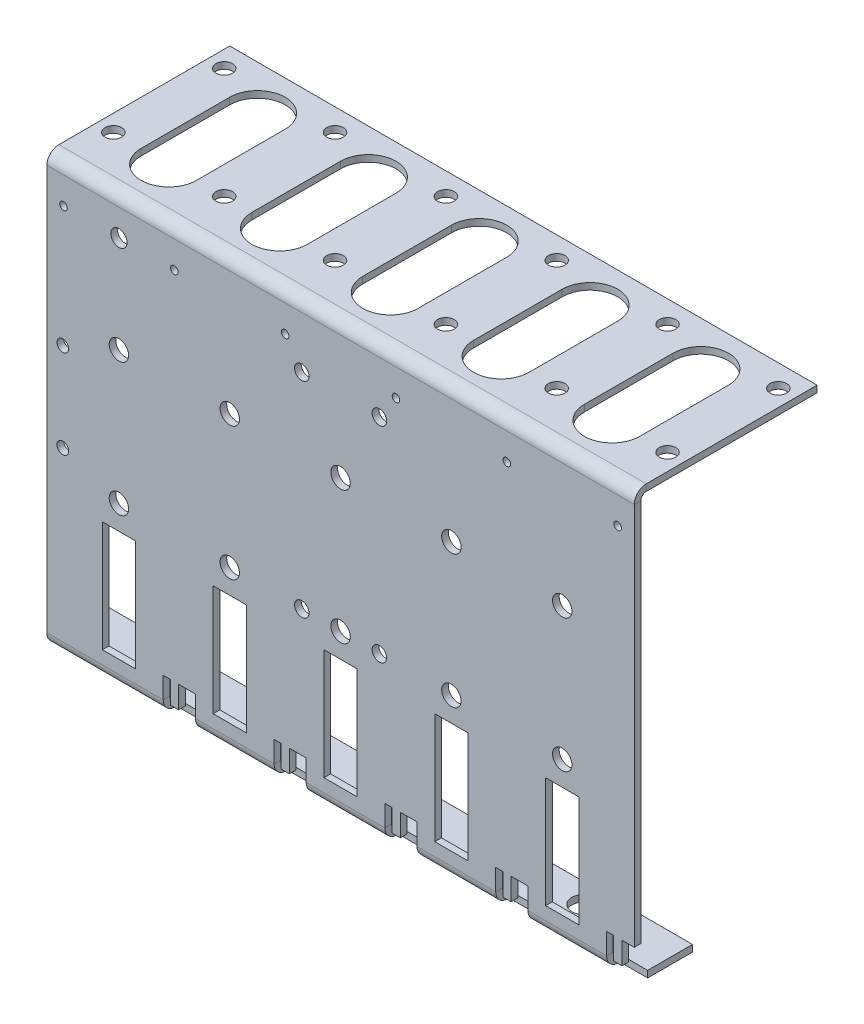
ISO-10303-21;
HEADER;
FILE_DESCRIPTION(('STEP AP214'),'2;1');
FILE_NAME('part.step','',(''),(''),'','','');
FILE_SCHEMA(('AUTOMOTIVE_DESIGN { 1 0 10303 214 1 1 1 1 }'));
ENDSEC;
DATA;
#1=APPLICATION_CONTEXT('core data for automotive mechanical design processes');
#2=APPLICATION_PROTOCOL_DEFINITION('international standard','automotive_design',2000,#1);
#3=PRODUCT_CONTEXT('',#1,'mechanical');
#4=PRODUCT('Part','Part','',(#3));
#5=PRODUCT_RELATED_PRODUCT_CATEGORY('part','',(#4));
#6=PRODUCT_DEFINITION_FORMATION('','',#4);
#7=PRODUCT_DEFINITION_CONTEXT('part definition',#1,'design');
#8=PRODUCT_DEFINITION('design','',#6,#7);
#9=PRODUCT_DEFINITION_SHAPE('','',#8);
#10=(LENGTH_UNIT() NAMED_UNIT(*) SI_UNIT(.MILLI.,.METRE.));
#11=(NAMED_UNIT(*) PLANE_ANGLE_UNIT() SI_UNIT($,.RADIAN.));
#12=(NAMED_UNIT(*) SI_UNIT($,.STERADIAN.) SOLID_ANGLE_UNIT());
#13=UNCERTAINTY_MEASURE_WITH_UNIT(LENGTH_MEASURE(1.E-05),#10,'distance_accuracy_value','');
#14=(GEOMETRIC_REPRESENTATION_CONTEXT(3) GLOBAL_UNCERTAINTY_ASSIGNED_CONTEXT((#13)) GLOBAL_UNIT_ASSIGNED_CONTEXT((#10,
#11,#12)) REPRESENTATION_CONTEXT('',''));
#15=CARTESIAN_POINT('',(0.,0.,0.));
#16=DIRECTION('',(0.,0.,1.));
#17=DIRECTION('',(1.,0.,0.));
#18=AXIS2_PLACEMENT_3D('',#15,#16,#17);
#19=CARTESIAN_POINT('',(-50.8,-111.379,-1.9304));
#20=DIRECTION('',(0.,1.,0.));
#21=DIRECTION('',(0.,0.,1.));
#22=AXIS2_PLACEMENT_3D('',#19,#20,#21);
#23=PLANE('',#22);
#24=DIRECTION('',(1.,0.,0.));
#25=VECTOR('',#24,1.);
#26=CARTESIAN_POINT('',(84.1375,-111.379,0.));
#27=LINE('',#26,#25);
#28=CARTESIAN_POINT('',(-50.8,-111.379,0.));
#29=VERTEX_POINT('',#28);
#30=CARTESIAN_POINT('',(-48.7553,-111.379,0.));
#31=VERTEX_POINT('',#30);
#32=EDGE_CURVE('E857',#29,#31,#27,.T.);
#33=ORIENTED_EDGE('',*,*,#32,.T.);
#34=DIRECTION('',(0.,0.,1.));
#35=VECTOR('',#34,1.);
#36=CARTESIAN_POINT('',(-48.7553,-111.379,0.));
#37=LINE('',#36,#35);
#38=CARTESIAN_POINT('',(-48.7553,-111.379,1.905));
#39=VERTEX_POINT('',#38);
#40=EDGE_CURVE('E725',#31,#39,#37,.T.);
#41=ORIENTED_EDGE('',*,*,#40,.T.);
#42=DIRECTION('',(-1.,0.,0.));
#43=VECTOR('',#42,1.);
#44=CARTESIAN_POINT('',(-50.8,-111.379,1.905));
#45=LINE('',#44,#43);
#46=CARTESIAN_POINT('',(-50.8,-111.379,1.905));
#47=VERTEX_POINT('',#46);
#48=EDGE_CURVE('E836',#39,#47,#45,.T.);
#49=ORIENTED_EDGE('',*,*,#48,.T.);
#50=DIRECTION('',(0.,0.,1.));
#51=VECTOR('',#50,1.);
#52=CARTESIAN_POINT('',(-50.8,-111.379,-1.9304));
#53=LINE('',#52,#51);
#54=EDGE_CURVE('E838',#29,#47,#53,.T.);
#55=ORIENTED_EDGE('',*,*,#54,.F.);
#56=EDGE_LOOP('',(#33,#41,#49,#55));
#57=FACE_BOUND('',#56,.T.);
#58=ADVANCED_FACE('F37',(#57),#23,.F.);
#59=CARTESIAN_POINT('',(76.2,-111.379,-1.9304));
#60=DIRECTION('',(0.,1.,0.));
#61=DIRECTION('',(0.,0.,1.));
#62=AXIS2_PLACEMENT_3D('',#59,#60,#61);
#63=PLANE('',#62);
#64=DIRECTION('',(1.,0.,0.));
#65=VECTOR('',#64,1.);
#66=CARTESIAN_POINT('',(84.1375,-111.379,0.));
#67=LINE('',#66,#65);
#68=CARTESIAN_POINT('',(76.2,-111.379,0.));
#69=VERTEX_POINT('',#68);
#70=CARTESIAN_POINT('',(78.2447,-111.379,0.));
#71=VERTEX_POINT('',#70);
#72=EDGE_CURVE('E899',#69,#71,#67,.T.);
#73=ORIENTED_EDGE('',*,*,#72,.T.);
#74=DIRECTION('',(0.,0.,1.));
#75=VECTOR('',#74,1.);
#76=CARTESIAN_POINT('',(78.2447,-111.379,0.));
#77=LINE('',#76,#75);
#78=CARTESIAN_POINT('',(78.2447,-111.379,1.905));
#79=VERTEX_POINT('',#78);
#80=EDGE_CURVE('E761',#71,#79,#77,.T.);
#81=ORIENTED_EDGE('',*,*,#80,.T.);
#82=DIRECTION('',(-1.,0.,0.));
#83=VECTOR('',#82,1.);
#84=CARTESIAN_POINT('',(76.2,-111.379,1.905));
#85=LINE('',#84,#83);
#86=CARTESIAN_POINT('',(76.2,-111.379,1.905));
#87=VERTEX_POINT('',#86);
#88=EDGE_CURVE('E883',#79,#87,#85,.T.);
#89=ORIENTED_EDGE('',*,*,#88,.T.);
#90=DIRECTION('',(0.,0.,1.));
#91=VECTOR('',#90,1.);
#92=CARTESIAN_POINT('',(76.2,-111.379,-1.9304));
#93=LINE('',#92,#91);
#94=EDGE_CURVE('E879',#69,#87,#93,.T.);
#95=ORIENTED_EDGE('',*,*,#94,.F.);
#96=EDGE_LOOP('',(#73,#81,#89,#95));
#97=FACE_BOUND('',#96,.T.);
#98=ADVANCED_FACE('F1965',(#97),#63,.F.);
#99=CARTESIAN_POINT('',(44.45,-111.379,-1.9304));
#100=DIRECTION('',(0.,1.,0.));
#101=DIRECTION('',(0.,0.,1.));
#102=AXIS2_PLACEMENT_3D('',#99,#100,#101);
#103=PLANE('',#102);
#104=DIRECTION('',(1.,0.,0.));
#105=VECTOR('',#104,1.);
#106=CARTESIAN_POINT('',(84.1375,-111.379,0.));
#107=LINE('',#106,#105);
#108=CARTESIAN_POINT('',(44.45,-111.379,0.));
#109=VERTEX_POINT('',#108);
#110=CARTESIAN_POINT('',(46.4947,-111.379,0.));
#111=VERTEX_POINT('',#110);
#112=EDGE_CURVE('E951',#109,#111,#107,.T.);
#113=ORIENTED_EDGE('',*,*,#112,.T.);
#114=DIRECTION('',(0.,0.,1.));
#115=VECTOR('',#114,1.);
#116=CARTESIAN_POINT('',(46.4947,-111.379,0.));
#117=LINE('',#116,#115);
#118=CARTESIAN_POINT('',(46.4947,-111.379,1.905));
#119=VERTEX_POINT('',#118);
#120=EDGE_CURVE('E789',#111,#119,#117,.T.);
#121=ORIENTED_EDGE('',*,*,#120,.T.);
#122=DIRECTION('',(-1.,0.,0.));
#123=VECTOR('',#122,1.);
#124=CARTESIAN_POINT('',(44.45,-111.379,1.905));
#125=LINE('',#124,#123);
#126=CARTESIAN_POINT('',(44.45,-111.379,1.905));
#127=VERTEX_POINT('',#126);
#128=EDGE_CURVE('E922',#119,#127,#125,.T.);
#129=ORIENTED_EDGE('',*,*,#128,.T.);
#130=DIRECTION('',(0.,0.,1.));
#131=VECTOR('',#130,1.);
#132=CARTESIAN_POINT('',(44.45,-111.379,-1.9304));
#133=LINE('',#132,#131);
#134=EDGE_CURVE('E924',#109,#127,#133,.T.);
#135=ORIENTED_EDGE('',*,*,#134,.F.);
#136=EDGE_LOOP('',(#113,#121,#129,#135));
#137=FACE_BOUND('',#136,.T.);
#138=ADVANCED_FACE('F1963',(#137),#103,.F.);
#139=CARTESIAN_POINT('',(12.7,-111.379,-1.9304));
#140=DIRECTION('',(0.,1.,0.));
#141=DIRECTION('',(0.,0.,1.));
#142=AXIS2_PLACEMENT_3D('',#139,#140,#141);
#143=PLANE('',#142);
#144=DIRECTION('',(1.,0.,0.));
#145=VECTOR('',#144,1.);
#146=CARTESIAN_POINT('',(84.1375,-111.379,0.));
#147=LINE('',#146,#145);
#148=CARTESIAN_POINT('',(12.7,-111.379,0.));
#149=VERTEX_POINT('',#148);
#150=CARTESIAN_POINT('',(14.7447,-111.379,0.));
#151=VERTEX_POINT('',#150);
#152=EDGE_CURVE('E998',#149,#151,#147,.T.);
#153=ORIENTED_EDGE('',*,*,#152,.T.);
#154=DIRECTION('',(0.,0.,1.));
#155=VECTOR('',#154,1.);
#156=CARTESIAN_POINT('',(14.7447,-111.379,0.));
#157=LINE('',#156,#155);
#158=CARTESIAN_POINT('',(14.7447,-111.379,1.905));
#159=VERTEX_POINT('',#158);
#160=EDGE_CURVE('E817',#151,#159,#157,.T.);
#161=ORIENTED_EDGE('',*,*,#160,.T.);
#162=DIRECTION('',(-1.,0.,0.));
#163=VECTOR('',#162,1.);
#164=CARTESIAN_POINT('',(12.7,-111.379,1.905));
#165=LINE('',#164,#163);
#166=CARTESIAN_POINT('',(12.7,-111.379,1.905));
#167=VERTEX_POINT('',#166);
#168=EDGE_CURVE('E969',#159,#167,#165,.T.);
#169=ORIENTED_EDGE('',*,*,#168,.T.);
#170=DIRECTION('',(0.,0.,1.));
#171=VECTOR('',#170,1.);
#172=CARTESIAN_POINT('',(12.7,-111.379,-1.9304));
#173=LINE('',#172,#171);
#174=EDGE_CURVE('E971',#149,#167,#173,.T.);
#175=ORIENTED_EDGE('',*,*,#174,.F.);
#176=EDGE_LOOP('',(#153,#161,#169,#175));
#177=FACE_BOUND('',#176,.T.);
#178=ADVANCED_FACE('F1931',(#177),#143,.F.);
#179=CARTESIAN_POINT('',(-41.5925,-111.379,-1.9304));
#180=DIRECTION('',(1.,0.,0.));
#181=DIRECTION('',(0.,1.,0.));
#182=AXIS2_PLACEMENT_3D('',#179,#180,#181);
#183=PLANE('',#182);
#184=DIRECTION('',(0.,0.,-1.));
#185=VECTOR('',#184,1.);
#186=CARTESIAN_POINT('',(-41.5925,-120.904,0.));
#187=LINE('',#186,#185);
#188=CARTESIAN_POINT('',(-41.5925,-120.904,-1.52400000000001));
#189=VERTEX_POINT('',#188);
#190=CARTESIAN_POINT('',(-41.5925,-120.904,-1.9304));
#191=VERTEX_POINT('',#190);
#192=EDGE_CURVE('E850',#189,#191,#187,.T.);
#193=ORIENTED_EDGE('',*,*,#192,.F.);
#194=DIRECTION('',(0.,1.,0.));
#195=VECTOR('',#194,1.);
#196=CARTESIAN_POINT('',(-41.5925,-120.904,-1.52400000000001));
#197=LINE('',#196,#195);
#198=CARTESIAN_POINT('',(-41.5925,-118.999,-1.52400000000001));
#199=VERTEX_POINT('',#198);
#200=EDGE_CURVE('E11',#189,#199,#197,.T.);
#201=ORIENTED_EDGE('',*,*,#200,.T.);
#202=DIRECTION('',(0.,0.,-1.));
#203=VECTOR('',#202,1.);
#204=CARTESIAN_POINT('',(-41.5925,-118.999,0.));
#205=LINE('',#204,#203);
#206=CARTESIAN_POINT('',(-41.5925,-118.999,-1.9304));
#207=VERTEX_POINT('',#206);
#208=EDGE_CURVE('E848',#199,#207,#205,.T.);
#209=ORIENTED_EDGE('',*,*,#208,.T.);
#210=DIRECTION('',(0.,1.,0.));
#211=VECTOR('',#210,1.);
#212=CARTESIAN_POINT('',(-41.5925,-111.379,-1.9304));
#213=LINE('',#212,#211);
#214=EDGE_CURVE('E830',#191,#207,#213,.T.);
#215=ORIENTED_EDGE('',*,*,#214,.F.);
#216=EDGE_LOOP('',(#193,#201,#209,#215));
#217=FACE_BOUND('',#216,.T.);
#218=ADVANCED_FACE('F1962',(#217),#183,.F.);
#219=DIRECTION('',(0.,-1.,0.));
#220=VECTOR('',#219,1.);
#221=CARTESIAN_POINT('',(-41.5925,0.,0.));
#222=LINE('',#221,#220);
#223=CARTESIAN_POINT('',(-41.5925,-111.379,0.));
#224=VERTEX_POINT('',#223);
#225=CARTESIAN_POINT('',(-41.5925,-117.475,0.));
#226=VERTEX_POINT('',#225);
#227=EDGE_CURVE('E841',#224,#226,#222,.T.);
#228=ORIENTED_EDGE('',*,*,#227,.T.);
#229=DIRECTION('',(0.,0.,1.));
#230=VECTOR('',#229,1.);
#231=CARTESIAN_POINT('',(-41.5925,-117.475,0.));
#232=LINE('',#231,#230);
#233=CARTESIAN_POINT('',(-41.5925,-117.475,1.90499999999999));
#234=VERTEX_POINT('',#233);
#235=EDGE_CURVE('E45',#226,#234,#232,.T.);
#236=ORIENTED_EDGE('',*,*,#235,.T.);
#237=DIRECTION('',(0.,-1.,0.));
#238=VECTOR('',#237,1.);
#239=CARTESIAN_POINT('',(-41.5925,0.,1.905));
#240=LINE('',#239,#238);
#241=CARTESIAN_POINT('',(-41.5925,-111.379,1.905));
#242=VERTEX_POINT('',#241);
#243=EDGE_CURVE('E1763',#242,#234,#240,.T.);
#244=ORIENTED_EDGE('',*,*,#243,.F.);
#245=DIRECTION('',(0.,0.,1.));
#246=VECTOR('',#245,1.);
#247=CARTESIAN_POINT('',(-41.5925,-111.379,-1.9304));
#248=LINE('',#247,#246);
#249=EDGE_CURVE('E833',#224,#242,#248,.T.);
#250=ORIENTED_EDGE('',*,*,#249,.F.);
#251=EDGE_LOOP('',(#228,#236,#244,#250));
#252=FACE_BOUND('',#251,.T.);
#253=ADVANCED_FACE('F1795',(#252),#183,.F.);
#254=CARTESIAN_POINT('',(-50.8,-111.379,-1.9304));
#255=DIRECTION('',(-1.,0.,0.));
#256=DIRECTION('',(0.,-1.,0.));
#257=AXIS2_PLACEMENT_3D('',#254,#255,#256);
#258=PLANE('',#257);
#259=DIRECTION('',(0.,-1.,0.));
#260=VECTOR('',#259,1.);
#261=CARTESIAN_POINT('',(-50.8,-111.379,1.905));
#262=LINE('',#261,#260);
#263=CARTESIAN_POINT('',(-50.8,-117.475,1.905));
#264=VERTEX_POINT('',#263);
#265=EDGE_CURVE('E820',#47,#264,#262,.T.);
#266=ORIENTED_EDGE('',*,*,#265,.T.);
#267=DIRECTION('',(0.,0.,-1.));
#268=VECTOR('',#267,1.);
#269=CARTESIAN_POINT('',(-50.8,-117.475,1.905));
#270=LINE('',#269,#268);
#271=CARTESIAN_POINT('',(-50.8,-117.475,0.));
#272=VERTEX_POINT('',#271);
#273=EDGE_CURVE('E1791',#264,#272,#270,.T.);
#274=ORIENTED_EDGE('',*,*,#273,.T.);
#275=DIRECTION('',(0.,1.,0.));
#276=VECTOR('',#275,1.);
#277=CARTESIAN_POINT('',(-50.8,0.,0.));
#278=LINE('',#277,#276);
#279=EDGE_CURVE('E859',#272,#29,#278,.T.);
#280=ORIENTED_EDGE('',*,*,#279,.T.);
#281=ORIENTED_EDGE('',*,*,#54,.T.);
#282=EDGE_LOOP('',(#266,#274,#280,#281));
#283=FACE_BOUND('',#282,.T.);
#284=ADVANCED_FACE('F1990',(#283),#258,.F.);
#285=DIRECTION('',(0.,0.,1.));
#286=VECTOR('',#285,1.);
#287=CARTESIAN_POINT('',(-50.8,-118.999,0.));
#288=LINE('',#287,#286);
#289=CARTESIAN_POINT('',(-50.8,-118.999,-1.9304));
#290=VERTEX_POINT('',#289);
#291=CARTESIAN_POINT('',(-50.8,-118.999,-1.52400000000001));
#292=VERTEX_POINT('',#291);
#293=EDGE_CURVE('E864',#290,#292,#288,.T.);
#294=ORIENTED_EDGE('',*,*,#293,.T.);
#295=DIRECTION('',(0.,-1.,0.));
#296=VECTOR('',#295,1.);
#297=CARTESIAN_POINT('',(-50.8,-118.999,-1.52400000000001));
#298=LINE('',#297,#296);
#299=CARTESIAN_POINT('',(-50.8,-120.904,-1.52400000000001));
#300=VERTEX_POINT('',#299);
#301=EDGE_CURVE('E1789',#292,#300,#298,.T.);
#302=ORIENTED_EDGE('',*,*,#301,.T.);
#303=DIRECTION('',(0.,0.,1.));
#304=VECTOR('',#303,1.);
#305=CARTESIAN_POINT('',(-50.8,-120.904,0.));
#306=LINE('',#305,#304);
#307=CARTESIAN_POINT('',(-50.8,-120.904,-1.9304));
#308=VERTEX_POINT('',#307);
#309=EDGE_CURVE('E867',#308,#300,#306,.T.);
#310=ORIENTED_EDGE('',*,*,#309,.F.);
#311=DIRECTION('',(0.,-1.,0.));
#312=VECTOR('',#311,1.);
#313=CARTESIAN_POINT('',(-50.8,-111.379,-1.9304));
#314=LINE('',#313,#312);
#315=EDGE_CURVE('E827',#290,#308,#314,.T.);
#316=ORIENTED_EDGE('',*,*,#315,.F.);
#317=EDGE_LOOP('',(#294,#302,#310,#316));
#318=FACE_BOUND('',#317,.T.);
#319=ADVANCED_FACE('F1991',(#318),#258,.F.);
#320=CARTESIAN_POINT('',(76.2,-111.379,-1.9304));
#321=DIRECTION('',(-1.,0.,0.));
#322=DIRECTION('',(0.,-1.,0.));
#323=AXIS2_PLACEMENT_3D('',#320,#321,#322);
#324=PLANE('',#323);
#325=DIRECTION('',(0.,-1.,0.));
#326=VECTOR('',#325,1.);
#327=CARTESIAN_POINT('',(76.2,-111.379,1.905));
#328=LINE('',#327,#326);
#329=CARTESIAN_POINT('',(76.2,-117.475,1.90499999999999));
#330=VERTEX_POINT('',#329);
#331=EDGE_CURVE('E875',#87,#330,#328,.T.);
#332=ORIENTED_EDGE('',*,*,#331,.T.);
#333=DIRECTION('',(0.,0.,-1.));
#334=VECTOR('',#333,1.);
#335=CARTESIAN_POINT('',(76.2,-117.475,1.90499999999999));
#336=LINE('',#335,#334);
#337=CARTESIAN_POINT('',(76.2,-117.475,0.));
#338=VERTEX_POINT('',#337);
#339=EDGE_CURVE('E1787',#330,#338,#336,.T.);
#340=ORIENTED_EDGE('',*,*,#339,.T.);
#341=DIRECTION('',(0.,1.,0.));
#342=VECTOR('',#341,1.);
#343=CARTESIAN_POINT('',(76.2,0.,0.));
#344=LINE('',#343,#342);
#345=EDGE_CURVE('E890',#338,#69,#344,.T.);
#346=ORIENTED_EDGE('',*,*,#345,.T.);
#347=ORIENTED_EDGE('',*,*,#94,.T.);
#348=EDGE_LOOP('',(#332,#340,#346,#347));
#349=FACE_BOUND('',#348,.T.);
#350=ADVANCED_FACE('F2002',(#349),#324,.F.);
#351=DIRECTION('',(0.,0.,1.));
#352=VECTOR('',#351,1.);
#353=CARTESIAN_POINT('',(76.2,-118.999,0.));
#354=LINE('',#353,#352);
#355=CARTESIAN_POINT('',(76.2,-118.999,-1.9304));
#356=VERTEX_POINT('',#355);
#357=CARTESIAN_POINT('',(76.2,-118.999,-1.52400000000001));
#358=VERTEX_POINT('',#357);
#359=EDGE_CURVE('E895',#356,#358,#354,.T.);
#360=ORIENTED_EDGE('',*,*,#359,.T.);
#361=DIRECTION('',(0.,-1.,0.));
#362=VECTOR('',#361,1.);
#363=CARTESIAN_POINT('',(76.2,-118.999,-1.52400000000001));
#364=LINE('',#363,#362);
#365=CARTESIAN_POINT('',(76.2,-120.904,-1.52400000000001));
#366=VERTEX_POINT('',#365);
#367=EDGE_CURVE('E1785',#358,#366,#364,.T.);
#368=ORIENTED_EDGE('',*,*,#367,.T.);
#369=DIRECTION('',(0.,0.,1.));
#370=VECTOR('',#369,1.);
#371=CARTESIAN_POINT('',(76.2,-120.904,0.));
#372=LINE('',#371,#370);
#373=CARTESIAN_POINT('',(76.2,-120.904,-1.9304));
#374=VERTEX_POINT('',#373);
#375=EDGE_CURVE('E887',#374,#366,#372,.T.);
#376=ORIENTED_EDGE('',*,*,#375,.F.);
#377=DIRECTION('',(0.,-1.,0.));
#378=VECTOR('',#377,1.);
#379=CARTESIAN_POINT('',(76.2,-111.379,-1.9304));
#380=LINE('',#379,#378);
#381=EDGE_CURVE('E876',#356,#374,#380,.T.);
#382=ORIENTED_EDGE('',*,*,#381,.F.);
#383=EDGE_LOOP('',(#360,#368,#376,#382));
#384=FACE_BOUND('',#383,.T.);
#385=ADVANCED_FACE('F2015',(#384),#324,.F.);
#386=CARTESIAN_POINT('',(53.6575,-111.379,-1.9304));
#387=DIRECTION('',(1.,0.,0.));
#388=DIRECTION('',(0.,1.,0.));
#389=AXIS2_PLACEMENT_3D('',#386,#387,#388);
#390=PLANE('',#389);
#391=DIRECTION('',(0.,-1.,0.));
#392=VECTOR('',#391,1.);
#393=CARTESIAN_POINT('',(53.6575,0.,0.));
#394=LINE('',#393,#392);
#395=CARTESIAN_POINT('',(53.6575,-111.379,0.));
#396=VERTEX_POINT('',#395);
#397=CARTESIAN_POINT('',(53.6575,-117.475,0.));
#398=VERTEX_POINT('',#397);
#399=EDGE_CURVE('E931',#396,#398,#394,.T.);
#400=ORIENTED_EDGE('',*,*,#399,.T.);
#401=DIRECTION('',(0.,0.,1.));
#402=VECTOR('',#401,1.);
#403=CARTESIAN_POINT('',(53.6575,-117.475,0.));
#404=LINE('',#403,#402);
#405=CARTESIAN_POINT('',(53.6575,-117.475,1.905));
#406=VERTEX_POINT('',#405);
#407=EDGE_CURVE('E1783',#398,#406,#404,.T.);
#408=ORIENTED_EDGE('',*,*,#407,.T.);
#409=DIRECTION('',(0.,1.,0.));
#410=VECTOR('',#409,1.);
#411=CARTESIAN_POINT('',(53.6575,-111.379,1.905));
#412=LINE('',#411,#410);
#413=CARTESIAN_POINT('',(53.6575,-111.379,1.905));
#414=VERTEX_POINT('',#413);
#415=EDGE_CURVE('E919',#406,#414,#412,.T.);
#416=ORIENTED_EDGE('',*,*,#415,.T.);
#417=DIRECTION('',(0.,0.,1.));
#418=VECTOR('',#417,1.);
#419=CARTESIAN_POINT('',(53.6575,-111.379,-1.9304));
#420=LINE('',#419,#418);
#421=EDGE_CURVE('E916',#396,#414,#420,.T.);
#422=ORIENTED_EDGE('',*,*,#421,.F.);
#423=EDGE_LOOP('',(#400,#408,#416,#422));
#424=FACE_BOUND('',#423,.T.);
#425=ADVANCED_FACE('F2024',(#424),#390,.F.);
#426=DIRECTION('',(0.,0.,-1.));
#427=VECTOR('',#426,1.);
#428=CARTESIAN_POINT('',(53.6575,-120.904,0.));
#429=LINE('',#428,#427);
#430=CARTESIAN_POINT('',(53.6575,-120.904,-1.52400000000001));
#431=VERTEX_POINT('',#430);
#432=CARTESIAN_POINT('',(53.6575,-120.904,-1.9304));
#433=VERTEX_POINT('',#432);
#434=EDGE_CURVE('E927',#431,#433,#429,.T.);
#435=ORIENTED_EDGE('',*,*,#434,.F.);
#436=DIRECTION('',(0.,1.,0.));
#437=VECTOR('',#436,1.);
#438=CARTESIAN_POINT('',(53.6575,-120.904,-1.52400000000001));
#439=LINE('',#438,#437);
#440=CARTESIAN_POINT('',(53.6575,-118.999,-1.52400000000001));
#441=VERTEX_POINT('',#440);
#442=EDGE_CURVE('E1781',#431,#441,#439,.T.);
#443=ORIENTED_EDGE('',*,*,#442,.T.);
#444=DIRECTION('',(0.,0.,-1.));
#445=VECTOR('',#444,1.);
#446=CARTESIAN_POINT('',(53.6575,-118.999,0.));
#447=LINE('',#446,#445);
#448=CARTESIAN_POINT('',(53.6575,-118.999,-1.9304));
#449=VERTEX_POINT('',#448);
#450=EDGE_CURVE('E937',#441,#449,#447,.T.);
#451=ORIENTED_EDGE('',*,*,#450,.T.);
#452=DIRECTION('',(0.,1.,0.));
#453=VECTOR('',#452,1.);
#454=CARTESIAN_POINT('',(53.6575,-111.379,-1.9304));
#455=LINE('',#454,#453);
#456=EDGE_CURVE('E912',#433,#449,#455,.T.);
#457=ORIENTED_EDGE('',*,*,#456,.F.);
#458=EDGE_LOOP('',(#435,#443,#451,#457));
#459=FACE_BOUND('',#458,.T.);
#460=ADVANCED_FACE('F2025',(#459),#390,.F.);
#461=CARTESIAN_POINT('',(44.45,-111.379,-1.9304));
#462=DIRECTION('',(-1.,0.,0.));
#463=DIRECTION('',(0.,-1.,0.));
#464=AXIS2_PLACEMENT_3D('',#461,#462,#463);
#465=PLANE('',#464);
#466=DIRECTION('',(0.,-1.,0.));
#467=VECTOR('',#466,1.);
#468=CARTESIAN_POINT('',(44.45,-111.379,1.905));
#469=LINE('',#468,#467);
#470=CARTESIAN_POINT('',(44.45,-117.475,1.905));
#471=VERTEX_POINT('',#470);
#472=EDGE_CURVE('E908',#127,#471,#469,.T.);
#473=ORIENTED_EDGE('',*,*,#472,.T.);
#474=DIRECTION('',(0.,0.,-1.));
#475=VECTOR('',#474,1.);
#476=CARTESIAN_POINT('',(44.45,-117.475,1.905));
#477=LINE('',#476,#475);
#478=CARTESIAN_POINT('',(44.45,-117.475,0.));
#479=VERTEX_POINT('',#478);
#480=EDGE_CURVE('E1779',#471,#479,#477,.T.);
#481=ORIENTED_EDGE('',*,*,#480,.T.);
#482=DIRECTION('',(0.,1.,0.));
#483=VECTOR('',#482,1.);
#484=CARTESIAN_POINT('',(44.45,0.,0.));
#485=LINE('',#484,#483);
#486=EDGE_CURVE('E942',#479,#109,#485,.T.);
#487=ORIENTED_EDGE('',*,*,#486,.T.);
#488=ORIENTED_EDGE('',*,*,#134,.T.);
#489=EDGE_LOOP('',(#473,#481,#487,#488));
#490=FACE_BOUND('',#489,.T.);
#491=ADVANCED_FACE('F2028',(#490),#465,.F.);
#492=DIRECTION('',(0.,0.,1.));
#493=VECTOR('',#492,1.);
#494=CARTESIAN_POINT('',(44.45,-118.999,0.));
#495=LINE('',#494,#493);
#496=CARTESIAN_POINT('',(44.45,-118.999,-1.9304));
#497=VERTEX_POINT('',#496);
#498=CARTESIAN_POINT('',(44.45,-118.999,-1.52400000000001));
#499=VERTEX_POINT('',#498);
#500=EDGE_CURVE('E947',#497,#499,#495,.T.);
#501=ORIENTED_EDGE('',*,*,#500,.T.);
#502=DIRECTION('',(0.,-1.,0.));
#503=VECTOR('',#502,1.);
#504=CARTESIAN_POINT('',(44.45,-118.999,-1.52400000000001));
#505=LINE('',#504,#503);
#506=CARTESIAN_POINT('',(44.45,-120.904,-1.52400000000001));
#507=VERTEX_POINT('',#506);
#508=EDGE_CURVE('E1777',#499,#507,#505,.T.);
#509=ORIENTED_EDGE('',*,*,#508,.T.);
#510=DIRECTION('',(0.,0.,1.));
#511=VECTOR('',#510,1.);
#512=CARTESIAN_POINT('',(44.45,-120.904,0.));
#513=LINE('',#512,#511);
#514=CARTESIAN_POINT('',(44.45,-120.904,-1.9304));
#515=VERTEX_POINT('',#514);
#516=EDGE_CURVE('E939',#515,#507,#513,.T.);
#517=ORIENTED_EDGE('',*,*,#516,.F.);
#518=DIRECTION('',(0.,-1.,0.));
#519=VECTOR('',#518,1.);
#520=CARTESIAN_POINT('',(44.45,-111.379,-1.9304));
#521=LINE('',#520,#519);
#522=EDGE_CURVE('E909',#497,#515,#521,.T.);
#523=ORIENTED_EDGE('',*,*,#522,.F.);
#524=EDGE_LOOP('',(#501,#509,#517,#523));
#525=FACE_BOUND('',#524,.T.);
#526=ADVANCED_FACE('F2029',(#525),#465,.F.);
#527=CARTESIAN_POINT('',(21.9075,-111.379,-1.9304));
#528=DIRECTION('',(1.,0.,0.));
#529=DIRECTION('',(0.,1.,0.));
#530=AXIS2_PLACEMENT_3D('',#527,#528,#529);
#531=PLANE('',#530);
#532=DIRECTION('',(0.,-1.,0.));
#533=VECTOR('',#532,1.);
#534=CARTESIAN_POINT('',(21.9075,0.,0.));
#535=LINE('',#534,#533);
#536=CARTESIAN_POINT('',(21.9075,-111.379,0.));
#537=VERTEX_POINT('',#536);
#538=CARTESIAN_POINT('',(21.9075,-117.475,0.));
#539=VERTEX_POINT('',#538);
#540=EDGE_CURVE('E978',#537,#539,#535,.T.);
#541=ORIENTED_EDGE('',*,*,#540,.T.);
#542=DIRECTION('',(0.,0.,1.));
#543=VECTOR('',#542,1.);
#544=CARTESIAN_POINT('',(21.9075,-117.475,0.));
#545=LINE('',#544,#543);
#546=CARTESIAN_POINT('',(21.9075,-117.475,1.905));
#547=VERTEX_POINT('',#546);
#548=EDGE_CURVE('E1775',#539,#547,#545,.T.);
#549=ORIENTED_EDGE('',*,*,#548,.T.);
#550=DIRECTION('',(0.,1.,0.));
#551=VECTOR('',#550,1.);
#552=CARTESIAN_POINT('',(21.9075,-111.379,1.905));
#553=LINE('',#552,#551);
#554=CARTESIAN_POINT('',(21.9075,-111.379,1.905));
#555=VERTEX_POINT('',#554);
#556=EDGE_CURVE('E966',#547,#555,#553,.T.);
#557=ORIENTED_EDGE('',*,*,#556,.T.);
#558=DIRECTION('',(0.,0.,1.));
#559=VECTOR('',#558,1.);
#560=CARTESIAN_POINT('',(21.9075,-111.379,-1.9304));
#561=LINE('',#560,#559);
#562=EDGE_CURVE('E963',#537,#555,#561,.T.);
#563=ORIENTED_EDGE('',*,*,#562,.F.);
#564=EDGE_LOOP('',(#541,#549,#557,#563));
#565=FACE_BOUND('',#564,.T.);
#566=ADVANCED_FACE('F1831',(#565),#531,.F.);
#567=DIRECTION('',(0.,0.,-1.));
#568=VECTOR('',#567,1.);
#569=CARTESIAN_POINT('',(21.9075,-120.904,0.));
#570=LINE('',#569,#568);
#571=CARTESIAN_POINT('',(21.9075,-120.904,-1.52400000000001));
#572=VERTEX_POINT('',#571);
#573=CARTESIAN_POINT('',(21.9075,-120.904,-1.9304));
#574=VERTEX_POINT('',#573);
#575=EDGE_CURVE('E974',#572,#574,#570,.T.);
#576=ORIENTED_EDGE('',*,*,#575,.F.);
#577=DIRECTION('',(0.,1.,0.));
#578=VECTOR('',#577,1.);
#579=CARTESIAN_POINT('',(21.9075,-120.904,-1.52400000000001));
#580=LINE('',#579,#578);
#581=CARTESIAN_POINT('',(21.9075,-118.999,-1.52400000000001));
#582=VERTEX_POINT('',#581);
#583=EDGE_CURVE('E1773',#572,#582,#580,.T.);
#584=ORIENTED_EDGE('',*,*,#583,.T.);
#585=DIRECTION('',(0.,0.,-1.));
#586=VECTOR('',#585,1.);
#587=CARTESIAN_POINT('',(21.9075,-118.999,0.));
#588=LINE('',#587,#586);
#589=CARTESIAN_POINT('',(21.9075,-118.999,-1.9304));
#590=VERTEX_POINT('',#589);
#591=EDGE_CURVE('E984',#582,#590,#588,.T.);
#592=ORIENTED_EDGE('',*,*,#591,.T.);
#593=DIRECTION('',(0.,1.,0.));
#594=VECTOR('',#593,1.);
#595=CARTESIAN_POINT('',(21.9075,-111.379,-1.9304));
#596=LINE('',#595,#594);
#597=EDGE_CURVE('E959',#574,#590,#596,.T.);
#598=ORIENTED_EDGE('',*,*,#597,.F.);
#599=EDGE_LOOP('',(#576,#584,#592,#598));
#600=FACE_BOUND('',#599,.T.);
#601=ADVANCED_FACE('F1851',(#600),#531,.F.);
#602=CARTESIAN_POINT('',(12.7,-111.379,-1.9304));
#603=DIRECTION('',(-1.,0.,0.));
#604=DIRECTION('',(0.,-1.,0.));
#605=AXIS2_PLACEMENT_3D('',#602,#603,#604);
#606=PLANE('',#605);
#607=DIRECTION('',(0.,-1.,0.));
#608=VECTOR('',#607,1.);
#609=CARTESIAN_POINT('',(12.7,-111.379,1.905));
#610=LINE('',#609,#608);
#611=CARTESIAN_POINT('',(12.7,-117.475,1.905));
#612=VERTEX_POINT('',#611);
#613=EDGE_CURVE('E955',#167,#612,#610,.T.);
#614=ORIENTED_EDGE('',*,*,#613,.T.);
#615=DIRECTION('',(0.,0.,-1.));
#616=VECTOR('',#615,1.);
#617=CARTESIAN_POINT('',(12.7,-117.475,1.905));
#618=LINE('',#617,#616);
#619=CARTESIAN_POINT('',(12.7,-117.475,0.));
#620=VERTEX_POINT('',#619);
#621=EDGE_CURVE('E1771',#612,#620,#618,.T.);
#622=ORIENTED_EDGE('',*,*,#621,.T.);
#623=DIRECTION('',(0.,1.,0.));
#624=VECTOR('',#623,1.);
#625=CARTESIAN_POINT('',(12.7,0.,0.));
#626=LINE('',#625,#624);
#627=EDGE_CURVE('E989',#620,#149,#626,.T.);
#628=ORIENTED_EDGE('',*,*,#627,.T.);
#629=ORIENTED_EDGE('',*,*,#174,.T.);
#630=EDGE_LOOP('',(#614,#622,#628,#629));
#631=FACE_BOUND('',#630,.T.);
#632=ADVANCED_FACE('F1926',(#631),#606,.F.);
#633=DIRECTION('',(0.,0.,1.));
#634=VECTOR('',#633,1.);
#635=CARTESIAN_POINT('',(12.7,-118.999,0.));
#636=LINE('',#635,#634);
#637=CARTESIAN_POINT('',(12.7,-118.999,-1.9304));
#638=VERTEX_POINT('',#637);
#639=CARTESIAN_POINT('',(12.7,-118.999,-1.52400000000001));
#640=VERTEX_POINT('',#639);
#641=EDGE_CURVE('E994',#638,#640,#636,.T.);
#642=ORIENTED_EDGE('',*,*,#641,.T.);
#643=DIRECTION('',(0.,-1.,0.));
#644=VECTOR('',#643,1.);
#645=CARTESIAN_POINT('',(12.7,-118.999,-1.52400000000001));
#646=LINE('',#645,#644);
#647=CARTESIAN_POINT('',(12.7,-120.904,-1.52400000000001));
#648=VERTEX_POINT('',#647);
#649=EDGE_CURVE('E1769',#640,#648,#646,.T.);
#650=ORIENTED_EDGE('',*,*,#649,.T.);
#651=DIRECTION('',(0.,0.,1.));
#652=VECTOR('',#651,1.);
#653=CARTESIAN_POINT('',(12.7,-120.904,0.));
#654=LINE('',#653,#652);
#655=CARTESIAN_POINT('',(12.7,-120.904,-1.9304));
#656=VERTEX_POINT('',#655);
#657=EDGE_CURVE('E986',#656,#648,#654,.T.);
#658=ORIENTED_EDGE('',*,*,#657,.F.);
#659=DIRECTION('',(0.,-1.,0.));
#660=VECTOR('',#659,1.);
#661=CARTESIAN_POINT('',(12.7,-111.379,-1.9304));
#662=LINE('',#661,#660);
#663=EDGE_CURVE('E956',#638,#656,#662,.T.);
#664=ORIENTED_EDGE('',*,*,#663,.F.);
#665=EDGE_LOOP('',(#642,#650,#658,#664));
#666=FACE_BOUND('',#665,.T.);
#667=ADVANCED_FACE('F2038',(#666),#606,.F.);
#668=CARTESIAN_POINT('',(84.1375,-117.475,-1.52400000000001));
#669=DIRECTION('',(-1.,0.,0.));
#670=DIRECTION('',(0.,0.,1.));
#671=AXIS2_PLACEMENT_3D('',#668,#669,#670);
#672=CYLINDRICAL_SURFACE('',#671,1.524);
#673=CARTESIAN_POINT('',(-50.8,-117.475,-1.52400000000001));
#674=DIRECTION('',(-1.,0.,0.));
#675=DIRECTION('',(0.,-1.,0.));
#676=AXIS2_PLACEMENT_3D('',#673,#674,#675);
#677=CIRCLE('',#676,1.524);
#678=EDGE_CURVE('E861',#292,#272,#677,.T.);
#679=ORIENTED_EDGE('',*,*,#678,.F.);
#680=DIRECTION('',(-1.,0.,0.));
#681=VECTOR('',#680,1.);
#682=CARTESIAN_POINT('',(84.1375,-118.999,-1.52400000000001));
#683=LINE('',#682,#681);
#684=CARTESIAN_POINT('',(-84.1375,-118.999,-1.52400000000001));
#685=VERTEX_POINT('',#684);
#686=EDGE_CURVE('E1694',#292,#685,#683,.T.);
#687=ORIENTED_EDGE('',*,*,#686,.T.);
#688=CARTESIAN_POINT('',(-84.1375,-117.475,-1.52400000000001));
#689=DIRECTION('',(-1.,0.,0.));
#690=DIRECTION('',(0.,0.,1.));
#691=AXIS2_PLACEMENT_3D('',#688,#689,#690);
#692=CIRCLE('',#691,1.524);
#693=CARTESIAN_POINT('',(-84.1375,-117.475,0.));
#694=VERTEX_POINT('',#693);
#695=EDGE_CURVE('E1637',#694,#685,#692,.F.);
#696=ORIENTED_EDGE('',*,*,#695,.F.);
#697=DIRECTION('',(-1.,0.,0.));
#698=VECTOR('',#697,1.);
#699=CARTESIAN_POINT('',(84.1375,-117.475,0.));
#700=LINE('',#699,#698);
#701=EDGE_CURVE('E1690',#272,#694,#700,.T.);
#702=ORIENTED_EDGE('',*,*,#701,.F.);
#703=EDGE_LOOP('',(#679,#687,#696,#702));
#704=FACE_BOUND('',#703,.T.);
#705=ADVANCED_FACE('F2404',(#704),#672,.F.);
#706=CARTESIAN_POINT('',(84.1375,-117.475,-1.52400000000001));
#707=DIRECTION('',(-1.,0.,0.));
#708=DIRECTION('',(0.,0.,1.));
#709=AXIS2_PLACEMENT_3D('',#706,#707,#708);
#710=CYLINDRICAL_SURFACE('',#709,3.429);
#711=DIRECTION('',(-1.,0.,0.));
#712=VECTOR('',#711,1.);
#713=CARTESIAN_POINT('',(84.1375,-120.904,-1.52400000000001));
#714=LINE('',#713,#712);
#715=CARTESIAN_POINT('',(-84.1375,-120.904,-1.52400000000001));
#716=VERTEX_POINT('',#715);
#717=EDGE_CURVE('E1628',#300,#716,#714,.T.);
#718=ORIENTED_EDGE('',*,*,#717,.F.);
#719=CARTESIAN_POINT('',(-50.8,-117.475,-1.52400000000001));
#720=DIRECTION('',(-1.,0.,0.));
#721=DIRECTION('',(0.,-1.,0.));
#722=AXIS2_PLACEMENT_3D('',#719,#720,#721);
#723=CIRCLE('',#722,3.429);
#724=EDGE_CURVE('E870',#300,#264,#723,.T.);
#725=ORIENTED_EDGE('',*,*,#724,.T.);
#726=DIRECTION('',(-1.,0.,0.));
#727=VECTOR('',#726,1.);
#728=CARTESIAN_POINT('',(84.1375,-117.475,1.90499999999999));
#729=LINE('',#728,#727);
#730=CARTESIAN_POINT('',(-84.1375,-117.475,1.90499999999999));
#731=VERTEX_POINT('',#730);
#732=EDGE_CURVE('E1666',#264,#731,#729,.T.);
#733=ORIENTED_EDGE('',*,*,#732,.T.);
#734=CARTESIAN_POINT('',(-84.1375,-117.475,-1.52400000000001));
#735=DIRECTION('',(1.,0.,0.));
#736=DIRECTION('',(0.,0.,-1.));
#737=AXIS2_PLACEMENT_3D('',#734,#735,#736);
#738=CIRCLE('',#737,3.429);
#739=EDGE_CURVE('E1602',#731,#716,#738,.T.);
#740=ORIENTED_EDGE('',*,*,#739,.T.);
#741=EDGE_LOOP('',(#718,#725,#733,#740));
#742=FACE_BOUND('',#741,.T.);
#743=ADVANCED_FACE('F2373',(#742),#710,.T.);
#744=CARTESIAN_POINT('',(84.1375,-117.475,1.90499999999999));
#745=DIRECTION('',(1.,0.,0.));
#746=DIRECTION('',(0.,0.,-1.));
#747=AXIS2_PLACEMENT_3D('',#744,#745,#746);
#748=PLANE('',#747);
#749=DIRECTION('',(0.,0.,-1.));
#750=VECTOR('',#749,1.);
#751=CARTESIAN_POINT('',(84.1375,-118.999,0.));
#752=LINE('',#751,#750);
#753=CARTESIAN_POINT('',(84.1375,-118.999,-1.9304));
#754=VERTEX_POINT('',#753);
#755=CARTESIAN_POINT('',(84.1375,-118.999,-14.7828));
#756=VERTEX_POINT('',#755);
#757=EDGE_CURVE('E1605',#754,#756,#752,.T.);
#758=ORIENTED_EDGE('',*,*,#757,.F.);
#759=DIRECTION('',(0.,-1.,0.));
#760=VECTOR('',#759,1.);
#761=CARTESIAN_POINT('',(84.1375,-117.475,-1.9304));
#762=LINE('',#761,#760);
#763=CARTESIAN_POINT('',(84.1375,-120.904,-1.9304));
#764=VERTEX_POINT('',#763);
#765=EDGE_CURVE('E903',#754,#764,#762,.T.);
#766=ORIENTED_EDGE('',*,*,#765,.T.);
#767=DIRECTION('',(0.,0.,-1.));
#768=VECTOR('',#767,1.);
#769=CARTESIAN_POINT('',(84.1375,-120.904,0.));
#770=LINE('',#769,#768);
#771=CARTESIAN_POINT('',(84.1375,-120.904,-14.7828));
#772=VERTEX_POINT('',#771);
#773=EDGE_CURVE('E1599',#764,#772,#770,.T.);
#774=ORIENTED_EDGE('',*,*,#773,.T.);
#775=DIRECTION('',(0.,-1.,0.));
#776=VECTOR('',#775,1.);
#777=CARTESIAN_POINT('',(84.1375,-118.999,-14.7828));
#778=LINE('',#777,#776);
#779=EDGE_CURVE('E1601',#756,#772,#778,.T.);
#780=ORIENTED_EDGE('',*,*,#779,.F.);
#781=EDGE_LOOP('',(#758,#766,#774,#780));
#782=FACE_BOUND('',#781,.T.);
#783=ADVANCED_FACE('F2423',(#782),#748,.T.);
#784=CARTESIAN_POINT('',(44.45,-117.475,-1.52400000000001));
#785=DIRECTION('',(-1.,0.,0.));
#786=DIRECTION('',(0.,-1.,0.));
#787=AXIS2_PLACEMENT_3D('',#784,#785,#786);
#788=CIRCLE('',#787,1.524);
#789=EDGE_CURVE('E944',#499,#479,#788,.T.);
#790=ORIENTED_EDGE('',*,*,#789,.F.);
#791=EDGE_CURVE('E1701',#499,#582,#683,.T.);
#792=ORIENTED_EDGE('',*,*,#791,.T.);
#793=CARTESIAN_POINT('',(21.9075,-117.475,-1.52400000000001));
#794=DIRECTION('',(1.,0.,0.));
#795=DIRECTION('',(0.,1.,0.));
#796=AXIS2_PLACEMENT_3D('',#793,#794,#795);
#797=CIRCLE('',#796,1.524);
#798=EDGE_CURVE('E981',#539,#582,#797,.T.);
#799=ORIENTED_EDGE('',*,*,#798,.F.);
#800=EDGE_CURVE('E1695',#479,#539,#700,.T.);
#801=ORIENTED_EDGE('',*,*,#800,.F.);
#802=EDGE_LOOP('',(#790,#792,#799,#801));
#803=FACE_BOUND('',#802,.T.);
#804=ADVANCED_FACE('F1839',(#803),#672,.F.);
#805=EDGE_CURVE('E1667',#507,#572,#714,.T.);
#806=ORIENTED_EDGE('',*,*,#805,.F.);
#807=CARTESIAN_POINT('',(44.45,-117.475,-1.52400000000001));
#808=DIRECTION('',(-1.,0.,0.));
#809=DIRECTION('',(0.,-1.,0.));
#810=AXIS2_PLACEMENT_3D('',#807,#808,#809);
#811=CIRCLE('',#810,3.429);
#812=EDGE_CURVE('E1751',#507,#471,#811,.T.);
#813=ORIENTED_EDGE('',*,*,#812,.T.);
#814=EDGE_CURVE('E1673',#471,#547,#729,.T.);
#815=ORIENTED_EDGE('',*,*,#814,.T.);
#816=CARTESIAN_POINT('',(21.9075,-117.475,-1.52400000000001));
#817=DIRECTION('',(1.,0.,0.));
#818=DIRECTION('',(0.,1.,0.));
#819=AXIS2_PLACEMENT_3D('',#816,#817,#818);
#820=CIRCLE('',#819,3.429);
#821=EDGE_CURVE('E1739',#547,#572,#820,.T.);
#822=ORIENTED_EDGE('',*,*,#821,.T.);
#823=EDGE_LOOP('',(#806,#813,#815,#822));
#824=FACE_BOUND('',#823,.T.);
#825=ADVANCED_FACE('F1820',(#824),#710,.T.);
#826=CARTESIAN_POINT('',(12.7,-117.475,-1.52400000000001));
#827=DIRECTION('',(-1.,0.,0.));
#828=DIRECTION('',(0.,-1.,0.));
#829=AXIS2_PLACEMENT_3D('',#826,#827,#828);
#830=CIRCLE('',#829,1.524);
#831=EDGE_CURVE('E991',#640,#620,#830,.T.);
#832=ORIENTED_EDGE('',*,*,#831,.F.);
#833=CARTESIAN_POINT('',(-9.84249999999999,-118.999,-1.52400000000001));
#834=VERTEX_POINT('',#833);
#835=EDGE_CURVE('E3932',#640,#834,#683,.T.);
#836=ORIENTED_EDGE('',*,*,#835,.T.);
#837=CARTESIAN_POINT('',(-9.84249999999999,-117.475,-1.52400000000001));
#838=DIRECTION('',(1.,0.,0.));
#839=DIRECTION('',(0.,1.,0.));
#840=AXIS2_PLACEMENT_3D('',#837,#838,#839);
#841=CIRCLE('',#840,1.524);
#842=CARTESIAN_POINT('',(-9.84249999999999,-117.475,0.));
#843=VERTEX_POINT('',#842);
#844=EDGE_CURVE('E1432',#843,#834,#841,.T.);
#845=ORIENTED_EDGE('',*,*,#844,.F.);
#846=EDGE_CURVE('E3931',#620,#843,#700,.T.);
#847=ORIENTED_EDGE('',*,*,#846,.F.);
#848=EDGE_LOOP('',(#832,#836,#845,#847));
#849=FACE_BOUND('',#848,.T.);
#850=ADVANCED_FACE('F2940',(#849),#672,.F.);
#851=CARTESIAN_POINT('',(-9.84249999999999,-120.904,-1.52400000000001));
#852=VERTEX_POINT('',#851);
#853=EDGE_CURVE('E1861',#648,#852,#714,.T.);
#854=ORIENTED_EDGE('',*,*,#853,.F.);
#855=CARTESIAN_POINT('',(12.7,-117.475,-1.52400000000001));
#856=DIRECTION('',(-1.,0.,0.));
#857=DIRECTION('',(0.,-1.,0.));
#858=AXIS2_PLACEMENT_3D('',#855,#856,#857);
#859=CIRCLE('',#858,3.429);
#860=EDGE_CURVE('E1742',#648,#612,#859,.T.);
#861=ORIENTED_EDGE('',*,*,#860,.T.);
#862=CARTESIAN_POINT('',(-9.84249999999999,-117.475,1.905));
#863=VERTEX_POINT('',#862);
#864=EDGE_CURVE('E1813',#612,#863,#729,.T.);
#865=ORIENTED_EDGE('',*,*,#864,.T.);
#866=CARTESIAN_POINT('',(-9.84249999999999,-117.475,-1.52400000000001));
#867=DIRECTION('',(1.,0.,0.));
#868=DIRECTION('',(0.,1.,0.));
#869=AXIS2_PLACEMENT_3D('',#866,#867,#868);
#870=CIRCLE('',#869,3.429);
#871=EDGE_CURVE('E1720',#863,#852,#870,.T.);
#872=ORIENTED_EDGE('',*,*,#871,.T.);
#873=EDGE_LOOP('',(#854,#861,#865,#872));
#874=FACE_BOUND('',#873,.T.);
#875=ADVANCED_FACE('F1922',(#874),#710,.T.);
#876=CARTESIAN_POINT('',(-19.05,-111.379,-1.9304));
#877=DIRECTION('',(0.,1.,0.));
#878=DIRECTION('',(0.,0.,1.));
#879=AXIS2_PLACEMENT_3D('',#876,#877,#878);
#880=PLANE('',#879);
#881=DIRECTION('',(1.,0.,0.));
#882=VECTOR('',#881,1.);
#883=CARTESIAN_POINT('',(84.1375,-111.379,0.));
#884=LINE('',#883,#882);
#885=CARTESIAN_POINT('',(-19.05,-111.379,0.));
#886=VERTEX_POINT('',#885);
#887=CARTESIAN_POINT('',(-17.0053,-111.379,0.));
#888=VERTEX_POINT('',#887);
#889=EDGE_CURVE('E1449',#886,#888,#884,.T.);
#890=ORIENTED_EDGE('',*,*,#889,.T.);
#891=DIRECTION('',(0.,0.,1.));
#892=VECTOR('',#891,1.);
#893=CARTESIAN_POINT('',(-17.0053,-111.379,0.));
#894=LINE('',#893,#892);
#895=CARTESIAN_POINT('',(-17.0053,-111.379,1.905));
#896=VERTEX_POINT('',#895);
#897=EDGE_CURVE('E1219',#888,#896,#894,.T.);
#898=ORIENTED_EDGE('',*,*,#897,.T.);
#899=DIRECTION('',(-1.,0.,0.));
#900=VECTOR('',#899,1.);
#901=CARTESIAN_POINT('',(-19.05,-111.379,1.905));
#902=LINE('',#901,#900);
#903=CARTESIAN_POINT('',(-19.05,-111.379,1.905));
#904=VERTEX_POINT('',#903);
#905=EDGE_CURVE('E1420',#896,#904,#902,.T.);
#906=ORIENTED_EDGE('',*,*,#905,.T.);
#907=DIRECTION('',(0.,0.,1.));
#908=VECTOR('',#907,1.);
#909=CARTESIAN_POINT('',(-19.05,-111.379,-1.9304));
#910=LINE('',#909,#908);
#911=EDGE_CURVE('E1422',#886,#904,#910,.T.);
#912=ORIENTED_EDGE('',*,*,#911,.F.);
#913=EDGE_LOOP('',(#890,#898,#906,#912));
#914=FACE_BOUND('',#913,.T.);
#915=ADVANCED_FACE('F1891',(#914),#880,.F.);
#916=CARTESIAN_POINT('',(-9.84249999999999,-111.379,-1.9304));
#917=DIRECTION('',(1.,0.,0.));
#918=DIRECTION('',(0.,1.,0.));
#919=AXIS2_PLACEMENT_3D('',#916,#917,#918);
#920=PLANE('',#919);
#921=DIRECTION('',(0.,-1.,0.));
#922=VECTOR('',#921,1.);
#923=CARTESIAN_POINT('',(-9.84250000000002,0.,0.));
#924=LINE('',#923,#922);
#925=CARTESIAN_POINT('',(-9.84249999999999,-111.379,0.));
#926=VERTEX_POINT('',#925);
#927=EDGE_CURVE('E1429',#926,#843,#924,.T.);
#928=ORIENTED_EDGE('',*,*,#927,.T.);
#929=DIRECTION('',(0.,0.,1.));
#930=VECTOR('',#929,1.);
#931=CARTESIAN_POINT('',(-9.84249999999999,-117.475,0.));
#932=LINE('',#931,#930);
#933=EDGE_CURVE('E1736',#843,#863,#932,.T.);
#934=ORIENTED_EDGE('',*,*,#933,.T.);
#935=DIRECTION('',(0.,1.,0.));
#936=VECTOR('',#935,1.);
#937=CARTESIAN_POINT('',(-9.84249999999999,-111.379,1.905));
#938=LINE('',#937,#936);
#939=CARTESIAN_POINT('',(-9.84249999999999,-111.379,1.905));
#940=VERTEX_POINT('',#939);
#941=EDGE_CURVE('E1417',#863,#940,#938,.T.);
#942=ORIENTED_EDGE('',*,*,#941,.T.);
#943=DIRECTION('',(0.,0.,1.));
#944=VECTOR('',#943,1.);
#945=CARTESIAN_POINT('',(-9.84249999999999,-111.379,-1.9304));
#946=LINE('',#945,#944);
#947=EDGE_CURVE('E1414',#926,#940,#946,.T.);
#948=ORIENTED_EDGE('',*,*,#947,.F.);
#949=EDGE_LOOP('',(#928,#934,#942,#948));
#950=FACE_BOUND('',#949,.T.);
#951=ADVANCED_FACE('F1913',(#950),#920,.F.);
#952=DIRECTION('',(0.,0.,-1.));
#953=VECTOR('',#952,1.);
#954=CARTESIAN_POINT('',(-9.84249999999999,-120.904,0.));
#955=LINE('',#954,#953);
#956=CARTESIAN_POINT('',(-9.84249999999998,-120.904,-1.9304));
#957=VERTEX_POINT('',#956);
#958=EDGE_CURVE('E1425',#852,#957,#955,.T.);
#959=ORIENTED_EDGE('',*,*,#958,.F.);
#960=DIRECTION('',(0.,1.,0.));
#961=VECTOR('',#960,1.);
#962=CARTESIAN_POINT('',(-9.84249999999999,-120.904,-1.52400000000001));
#963=LINE('',#962,#961);
#964=EDGE_CURVE('E1733',#852,#834,#963,.T.);
#965=ORIENTED_EDGE('',*,*,#964,.T.);
#966=DIRECTION('',(0.,0.,-1.));
#967=VECTOR('',#966,1.);
#968=CARTESIAN_POINT('',(-9.84249999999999,-118.999,0.));
#969=LINE('',#968,#967);
#970=CARTESIAN_POINT('',(-9.84249999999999,-118.999,-1.9304));
#971=VERTEX_POINT('',#970);
#972=EDGE_CURVE('E1435',#834,#971,#969,.T.);
#973=ORIENTED_EDGE('',*,*,#972,.T.);
#974=DIRECTION('',(0.,1.,0.));
#975=VECTOR('',#974,1.);
#976=CARTESIAN_POINT('',(-9.84249999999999,-111.379,-1.9304));
#977=LINE('',#976,#975);
#978=EDGE_CURVE('E1410',#957,#971,#977,.T.);
#979=ORIENTED_EDGE('',*,*,#978,.F.);
#980=EDGE_LOOP('',(#959,#965,#973,#979));
#981=FACE_BOUND('',#980,.T.);
#982=ADVANCED_FACE('F2279',(#981),#920,.F.);
#983=CARTESIAN_POINT('',(-19.05,-111.379,-1.9304));
#984=DIRECTION('',(-1.,0.,0.));
#985=DIRECTION('',(0.,-1.,0.));
#986=AXIS2_PLACEMENT_3D('',#983,#984,#985);
#987=PLANE('',#986);
#988=DIRECTION('',(0.,-1.,0.));
#989=VECTOR('',#988,1.);
#990=CARTESIAN_POINT('',(-19.05,-111.379,1.905));
#991=LINE('',#990,#989);
#992=CARTESIAN_POINT('',(-19.05,-117.475,1.905));
#993=VERTEX_POINT('',#992);
#994=EDGE_CURVE('E1404',#904,#993,#991,.T.);
#995=ORIENTED_EDGE('',*,*,#994,.T.);
#996=DIRECTION('',(0.,0.,-1.));
#997=VECTOR('',#996,1.);
#998=CARTESIAN_POINT('',(-19.05,-117.475,1.905));
#999=LINE('',#998,#997);
#1000=CARTESIAN_POINT('',(-19.05,-117.475,0.));
#1001=VERTEX_POINT('',#1000);
#1002=EDGE_CURVE('E1731',#993,#1001,#999,.T.);
#1003=ORIENTED_EDGE('',*,*,#1002,.T.);
#1004=DIRECTION('',(0.,1.,0.));
#1005=VECTOR('',#1004,1.);
#1006=CARTESIAN_POINT('',(-19.05,0.,0.));
#1007=LINE('',#1006,#1005);
#1008=EDGE_CURVE('E1440',#1001,#886,#1007,.T.);
#1009=ORIENTED_EDGE('',*,*,#1008,.T.);
#1010=ORIENTED_EDGE('',*,*,#911,.T.);
#1011=EDGE_LOOP('',(#995,#1003,#1009,#1010));
#1012=FACE_BOUND('',#1011,.T.);
#1013=ADVANCED_FACE('F1889',(#1012),#987,.F.);
#1014=DIRECTION('',(0.,0.,1.));
#1015=VECTOR('',#1014,1.);
#1016=CARTESIAN_POINT('',(-19.05,-118.999,0.));
#1017=LINE('',#1016,#1015);
#1018=CARTESIAN_POINT('',(-19.05,-118.999,-1.9304));
#1019=VERTEX_POINT('',#1018);
#1020=CARTESIAN_POINT('',(-19.05,-118.999,-1.52400000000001));
#1021=VERTEX_POINT('',#1020);
#1022=EDGE_CURVE('E1445',#1019,#1021,#1017,.T.);
#1023=ORIENTED_EDGE('',*,*,#1022,.T.);
#1024=DIRECTION('',(0.,-1.,0.));
#1025=VECTOR('',#1024,1.);
#1026=CARTESIAN_POINT('',(-19.05,-118.999,-1.52400000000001));
#1027=LINE('',#1026,#1025);
#1028=CARTESIAN_POINT('',(-19.05,-120.904,-1.52400000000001));
#1029=VERTEX_POINT('',#1028);
#1030=EDGE_CURVE('E1729',#1021,#1029,#1027,.T.);
#1031=ORIENTED_EDGE('',*,*,#1030,.T.);
#1032=DIRECTION('',(0.,0.,1.));
#1033=VECTOR('',#1032,1.);
#1034=CARTESIAN_POINT('',(-19.05,-120.904,0.));
#1035=LINE('',#1034,#1033);
#1036=CARTESIAN_POINT('',(-19.05,-120.904,-1.9304));
#1037=VERTEX_POINT('',#1036);
#1038=EDGE_CURVE('E1437',#1037,#1029,#1035,.T.);
#1039=ORIENTED_EDGE('',*,*,#1038,.F.);
#1040=DIRECTION('',(0.,-1.,0.));
#1041=VECTOR('',#1040,1.);
#1042=CARTESIAN_POINT('',(-19.05,-111.379,-1.9304));
#1043=LINE('',#1042,#1041);
#1044=EDGE_CURVE('E1407',#1019,#1037,#1043,.T.);
#1045=ORIENTED_EDGE('',*,*,#1044,.F.);
#1046=EDGE_LOOP('',(#1023,#1031,#1039,#1045));
#1047=FACE_BOUND('',#1046,.T.);
#1048=ADVANCED_FACE('F1867',(#1047),#987,.F.);
#1049=CARTESIAN_POINT('',(-41.5925,-117.475,-1.52400000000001));
#1050=DIRECTION('',(1.,0.,0.));
#1051=DIRECTION('',(0.,1.,0.));
#1052=AXIS2_PLACEMENT_3D('',#1049,#1050,#1051);
#1053=CIRCLE('',#1052,1.524);
#1054=EDGE_CURVE('E845',#226,#199,#1053,.T.);
#1055=ORIENTED_EDGE('',*,*,#1054,.F.);
#1056=EDGE_CURVE('E1696',#1001,#226,#700,.T.);
#1057=ORIENTED_EDGE('',*,*,#1056,.F.);
#1058=CARTESIAN_POINT('',(-19.05,-117.475,-1.52400000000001));
#1059=DIRECTION('',(-1.,0.,0.));
#1060=DIRECTION('',(0.,-1.,0.));
#1061=AXIS2_PLACEMENT_3D('',#1058,#1059,#1060);
#1062=CIRCLE('',#1061,1.524);
#1063=EDGE_CURVE('E1442',#1021,#1001,#1062,.T.);
#1064=ORIENTED_EDGE('',*,*,#1063,.F.);
#1065=EDGE_CURVE('E1702',#1021,#199,#683,.T.);
#1066=ORIENTED_EDGE('',*,*,#1065,.T.);
#1067=EDGE_LOOP('',(#1055,#1057,#1064,#1066));
#1068=FACE_BOUND('',#1067,.T.);
#1069=ADVANCED_FACE('F1880',(#1068),#672,.F.);
#1070=EDGE_CURVE('E1674',#993,#234,#729,.T.);
#1071=ORIENTED_EDGE('',*,*,#1070,.T.);
#1072=CARTESIAN_POINT('',(-41.5925,-117.475,-1.52400000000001));
#1073=DIRECTION('',(1.,0.,0.));
#1074=DIRECTION('',(0.,1.,0.));
#1075=AXIS2_PLACEMENT_3D('',#1072,#1073,#1074);
#1076=CIRCLE('',#1075,3.429);
#1077=EDGE_CURVE('E853',#234,#189,#1076,.T.);
#1078=ORIENTED_EDGE('',*,*,#1077,.T.);
#1079=EDGE_CURVE('E1668',#1029,#189,#714,.T.);
#1080=ORIENTED_EDGE('',*,*,#1079,.F.);
#1081=CARTESIAN_POINT('',(-19.05,-117.475,-1.52400000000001));
#1082=DIRECTION('',(-1.,0.,0.));
#1083=DIRECTION('',(0.,-1.,0.));
#1084=AXIS2_PLACEMENT_3D('',#1081,#1082,#1083);
#1085=CIRCLE('',#1084,3.429);
#1086=EDGE_CURVE('E1723',#1029,#993,#1085,.T.);
#1087=ORIENTED_EDGE('',*,*,#1086,.T.);
#1088=EDGE_LOOP('',(#1071,#1078,#1080,#1087));
#1089=FACE_BOUND('',#1088,.T.);
#1090=ADVANCED_FACE('F1811',(#1089),#710,.T.);
#1091=CARTESIAN_POINT('',(84.1375,-1.524,0.));
#1092=DIRECTION('',(1.,0.,0.));
#1093=DIRECTION('',(0.,0.,-1.));
#1094=AXIS2_PLACEMENT_3D('',#1091,#1092,#1093);
#1095=PLANE('',#1094);
#1096=DIRECTION('',(0.,0.,1.));
#1097=VECTOR('',#1096,1.);
#1098=CARTESIAN_POINT('',(84.1375,-1.524,0.));
#1099=LINE('',#1098,#1097);
#1100=CARTESIAN_POINT('',(84.1375,-1.524,0.));
#1101=VERTEX_POINT('',#1100);
#1102=CARTESIAN_POINT('',(84.1375,-1.524,1.905));
#1103=VERTEX_POINT('',#1102);
#1104=EDGE_CURVE('E1718',#1101,#1103,#1099,.T.);
#1105=ORIENTED_EDGE('',*,*,#1104,.F.);
#1106=CARTESIAN_POINT('',(84.1375,-1.524,-1.524));
#1107=DIRECTION('',(-1.,0.,0.));
#1108=DIRECTION('',(0.,0.,1.));
#1109=AXIS2_PLACEMENT_3D('',#1106,#1107,#1108);
#1110=CIRCLE('',#1109,1.524);
#1111=CARTESIAN_POINT('',(84.1375,0.,-1.524));
#1112=VERTEX_POINT('',#1111);
#1113=EDGE_CURVE('E1610',#1112,#1101,#1110,.F.);
#1114=ORIENTED_EDGE('',*,*,#1113,.F.);
#1115=DIRECTION('',(0.,-1.,0.));
#1116=VECTOR('',#1115,1.);
#1117=CARTESIAN_POINT('',(84.1375,1.905,-1.524));
#1118=LINE('',#1117,#1116);
#1119=CARTESIAN_POINT('',(84.1375,1.905,-1.524));
#1120=VERTEX_POINT('',#1119);
#1121=EDGE_CURVE('E1716',#1120,#1112,#1118,.T.);
#1122=ORIENTED_EDGE('',*,*,#1121,.F.);
#1123=CARTESIAN_POINT('',(84.1375,-1.524,-1.524));
#1124=DIRECTION('',(1.,0.,0.));
#1125=DIRECTION('',(0.,0.,-1.));
#1126=AXIS2_PLACEMENT_3D('',#1123,#1124,#1125);
#1127=CIRCLE('',#1126,3.429);
#1128=EDGE_CURVE('E1622',#1120,#1103,#1127,.T.);
#1129=ORIENTED_EDGE('',*,*,#1128,.T.);
#1130=EDGE_LOOP('',(#1105,#1114,#1122,#1129));
#1131=FACE_BOUND('',#1130,.T.);
#1132=ADVANCED_FACE('F39',(#1131),#1095,.T.);
#1133=CARTESIAN_POINT('',(84.1375,1.905,-1.524));
#1134=DIRECTION('',(1.,0.,0.));
#1135=DIRECTION('',(0.,0.,-1.));
#1136=AXIS2_PLACEMENT_3D('',#1133,#1134,#1135);
#1137=PLANE('',#1136);
#1138=DIRECTION('',(0.,0.,1.));
#1139=VECTOR('',#1138,1.);
#1140=CARTESIAN_POINT('',(84.1375,-111.379,-1.524));
#1141=LINE('',#1140,#1139);
#1142=CARTESIAN_POINT('',(84.1375,-111.379,0.));
#1143=VERTEX_POINT('',#1142);
#1144=CARTESIAN_POINT('',(84.1375,-111.379,1.905));
#1145=VERTEX_POINT('',#1144);
#1146=EDGE_CURVE('E901',#1143,#1145,#1141,.T.);
#1147=ORIENTED_EDGE('',*,*,#1146,.F.);
#1148=DIRECTION('',(0.,-1.,0.));
#1149=VECTOR('',#1148,1.);
#1150=CARTESIAN_POINT('',(84.1375,0.,0.));
#1151=LINE('',#1150,#1149);
#1152=EDGE_CURVE('E1607',#1101,#1143,#1151,.T.);
#1153=ORIENTED_EDGE('',*,*,#1152,.F.);
#1154=ORIENTED_EDGE('',*,*,#1104,.T.);
#1155=DIRECTION('',(0.,-1.,0.));
#1156=VECTOR('',#1155,1.);
#1157=CARTESIAN_POINT('',(84.1375,0.,1.905));
#1158=LINE('',#1157,#1156);
#1159=EDGE_CURVE('E1625',#1103,#1145,#1158,.T.);
#1160=ORIENTED_EDGE('',*,*,#1159,.T.);
#1161=EDGE_LOOP('',(#1147,#1153,#1154,#1160));
#1162=FACE_BOUND('',#1161,.T.);
#1163=ADVANCED_FACE('F2432',(#1162),#1137,.T.);
#1164=CARTESIAN_POINT('',(-84.1375,0.,-1.524));
#1165=DIRECTION('',(-1.,0.,0.));
#1166=DIRECTION('',(0.,0.,1.));
#1167=AXIS2_PLACEMENT_3D('',#1164,#1165,#1166);
#1168=PLANE('',#1167);
#1169=DIRECTION('',(0.,1.,0.));
#1170=VECTOR('',#1169,1.);
#1171=CARTESIAN_POINT('',(-84.1375,0.,-1.524));
#1172=LINE('',#1171,#1170);
#1173=CARTESIAN_POINT('',(-84.1375,0.,-1.524));
#1174=VERTEX_POINT('',#1173);
#1175=CARTESIAN_POINT('',(-84.1375,1.905,-1.524));
#1176=VERTEX_POINT('',#1175);
#1177=EDGE_CURVE('E1714',#1174,#1176,#1172,.T.);
#1178=ORIENTED_EDGE('',*,*,#1177,.F.);
#1179=CARTESIAN_POINT('',(-84.1375,-1.524,-1.524));
#1180=DIRECTION('',(-1.,0.,0.));
#1181=DIRECTION('',(0.,0.,1.));
#1182=AXIS2_PLACEMENT_3D('',#1179,#1180,#1181);
#1183=CIRCLE('',#1182,1.524);
#1184=CARTESIAN_POINT('',(-84.1375,-1.524,0.));
#1185=VERTEX_POINT('',#1184);
#1186=EDGE_CURVE('E1643',#1174,#1185,#1183,.F.);
#1187=ORIENTED_EDGE('',*,*,#1186,.T.);
#1188=DIRECTION('',(0.,0.,-1.));
#1189=VECTOR('',#1188,1.);
#1190=CARTESIAN_POINT('',(-84.1375,-1.524,1.905));
#1191=LINE('',#1190,#1189);
#1192=CARTESIAN_POINT('',(-84.1375,-1.524,1.905));
#1193=VERTEX_POINT('',#1192);
#1194=EDGE_CURVE('E1712',#1193,#1185,#1191,.T.);
#1195=ORIENTED_EDGE('',*,*,#1194,.F.);
#1196=CARTESIAN_POINT('',(-84.1375,-1.524,-1.524));
#1197=DIRECTION('',(1.,0.,0.));
#1198=DIRECTION('',(0.,0.,-1.));
#1199=AXIS2_PLACEMENT_3D('',#1196,#1197,#1198);
#1200=CIRCLE('',#1199,3.429);
#1201=EDGE_CURVE('E1655',#1176,#1193,#1200,.T.);
#1202=ORIENTED_EDGE('',*,*,#1201,.F.);
#1203=EDGE_LOOP('',(#1178,#1187,#1195,#1202));
#1204=FACE_BOUND('',#1203,.T.);
#1205=ADVANCED_FACE('F2429',(#1204),#1168,.T.);
#1206=CARTESIAN_POINT('',(-84.1375,-1.524,1.905));
#1207=DIRECTION('',(-1.,0.,0.));
#1208=DIRECTION('',(0.,0.,1.));
#1209=AXIS2_PLACEMENT_3D('',#1206,#1207,#1208);
#1210=PLANE('',#1209);
#1211=DIRECTION('',(0.,0.,1.));
#1212=VECTOR('',#1211,1.);
#1213=CARTESIAN_POINT('',(-84.1375,0.,0.));
#1214=LINE('',#1213,#1212);
#1215=CARTESIAN_POINT('',(-84.1375,0.,-50.4825));
#1216=VERTEX_POINT('',#1215);
#1217=EDGE_CURVE('E1646',#1216,#1174,#1214,.T.);
#1218=ORIENTED_EDGE('',*,*,#1217,.T.);
#1219=ORIENTED_EDGE('',*,*,#1177,.T.);
#1220=DIRECTION('',(0.,0.,-1.));
#1221=VECTOR('',#1220,1.);
#1222=CARTESIAN_POINT('',(-84.1375,1.905,0.));
#1223=LINE('',#1222,#1221);
#1224=CARTESIAN_POINT('',(-84.1375,1.905,-50.4825));
#1225=VERTEX_POINT('',#1224);
#1226=EDGE_CURVE('E1652',#1225,#1176,#1223,.F.);
#1227=ORIENTED_EDGE('',*,*,#1226,.F.);
#1228=DIRECTION('',(0.,-1.,0.));
#1229=VECTOR('',#1228,1.);
#1230=CARTESIAN_POINT('',(-84.1375,1.905,-50.4825));
#1231=LINE('',#1230,#1229);
#1232=EDGE_CURVE('E1649',#1225,#1216,#1231,.T.);
#1233=ORIENTED_EDGE('',*,*,#1232,.T.);
#1234=EDGE_LOOP('',(#1218,#1219,#1227,#1233));
#1235=FACE_BOUND('',#1234,.T.);
#1236=ADVANCED_FACE('F2421',(#1235),#1210,.T.);
#1237=CARTESIAN_POINT('',(-84.1375,-117.475,0.));
#1238=DIRECTION('',(-1.,0.,0.));
#1239=DIRECTION('',(0.,0.,1.));
#1240=AXIS2_PLACEMENT_3D('',#1237,#1238,#1239);
#1241=PLANE('',#1240);
#1242=DIRECTION('',(0.,0.,1.));
#1243=VECTOR('',#1242,1.);
#1244=CARTESIAN_POINT('',(-84.1375,-117.475,0.));
#1245=LINE('',#1244,#1243);
#1246=EDGE_CURVE('E1709',#694,#731,#1245,.T.);
#1247=ORIENTED_EDGE('',*,*,#1246,.F.);
#1248=ORIENTED_EDGE('',*,*,#695,.T.);
#1249=DIRECTION('',(0.,1.,0.));
#1250=VECTOR('',#1249,1.);
#1251=CARTESIAN_POINT('',(-84.1375,-120.904,-1.52400000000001));
#1252=LINE('',#1251,#1250);
#1253=EDGE_CURVE('E1706',#716,#685,#1252,.T.);
#1254=ORIENTED_EDGE('',*,*,#1253,.F.);
#1255=ORIENTED_EDGE('',*,*,#739,.F.);
#1256=EDGE_LOOP('',(#1247,#1248,#1254,#1255));
#1257=FACE_BOUND('',#1256,.T.);
#1258=ADVANCED_FACE('F2417',(#1257),#1241,.T.);
#1259=CARTESIAN_POINT('',(-84.1375,-120.904,-1.52400000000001));
#1260=DIRECTION('',(-1.,0.,0.));
#1261=DIRECTION('',(0.,0.,1.));
#1262=AXIS2_PLACEMENT_3D('',#1259,#1260,#1261);
#1263=PLANE('',#1262);
#1264=DIRECTION('',(0.,-1.,0.));
#1265=VECTOR('',#1264,1.);
#1266=CARTESIAN_POINT('',(-84.1375,0.,0.));
#1267=LINE('',#1266,#1265);
#1268=EDGE_CURVE('E1640',#1185,#694,#1267,.T.);
#1269=ORIENTED_EDGE('',*,*,#1268,.T.);
#1270=ORIENTED_EDGE('',*,*,#1246,.T.);
#1271=DIRECTION('',(0.,-1.,0.));
#1272=VECTOR('',#1271,1.);
#1273=CARTESIAN_POINT('',(-84.1375,0.,1.905));
#1274=LINE('',#1273,#1272);
#1275=EDGE_CURVE('E1658',#1193,#731,#1274,.T.);
#1276=ORIENTED_EDGE('',*,*,#1275,.F.);
#1277=ORIENTED_EDGE('',*,*,#1194,.T.);
#1278=EDGE_LOOP('',(#1269,#1270,#1276,#1277));
#1279=FACE_BOUND('',#1278,.T.);
#1280=ADVANCED_FACE('F2413',(#1279),#1263,.T.);
#1281=CARTESIAN_POINT('',(84.1375,-120.904,0.));
#1282=DIRECTION('',(0.,1.,0.));
#1283=DIRECTION('',(0.,0.,1.));
#1284=AXIS2_PLACEMENT_3D('',#1281,#1282,#1283);
#1285=PLANE('',#1284);
#1286=CARTESIAN_POINT('',(0.,-120.904,-9.2075));
#1287=DIRECTION('',(0.,-1.,0.));
#1288=DIRECTION('',(0.,0.,-1.));
#1289=AXIS2_PLACEMENT_3D('',#1286,#1287,#1288);
#1290=CIRCLE('',#1289,3.5687);
#1291=CARTESIAN_POINT('',(0.,-120.904,-12.7762));
#1292=VERTEX_POINT('',#1291);
#1293=EDGE_CURVE('E1382',#1292,#1292,#1290,.T.);
#1294=ORIENTED_EDGE('',*,*,#1293,.F.);
#1295=EDGE_LOOP('',(#1294));
#1296=FACE_BOUND('',#1295,.T.);
#1297=CARTESIAN_POINT('',(58.7375,-120.904,-9.2075));
#1298=DIRECTION('',(0.,-1.,0.));
#1299=DIRECTION('',(0.,0.,-1.));
#1300=AXIS2_PLACEMENT_3D('',#1297,#1298,#1299);
#1301=CIRCLE('',#1300,3.5687);
#1302=CARTESIAN_POINT('',(58.7375,-120.904,-12.7762));
#1303=VERTEX_POINT('',#1302);
#1304=EDGE_CURVE('E1392',#1303,#1303,#1301,.T.);
#1305=ORIENTED_EDGE('',*,*,#1304,.F.);
#1306=EDGE_LOOP('',(#1305));
#1307=FACE_BOUND('',#1306,.T.);
#1308=CARTESIAN_POINT('',(-58.7375,-120.904,-9.2075));
#1309=DIRECTION('',(0.,-1.,0.));
#1310=DIRECTION('',(0.,0.,-1.));
#1311=AXIS2_PLACEMENT_3D('',#1308,#1309,#1310);
#1312=CIRCLE('',#1311,3.5687);
#1313=CARTESIAN_POINT('',(-58.7375,-120.904,-12.7762));
#1314=VERTEX_POINT('',#1313);
#1315=EDGE_CURVE('E1398',#1314,#1314,#1312,.T.);
#1316=ORIENTED_EDGE('',*,*,#1315,.F.);
#1317=EDGE_LOOP('',(#1316));
#1318=FACE_BOUND('',#1317,.T.);
#1319=DIRECTION('',(1.,0.,0.));
#1320=VECTOR('',#1319,1.);
#1321=CARTESIAN_POINT('',(84.1375,-120.904,-1.9304));
#1322=LINE('',#1321,#1320);
#1323=EDGE_CURVE('E873',#308,#191,#1322,.T.);
#1324=ORIENTED_EDGE('',*,*,#1323,.F.);
#1325=ORIENTED_EDGE('',*,*,#309,.T.);
#1326=ORIENTED_EDGE('',*,*,#717,.T.);
#1327=DIRECTION('',(0.,0.,-1.));
#1328=VECTOR('',#1327,1.);
#1329=CARTESIAN_POINT('',(-84.1375,-120.904,0.));
#1330=LINE('',#1329,#1328);
#1331=CARTESIAN_POINT('',(-84.1375,-120.904,-14.7828));
#1332=VERTEX_POINT('',#1331);
#1333=EDGE_CURVE('E1598',#716,#1332,#1330,.T.);
#1334=ORIENTED_EDGE('',*,*,#1333,.T.);
#1335=DIRECTION('',(-1.,0.,0.));
#1336=VECTOR('',#1335,1.);
#1337=CARTESIAN_POINT('',(84.1375,-120.904,-14.7828));
#1338=LINE('',#1337,#1336);
#1339=EDGE_CURVE('E1704',#772,#1332,#1338,.T.);
#1340=ORIENTED_EDGE('',*,*,#1339,.F.);
#1341=ORIENTED_EDGE('',*,*,#773,.F.);
#1342=DIRECTION('',(1.,0.,0.));
#1343=VECTOR('',#1342,1.);
#1344=CARTESIAN_POINT('',(84.1375,-120.904,-1.9304));
#1345=LINE('',#1344,#1343);
#1346=EDGE_CURVE('E906',#374,#764,#1345,.T.);
#1347=ORIENTED_EDGE('',*,*,#1346,.F.);
#1348=ORIENTED_EDGE('',*,*,#375,.T.);
#1349=EDGE_CURVE('E1663',#366,#431,#714,.T.);
#1350=ORIENTED_EDGE('',*,*,#1349,.T.);
#1351=ORIENTED_EDGE('',*,*,#434,.T.);
#1352=DIRECTION('',(1.,0.,0.));
#1353=VECTOR('',#1352,1.);
#1354=CARTESIAN_POINT('',(84.1375,-120.904,-1.9304));
#1355=LINE('',#1354,#1353);
#1356=EDGE_CURVE('E953',#515,#433,#1355,.T.);
#1357=ORIENTED_EDGE('',*,*,#1356,.F.);
#1358=ORIENTED_EDGE('',*,*,#516,.T.);
#1359=ORIENTED_EDGE('',*,*,#805,.T.);
#1360=ORIENTED_EDGE('',*,*,#575,.T.);
#1361=DIRECTION('',(1.,0.,0.));
#1362=VECTOR('',#1361,1.);
#1363=CARTESIAN_POINT('',(84.1375,-120.904,-1.9304));
#1364=LINE('',#1363,#1362);
#1365=EDGE_CURVE('E1000',#656,#574,#1364,.T.);
#1366=ORIENTED_EDGE('',*,*,#1365,.F.);
#1367=ORIENTED_EDGE('',*,*,#657,.T.);
#1368=ORIENTED_EDGE('',*,*,#853,.T.);
#1369=ORIENTED_EDGE('',*,*,#958,.T.);
#1370=DIRECTION('',(1.,0.,0.));
#1371=VECTOR('',#1370,1.);
#1372=CARTESIAN_POINT('',(84.1375,-120.904,-1.9304));
#1373=LINE('',#1372,#1371);
#1374=EDGE_CURVE('E1451',#1037,#957,#1373,.T.);
#1375=ORIENTED_EDGE('',*,*,#1374,.F.);
#1376=ORIENTED_EDGE('',*,*,#1038,.T.);
#1377=ORIENTED_EDGE('',*,*,#1079,.T.);
#1378=ORIENTED_EDGE('',*,*,#192,.T.);
#1379=EDGE_LOOP('',(#1324,#1325,#1326,#1334,#1340,#1341,#1347,#1348,#1350,#1351,#1357,#1358,
#1359,#1360,#1366,#1367,#1368,#1369,#1375,#1376,#1377,#1378));
#1380=FACE_BOUND('',#1379,.T.);
#1381=ADVANCED_FACE('F1858',(#1296,#1307,#1318,#1380),#1285,.F.);
#1382=CARTESIAN_POINT('',(84.1375,-118.999,-14.7828));
#1383=DIRECTION('',(0.,0.,-1.));
#1384=DIRECTION('',(0.,1.,0.));
#1385=AXIS2_PLACEMENT_3D('',#1382,#1383,#1384);
#1386=PLANE('',#1385);
#1387=DIRECTION('',(0.,-1.,0.));
#1388=VECTOR('',#1387,1.);
#1389=CARTESIAN_POINT('',(-84.1375,-118.999,-14.7828));
#1390=LINE('',#1389,#1388);
#1391=CARTESIAN_POINT('',(-84.1375,-118.999,-14.7828));
#1392=VERTEX_POINT('',#1391);
#1393=EDGE_CURVE('E1631',#1392,#1332,#1390,.T.);
#1394=ORIENTED_EDGE('',*,*,#1393,.F.);
#1395=DIRECTION('',(-1.,0.,0.));
#1396=VECTOR('',#1395,1.);
#1397=CARTESIAN_POINT('',(84.1375,-118.999,-14.7828));
#1398=LINE('',#1397,#1396);
#1399=EDGE_CURVE('E1700',#756,#1392,#1398,.T.);
#1400=ORIENTED_EDGE('',*,*,#1399,.F.);
#1401=ORIENTED_EDGE('',*,*,#779,.T.);
#1402=ORIENTED_EDGE('',*,*,#1339,.T.);
#1403=EDGE_LOOP('',(#1394,#1400,#1401,#1402));
#1404=FACE_BOUND('',#1403,.T.);
#1405=ADVANCED_FACE('F2407',(#1404),#1386,.T.);
#1406=CARTESIAN_POINT('',(84.1375,-118.999,0.));
#1407=DIRECTION('',(0.,1.,0.));
#1408=DIRECTION('',(0.,0.,1.));
#1409=AXIS2_PLACEMENT_3D('',#1406,#1407,#1408);
#1410=PLANE('',#1409);
#1411=ORIENTED_EDGE('',*,*,#293,.F.);
#1412=DIRECTION('',(1.,0.,0.));
#1413=VECTOR('',#1412,1.);
#1414=CARTESIAN_POINT('',(84.1375,-118.999,-1.9304));
#1415=LINE('',#1414,#1413);
#1416=EDGE_CURVE('E1766',#290,#207,#1415,.T.);
#1417=ORIENTED_EDGE('',*,*,#1416,.T.);
#1418=ORIENTED_EDGE('',*,*,#208,.F.);
#1419=ORIENTED_EDGE('',*,*,#1065,.F.);
#1420=ORIENTED_EDGE('',*,*,#1022,.F.);
#1421=DIRECTION('',(1.,0.,0.));
#1422=VECTOR('',#1421,1.);
#1423=CARTESIAN_POINT('',(84.1375,-118.999,-1.9304));
#1424=LINE('',#1423,#1422);
#1425=EDGE_CURVE('E1726',#1019,#971,#1424,.T.);
#1426=ORIENTED_EDGE('',*,*,#1425,.T.);
#1427=ORIENTED_EDGE('',*,*,#972,.F.);
#1428=ORIENTED_EDGE('',*,*,#835,.F.);
#1429=ORIENTED_EDGE('',*,*,#641,.F.);
#1430=DIRECTION('',(1.,0.,0.));
#1431=VECTOR('',#1430,1.);
#1432=CARTESIAN_POINT('',(84.1375,-118.999,-1.9304));
#1433=LINE('',#1432,#1431);
#1434=EDGE_CURVE('E1745',#638,#590,#1433,.T.);
#1435=ORIENTED_EDGE('',*,*,#1434,.T.);
#1436=ORIENTED_EDGE('',*,*,#591,.F.);
#1437=ORIENTED_EDGE('',*,*,#791,.F.);
#1438=ORIENTED_EDGE('',*,*,#500,.F.);
#1439=DIRECTION('',(1.,0.,0.));
#1440=VECTOR('',#1439,1.);
#1441=CARTESIAN_POINT('',(84.1375,-118.999,-1.9304));
#1442=LINE('',#1441,#1440);
#1443=EDGE_CURVE('E1754',#497,#449,#1442,.T.);
#1444=ORIENTED_EDGE('',*,*,#1443,.T.);
#1445=ORIENTED_EDGE('',*,*,#450,.F.);
#1446=EDGE_CURVE('E1697',#358,#441,#683,.T.);
#1447=ORIENTED_EDGE('',*,*,#1446,.F.);
#1448=ORIENTED_EDGE('',*,*,#359,.F.);
#1449=DIRECTION('',(1.,0.,0.));
#1450=VECTOR('',#1449,1.);
#1451=CARTESIAN_POINT('',(84.1375,-118.999,-1.9304));
#1452=LINE('',#1451,#1450);
#1453=EDGE_CURVE('E1760',#356,#754,#1452,.T.);
#1454=ORIENTED_EDGE('',*,*,#1453,.T.);
#1455=ORIENTED_EDGE('',*,*,#757,.T.);
#1456=ORIENTED_EDGE('',*,*,#1399,.T.);
#1457=DIRECTION('',(0.,0.,-1.));
#1458=VECTOR('',#1457,1.);
#1459=CARTESIAN_POINT('',(-84.1375,-118.999,0.));
#1460=LINE('',#1459,#1458);
#1461=EDGE_CURVE('E1634',#685,#1392,#1460,.T.);
#1462=ORIENTED_EDGE('',*,*,#1461,.F.);
#1463=ORIENTED_EDGE('',*,*,#686,.F.);
#1464=EDGE_LOOP('',(#1411,#1417,#1418,#1419,#1420,#1426,#1427,#1428,#1429,#1435,#1436,#1437,
#1438,#1444,#1445,#1447,#1448,#1454,#1455,#1456,#1462,#1463));
#1465=FACE_BOUND('',#1464,.T.);
#1466=CARTESIAN_POINT('',(0.,-118.999,-9.2075));
#1467=DIRECTION('',(0.,-1.,0.));
#1468=DIRECTION('',(0.,0.,-1.));
#1469=AXIS2_PLACEMENT_3D('',#1466,#1467,#1468);
#1470=CIRCLE('',#1469,3.5687);
#1471=CARTESIAN_POINT('',(0.,-118.999,-12.7762));
#1472=VERTEX_POINT('',#1471);
#1473=EDGE_CURVE('E1389',#1472,#1472,#1470,.T.);
#1474=ORIENTED_EDGE('',*,*,#1473,.T.);
#1475=EDGE_LOOP('',(#1474));
#1476=FACE_BOUND('',#1475,.T.);
#1477=CARTESIAN_POINT('',(58.7375,-118.999,-9.2075));
#1478=DIRECTION('',(0.,-1.,0.));
#1479=DIRECTION('',(0.,0.,-1.));
#1480=AXIS2_PLACEMENT_3D('',#1477,#1478,#1479);
#1481=CIRCLE('',#1480,3.5687);
#1482=CARTESIAN_POINT('',(58.7375,-118.999,-12.7762));
#1483=VERTEX_POINT('',#1482);
#1484=EDGE_CURVE('E1395',#1483,#1483,#1481,.T.);
#1485=ORIENTED_EDGE('',*,*,#1484,.T.);
#1486=EDGE_LOOP('',(#1485));
#1487=FACE_BOUND('',#1486,.T.);
#1488=CARTESIAN_POINT('',(-58.7375,-118.999,-9.2075));
#1489=DIRECTION('',(0.,-1.,0.));
#1490=DIRECTION('',(0.,0.,-1.));
#1491=AXIS2_PLACEMENT_3D('',#1488,#1489,#1490);
#1492=CIRCLE('',#1491,3.5687);
#1493=CARTESIAN_POINT('',(-58.7375,-118.999,-12.7762));
#1494=VERTEX_POINT('',#1493);
#1495=EDGE_CURVE('E1401',#1494,#1494,#1492,.T.);
#1496=ORIENTED_EDGE('',*,*,#1495,.T.);
#1497=EDGE_LOOP('',(#1496));
#1498=FACE_BOUND('',#1497,.T.);
#1499=ADVANCED_FACE('F1844',(#1465,#1476,#1487,#1498),#1410,.T.);
#1500=CARTESIAN_POINT('',(76.2,-117.475,-1.52400000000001));
#1501=DIRECTION('',(-1.,0.,0.));
#1502=DIRECTION('',(0.,-1.,0.));
#1503=AXIS2_PLACEMENT_3D('',#1500,#1501,#1502);
#1504=CIRCLE('',#1503,1.524);
#1505=EDGE_CURVE('E892',#358,#338,#1504,.T.);
#1506=ORIENTED_EDGE('',*,*,#1505,.F.);
#1507=ORIENTED_EDGE('',*,*,#1446,.T.);
#1508=CARTESIAN_POINT('',(53.6575,-117.475,-1.52400000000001));
#1509=DIRECTION('',(1.,0.,0.));
#1510=DIRECTION('',(0.,1.,0.));
#1511=AXIS2_PLACEMENT_3D('',#1508,#1509,#1510);
#1512=CIRCLE('',#1511,1.524);
#1513=EDGE_CURVE('E934',#398,#441,#1512,.T.);
#1514=ORIENTED_EDGE('',*,*,#1513,.F.);
#1515=EDGE_CURVE('E1691',#338,#398,#700,.T.);
#1516=ORIENTED_EDGE('',*,*,#1515,.F.);
#1517=EDGE_LOOP('',(#1506,#1507,#1514,#1516));
#1518=FACE_BOUND('',#1517,.T.);
#1519=ADVANCED_FACE('F2399',(#1518),#672,.F.);
#1520=CARTESIAN_POINT('',(84.1375,0.,0.));
#1521=DIRECTION('',(0.,0.,-1.));
#1522=DIRECTION('',(0.,1.,0.));
#1523=AXIS2_PLACEMENT_3D('',#1520,#1521,#1522);
#1524=PLANE('',#1523);
#1525=CARTESIAN_POINT('',(-79.5655,-69.342,0.));
#1526=DIRECTION('',(0.,0.,-1.));
#1527=DIRECTION('',(0.,1.,0.));
#1528=AXIS2_PLACEMENT_3D('',#1525,#1526,#1527);
#1529=CIRCLE('',#1528,1.67639999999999);
#1530=CARTESIAN_POINT('',(-79.5655,-67.6656,0.));
#1531=VERTEX_POINT('',#1530);
#1532=EDGE_CURVE('E3939',#1531,#1531,#1529,.T.);
#1533=ORIENTED_EDGE('',*,*,#1532,.F.);
#1534=EDGE_LOOP('',(#1533));
#1535=FACE_BOUND('',#1534,.T.);
#1536=CARTESIAN_POINT('',(-79.5655,-43.942,0.));
#1537=DIRECTION('',(0.,0.,-1.));
#1538=DIRECTION('',(0.,1.,0.));
#1539=AXIS2_PLACEMENT_3D('',#1536,#1537,#1538);
#1540=CIRCLE('',#1539,1.67639999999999);
#1541=CARTESIAN_POINT('',(-79.5655,-42.2656,0.));
#1542=VERTEX_POINT('',#1541);
#1543=EDGE_CURVE('E731',#1542,#1542,#1540,.T.);
#1544=ORIENTED_EDGE('',*,*,#1543,.F.);
#1545=EDGE_LOOP('',(#1544));
#1546=FACE_BOUND('',#1545,.T.);
#1547=ORIENTED_EDGE('',*,*,#279,.F.);
#1548=ORIENTED_EDGE('',*,*,#701,.T.);
#1549=ORIENTED_EDGE('',*,*,#1268,.F.);
#1550=DIRECTION('',(-1.,0.,0.));
#1551=VECTOR('',#1550,1.);
#1552=CARTESIAN_POINT('',(84.1375,-1.524,0.));
#1553=LINE('',#1552,#1551);
#1554=EDGE_CURVE('E1687',#1101,#1185,#1553,.T.);
#1555=ORIENTED_EDGE('',*,*,#1554,.F.);
#1556=ORIENTED_EDGE('',*,*,#1152,.T.);
#1557=CARTESIAN_POINT('',(80.6069,-111.379,0.));
#1558=VERTEX_POINT('',#1557);
#1559=EDGE_CURVE('E898',#1558,#1143,#67,.T.);
#1560=ORIENTED_EDGE('',*,*,#1559,.F.);
#1561=DIRECTION('',(0.,1.,0.));
#1562=VECTOR('',#1561,1.);
#1563=CARTESIAN_POINT('',(80.6069,-111.379,0.));
#1564=LINE('',#1563,#1562);
#1565=CARTESIAN_POINT('',(80.6069,-117.729,0.));
#1566=VERTEX_POINT('',#1565);
#1567=EDGE_CURVE('E750',#1566,#1558,#1564,.T.);
#1568=ORIENTED_EDGE('',*,*,#1567,.F.);
#1569=DIRECTION('',(1.,0.,0.));
#1570=VECTOR('',#1569,1.);
#1571=CARTESIAN_POINT('',(78.2447,-117.729,0.));
#1572=LINE('',#1571,#1570);
#1573=CARTESIAN_POINT('',(78.2447,-117.729,0.));
#1574=VERTEX_POINT('',#1573);
#1575=EDGE_CURVE('E746',#1574,#1566,#1572,.T.);
#1576=ORIENTED_EDGE('',*,*,#1575,.F.);
#1577=DIRECTION('',(0.,-1.,0.));
#1578=VECTOR('',#1577,1.);
#1579=CARTESIAN_POINT('',(78.2447,-111.379,0.));
#1580=LINE('',#1579,#1578);
#1581=EDGE_CURVE('E743',#71,#1574,#1580,.T.);
#1582=ORIENTED_EDGE('',*,*,#1581,.F.);
#1583=ORIENTED_EDGE('',*,*,#72,.F.);
#1584=ORIENTED_EDGE('',*,*,#345,.F.);
#1585=ORIENTED_EDGE('',*,*,#1515,.T.);
#1586=ORIENTED_EDGE('',*,*,#399,.F.);
#1587=CARTESIAN_POINT('',(48.8569,-111.379,0.));
#1588=VERTEX_POINT('',#1587);
#1589=EDGE_CURVE('E950',#1588,#396,#107,.T.);
#1590=ORIENTED_EDGE('',*,*,#1589,.F.);
#1591=DIRECTION('',(0.,1.,0.));
#1592=VECTOR('',#1591,1.);
#1593=CARTESIAN_POINT('',(48.8569,-111.379,0.));
#1594=LINE('',#1593,#1592);
#1595=CARTESIAN_POINT('',(48.8569,-117.729,0.));
#1596=VERTEX_POINT('',#1595);
#1597=EDGE_CURVE('E778',#1596,#1588,#1594,.T.);
#1598=ORIENTED_EDGE('',*,*,#1597,.F.);
#1599=DIRECTION('',(1.,0.,0.));
#1600=VECTOR('',#1599,1.);
#1601=CARTESIAN_POINT('',(46.4947,-117.729,0.));
#1602=LINE('',#1601,#1600);
#1603=CARTESIAN_POINT('',(46.4947,-117.729,0.));
#1604=VERTEX_POINT('',#1603);
#1605=EDGE_CURVE('E774',#1604,#1596,#1602,.T.);
#1606=ORIENTED_EDGE('',*,*,#1605,.F.);
#1607=DIRECTION('',(0.,-1.,0.));
#1608=VECTOR('',#1607,1.);
#1609=CARTESIAN_POINT('',(46.4947,-111.379,0.));
#1610=LINE('',#1609,#1608);
#1611=EDGE_CURVE('E771',#111,#1604,#1610,.T.);
#1612=ORIENTED_EDGE('',*,*,#1611,.F.);
#1613=ORIENTED_EDGE('',*,*,#112,.F.);
#1614=ORIENTED_EDGE('',*,*,#486,.F.);
#1615=ORIENTED_EDGE('',*,*,#800,.T.);
#1616=ORIENTED_EDGE('',*,*,#540,.F.);
#1617=CARTESIAN_POINT('',(17.1069,-111.379,0.));
#1618=VERTEX_POINT('',#1617);
#1619=EDGE_CURVE('E997',#1618,#537,#147,.T.);
#1620=ORIENTED_EDGE('',*,*,#1619,.F.);
#1621=DIRECTION('',(0.,1.,0.));
#1622=VECTOR('',#1621,1.);
#1623=CARTESIAN_POINT('',(17.1069,-111.379,0.));
#1624=LINE('',#1623,#1622);
#1625=CARTESIAN_POINT('',(17.1069,-117.729,0.));
#1626=VERTEX_POINT('',#1625);
#1627=EDGE_CURVE('E806',#1626,#1618,#1624,.T.);
#1628=ORIENTED_EDGE('',*,*,#1627,.F.);
#1629=DIRECTION('',(1.,0.,0.));
#1630=VECTOR('',#1629,1.);
#1631=CARTESIAN_POINT('',(14.7447,-117.729,0.));
#1632=LINE('',#1631,#1630);
#1633=CARTESIAN_POINT('',(14.7447,-117.729,0.));
#1634=VERTEX_POINT('',#1633);
#1635=EDGE_CURVE('E802',#1634,#1626,#1632,.T.);
#1636=ORIENTED_EDGE('',*,*,#1635,.F.);
#1637=DIRECTION('',(0.,-1.,0.));
#1638=VECTOR('',#1637,1.);
#1639=CARTESIAN_POINT('',(14.7447,-111.379,0.));
#1640=LINE('',#1639,#1638);
#1641=EDGE_CURVE('E799',#151,#1634,#1640,.T.);
#1642=ORIENTED_EDGE('',*,*,#1641,.F.);
#1643=ORIENTED_EDGE('',*,*,#152,.F.);
#1644=ORIENTED_EDGE('',*,*,#627,.F.);
#1645=ORIENTED_EDGE('',*,*,#846,.T.);
#1646=ORIENTED_EDGE('',*,*,#927,.F.);
#1647=CARTESIAN_POINT('',(-14.6431,-111.379,0.));
#1648=VERTEX_POINT('',#1647);
#1649=EDGE_CURVE('E1448',#1648,#926,#884,.T.);
#1650=ORIENTED_EDGE('',*,*,#1649,.F.);
#1651=DIRECTION('',(0.,1.,0.));
#1652=VECTOR('',#1651,1.);
#1653=CARTESIAN_POINT('',(-14.6431,-111.379,0.));
#1654=LINE('',#1653,#1652);
#1655=CARTESIAN_POINT('',(-14.6431,-117.729,0.));
#1656=VERTEX_POINT('',#1655);
#1657=EDGE_CURVE('E1208',#1656,#1648,#1654,.T.);
#1658=ORIENTED_EDGE('',*,*,#1657,.F.);
#1659=DIRECTION('',(1.,0.,0.));
#1660=VECTOR('',#1659,1.);
#1661=CARTESIAN_POINT('',(-17.0053,-117.729,0.));
#1662=LINE('',#1661,#1660);
#1663=CARTESIAN_POINT('',(-17.0053,-117.729,0.));
#1664=VERTEX_POINT('',#1663);
#1665=EDGE_CURVE('E1204',#1664,#1656,#1662,.T.);
#1666=ORIENTED_EDGE('',*,*,#1665,.F.);
#1667=DIRECTION('',(0.,-1.,0.));
#1668=VECTOR('',#1667,1.);
#1669=CARTESIAN_POINT('',(-17.0053,-111.379,0.));
#1670=LINE('',#1669,#1668);
#1671=EDGE_CURVE('E1201',#888,#1664,#1670,.T.);
#1672=ORIENTED_EDGE('',*,*,#1671,.F.);
#1673=ORIENTED_EDGE('',*,*,#889,.F.);
#1674=ORIENTED_EDGE('',*,*,#1008,.F.);
#1675=ORIENTED_EDGE('',*,*,#1056,.T.);
#1676=ORIENTED_EDGE('',*,*,#227,.F.);
#1677=CARTESIAN_POINT('',(-46.3931,-111.379,0.));
#1678=VERTEX_POINT('',#1677);
#1679=EDGE_CURVE('E856',#1678,#224,#27,.T.);
#1680=ORIENTED_EDGE('',*,*,#1679,.F.);
#1681=DIRECTION('',(0.,1.,0.));
#1682=VECTOR('',#1681,1.);
#1683=CARTESIAN_POINT('',(-46.3931,-111.379,0.));
#1684=LINE('',#1683,#1682);
#1685=CARTESIAN_POINT('',(-46.3931,-117.729,0.));
#1686=VERTEX_POINT('',#1685);
#1687=EDGE_CURVE('E710',#1686,#1678,#1684,.T.);
#1688=ORIENTED_EDGE('',*,*,#1687,.F.);
#1689=DIRECTION('',(1.,0.,0.));
#1690=VECTOR('',#1689,1.);
#1691=CARTESIAN_POINT('',(-48.7553,-117.729,0.));
#1692=LINE('',#1691,#1690);
#1693=CARTESIAN_POINT('',(-48.7553,-117.729,0.));
#1694=VERTEX_POINT('',#1693);
#1695=EDGE_CURVE('E702',#1694,#1686,#1692,.T.);
#1696=ORIENTED_EDGE('',*,*,#1695,.F.);
#1697=DIRECTION('',(0.,-1.,0.));
#1698=VECTOR('',#1697,1.);
#1699=CARTESIAN_POINT('',(-48.7553,-111.379,0.));
#1700=LINE('',#1699,#1698);
#1701=EDGE_CURVE('E719',#31,#1694,#1700,.T.);
#1702=ORIENTED_EDGE('',*,*,#1701,.F.);
#1703=ORIENTED_EDGE('',*,*,#32,.F.);
#1704=EDGE_LOOP('',(#1547,#1548,#1549,#1555,#1556,#1560,#1568,#1576,#1582,#1583,#1584,#1585,
#1586,#1590,#1598,#1606,#1612,#1613,#1614,#1615,#1616,#1620,#1628,#1636,#1642,#1643,#1644,#1645,
#1646,#1650,#1658,#1666,#1672,#1673,#1674,#1675,#1676,#1680,#1688,#1696,#1702,#1703));
#1705=FACE_BOUND('',#1704,.T.);
#1706=CARTESIAN_POINT('',(-63.5,-9.2202,0.));
#1707=DIRECTION('',(0.,0.,1.));
#1708=DIRECTION('',(1.,0.,0.));
#1709=AXIS2_PLACEMENT_3D('',#1706,#1707,#1708);
#1710=CIRCLE('',#1709,2.3241);
#1711=CARTESIAN_POINT('',(-61.1759,-9.2202,0.));
#1712=VERTEX_POINT('',#1711);
#1713=EDGE_CURVE('E1003',#1712,#1712,#1710,.T.);
#1714=ORIENTED_EDGE('',*,*,#1713,.T.);
#1715=EDGE_LOOP('',(#1714));
#1716=FACE_BOUND('',#1715,.T.);
#1717=CARTESIAN_POINT('',(-79.375,-9.2202,0.));
#1718=DIRECTION('',(0.,0.,1.));
#1719=DIRECTION('',(1.,0.,0.));
#1720=AXIS2_PLACEMENT_3D('',#1717,#1718,#1719);
#1721=CIRCLE('',#1720,1.0795);
#1722=CARTESIAN_POINT('',(-78.2955,-9.2202,0.));
#1723=VERTEX_POINT('',#1722);
#1724=EDGE_CURVE('E1009',#1723,#1723,#1721,.T.);
#1725=ORIENTED_EDGE('',*,*,#1724,.T.);
#1726=EDGE_LOOP('',(#1725));
#1727=FACE_BOUND('',#1726,.T.);
#1728=CARTESIAN_POINT('',(79.375,-9.2202,0.));
#1729=DIRECTION('',(0.,0.,1.));
#1730=DIRECTION('',(1.,0.,0.));
#1731=AXIS2_PLACEMENT_3D('',#1728,#1729,#1730);
#1732=CIRCLE('',#1731,1.0795);
#1733=CARTESIAN_POINT('',(80.4545,-9.2202,0.));
#1734=VERTEX_POINT('',#1733);
#1735=EDGE_CURVE('E1015',#1734,#1734,#1732,.T.);
#1736=ORIENTED_EDGE('',*,*,#1735,.T.);
#1737=EDGE_LOOP('',(#1736));
#1738=FACE_BOUND('',#1737,.T.);
#1739=CARTESIAN_POINT('',(-47.625,-9.2202,0.));
#1740=DIRECTION('',(0.,0.,1.));
#1741=DIRECTION('',(1.,0.,0.));
#1742=AXIS2_PLACEMENT_3D('',#1739,#1740,#1741);
#1743=CIRCLE('',#1742,1.0795);
#1744=CARTESIAN_POINT('',(-46.5455,-9.2202,0.));
#1745=VERTEX_POINT('',#1744);
#1746=EDGE_CURVE('E1021',#1745,#1745,#1743,.T.);
#1747=ORIENTED_EDGE('',*,*,#1746,.T.);
#1748=EDGE_LOOP('',(#1747));
#1749=FACE_BOUND('',#1748,.T.);
#1750=CARTESIAN_POINT('',(-15.875,-9.2202,0.));
#1751=DIRECTION('',(0.,0.,1.));
#1752=DIRECTION('',(1.,0.,0.));
#1753=AXIS2_PLACEMENT_3D('',#1750,#1751,#1752);
#1754=CIRCLE('',#1753,1.0795);
#1755=CARTESIAN_POINT('',(-14.7955,-9.2202,0.));
#1756=VERTEX_POINT('',#1755);
#1757=EDGE_CURVE('E1027',#1756,#1756,#1754,.T.);
#1758=ORIENTED_EDGE('',*,*,#1757,.T.);
#1759=EDGE_LOOP('',(#1758));
#1760=FACE_BOUND('',#1759,.T.);
#1761=CARTESIAN_POINT('',(47.625,-9.2202,0.));
#1762=DIRECTION('',(0.,0.,1.));
#1763=DIRECTION('',(1.,0.,0.));
#1764=AXIS2_PLACEMENT_3D('',#1761,#1762,#1763);
#1765=CIRCLE('',#1764,1.0795);
#1766=CARTESIAN_POINT('',(48.7045,-9.2202,0.));
#1767=VERTEX_POINT('',#1766);
#1768=EDGE_CURVE('E1033',#1767,#1767,#1765,.T.);
#1769=ORIENTED_EDGE('',*,*,#1768,.T.);
#1770=EDGE_LOOP('',(#1769));
#1771=FACE_BOUND('',#1770,.T.);
#1772=CARTESIAN_POINT('',(15.875,-9.2202,0.));
#1773=DIRECTION('',(0.,0.,1.));
#1774=DIRECTION('',(1.,0.,0.));
#1775=AXIS2_PLACEMENT_3D('',#1772,#1773,#1774);
#1776=CIRCLE('',#1775,1.0795);
#1777=CARTESIAN_POINT('',(16.9545,-9.2202,0.));
#1778=VERTEX_POINT('',#1777);
#1779=EDGE_CURVE('E1039',#1778,#1778,#1776,.T.);
#1780=ORIENTED_EDGE('',*,*,#1779,.T.);
#1781=EDGE_LOOP('',(#1780));
#1782=FACE_BOUND('',#1781,.T.);
#1783=CARTESIAN_POINT('',(63.5,-75.057,0.));
#1784=DIRECTION('',(0.,0.,1.));
#1785=DIRECTION('',(1.,0.,0.));
#1786=AXIS2_PLACEMENT_3D('',#1783,#1784,#1785);
#1787=CIRCLE('',#1786,2.7813);
#1788=CARTESIAN_POINT('',(66.2813,-75.057,0.));
#1789=VERTEX_POINT('',#1788);
#1790=EDGE_CURVE('E1045',#1789,#1789,#1787,.T.);
#1791=ORIENTED_EDGE('',*,*,#1790,.T.);
#1792=EDGE_LOOP('',(#1791));
#1793=FACE_BOUND('',#1792,.T.);
#1794=CARTESIAN_POINT('',(63.5,-36.957,0.));
#1795=DIRECTION('',(0.,0.,1.));
#1796=DIRECTION('',(1.,0.,0.));
#1797=AXIS2_PLACEMENT_3D('',#1794,#1795,#1796);
#1798=CIRCLE('',#1797,2.78129999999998);
#1799=CARTESIAN_POINT('',(66.2813,-36.957,0.));
#1800=VERTEX_POINT('',#1799);
#1801=EDGE_CURVE('E1051',#1800,#1800,#1798,.T.);
#1802=ORIENTED_EDGE('',*,*,#1801,.T.);
#1803=EDGE_LOOP('',(#1802));
#1804=FACE_BOUND('',#1803,.T.);
#1805=CARTESIAN_POINT('',(-63.5,-75.057,0.));
#1806=DIRECTION('',(0.,0.,1.));
#1807=DIRECTION('',(1.,0.,0.));
#1808=AXIS2_PLACEMENT_3D('',#1805,#1806,#1807);
#1809=CIRCLE('',#1808,2.7813);
#1810=CARTESIAN_POINT('',(-60.7187,-75.057,0.));
#1811=VERTEX_POINT('',#1810);
#1812=EDGE_CURVE('E1057',#1811,#1811,#1809,.T.);
#1813=ORIENTED_EDGE('',*,*,#1812,.T.);
#1814=EDGE_LOOP('',(#1813));
#1815=FACE_BOUND('',#1814,.T.);
#1816=CARTESIAN_POINT('',(-63.5,-36.957,0.));
#1817=DIRECTION('',(0.,0.,1.));
#1818=DIRECTION('',(1.,0.,0.));
#1819=AXIS2_PLACEMENT_3D('',#1816,#1817,#1818);
#1820=CIRCLE('',#1819,2.7813);
#1821=CARTESIAN_POINT('',(-60.7187,-36.957,0.));
#1822=VERTEX_POINT('',#1821);
#1823=EDGE_CURVE('E1063',#1822,#1822,#1820,.T.);
#1824=ORIENTED_EDGE('',*,*,#1823,.T.);
#1825=EDGE_LOOP('',(#1824));
#1826=FACE_BOUND('',#1825,.T.);
#1827=CARTESIAN_POINT('',(-31.75,-75.057,0.));
#1828=DIRECTION('',(0.,0.,1.));
#1829=DIRECTION('',(1.,0.,0.));
#1830=AXIS2_PLACEMENT_3D('',#1827,#1828,#1829);
#1831=CIRCLE('',#1830,2.7813);
#1832=CARTESIAN_POINT('',(-28.9687,-75.057,0.));
#1833=VERTEX_POINT('',#1832);
#1834=EDGE_CURVE('E1069',#1833,#1833,#1831,.T.);
#1835=ORIENTED_EDGE('',*,*,#1834,.T.);
#1836=EDGE_LOOP('',(#1835));
#1837=FACE_BOUND('',#1836,.T.);
#1838=CARTESIAN_POINT('',(0.,-75.057,0.));
#1839=DIRECTION('',(0.,0.,1.));
#1840=DIRECTION('',(1.,0.,0.));
#1841=AXIS2_PLACEMENT_3D('',#1838,#1839,#1840);
#1842=CIRCLE('',#1841,2.78130000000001);
#1843=CARTESIAN_POINT('',(2.78130000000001,-75.057,0.));
#1844=VERTEX_POINT('',#1843);
#1845=EDGE_CURVE('E1075',#1844,#1844,#1842,.T.);
#1846=ORIENTED_EDGE('',*,*,#1845,.T.);
#1847=EDGE_LOOP('',(#1846));
#1848=FACE_BOUND('',#1847,.T.);
#1849=CARTESIAN_POINT('',(31.75,-75.057,0.));
#1850=DIRECTION('',(0.,0.,1.));
#1851=DIRECTION('',(1.,0.,0.));
#1852=AXIS2_PLACEMENT_3D('',#1849,#1850,#1851);
#1853=CIRCLE('',#1852,2.7813);
#1854=CARTESIAN_POINT('',(34.5313,-75.057,0.));
#1855=VERTEX_POINT('',#1854);
#1856=EDGE_CURVE('E1081',#1855,#1855,#1853,.T.);
#1857=ORIENTED_EDGE('',*,*,#1856,.T.);
#1858=EDGE_LOOP('',(#1857));
#1859=FACE_BOUND('',#1858,.T.);
#1860=CARTESIAN_POINT('',(31.75,-36.957,0.));
#1861=DIRECTION('',(0.,0.,1.));
#1862=DIRECTION('',(1.,0.,0.));
#1863=AXIS2_PLACEMENT_3D('',#1860,#1861,#1862);
#1864=CIRCLE('',#1863,2.7813);
#1865=CARTESIAN_POINT('',(34.5313,-36.957,0.));
#1866=VERTEX_POINT('',#1865);
#1867=EDGE_CURVE('E1087',#1866,#1866,#1864,.T.);
#1868=ORIENTED_EDGE('',*,*,#1867,.T.);
#1869=EDGE_LOOP('',(#1868));
#1870=FACE_BOUND('',#1869,.T.);
#1871=CARTESIAN_POINT('',(-31.75,-36.957,0.));
#1872=DIRECTION('',(0.,0.,1.));
#1873=DIRECTION('',(1.,0.,0.));
#1874=AXIS2_PLACEMENT_3D('',#1871,#1872,#1873);
#1875=CIRCLE('',#1874,2.7813);
#1876=CARTESIAN_POINT('',(-28.9687,-36.957,0.));
#1877=VERTEX_POINT('',#1876);
#1878=EDGE_CURVE('E1093',#1877,#1877,#1875,.T.);
#1879=ORIENTED_EDGE('',*,*,#1878,.T.);
#1880=EDGE_LOOP('',(#1879));
#1881=FACE_BOUND('',#1880,.T.);
#1882=CARTESIAN_POINT('',(0.,-36.957,0.));
#1883=DIRECTION('',(0.,0.,1.));
#1884=DIRECTION('',(1.,0.,0.));
#1885=AXIS2_PLACEMENT_3D('',#1882,#1883,#1884);
#1886=CIRCLE('',#1885,2.7813);
#1887=CARTESIAN_POINT('',(2.78130000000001,-36.957,0.));
#1888=VERTEX_POINT('',#1887);
#1889=EDGE_CURVE('E1099',#1888,#1888,#1886,.T.);
#1890=ORIENTED_EDGE('',*,*,#1889,.T.);
#1891=EDGE_LOOP('',(#1890));
#1892=FACE_BOUND('',#1891,.T.);
#1893=CARTESIAN_POINT('',(-11.1125,-75.057,0.));
#1894=DIRECTION('',(0.,0.,1.));
#1895=DIRECTION('',(1.,0.,0.));
#1896=AXIS2_PLACEMENT_3D('',#1893,#1894,#1895);
#1897=CIRCLE('',#1896,2.0701);
#1898=CARTESIAN_POINT('',(-9.0424,-75.057,0.));
#1899=VERTEX_POINT('',#1898);
#1900=EDGE_CURVE('E1105',#1899,#1899,#1897,.T.);
#1901=ORIENTED_EDGE('',*,*,#1900,.T.);
#1902=EDGE_LOOP('',(#1901));
#1903=FACE_BOUND('',#1902,.T.);
#1904=CARTESIAN_POINT('',(11.1125,-75.057,0.));
#1905=DIRECTION('',(0.,0.,1.));
#1906=DIRECTION('',(1.,0.,0.));
#1907=AXIS2_PLACEMENT_3D('',#1904,#1905,#1906);
#1908=CIRCLE('',#1907,2.0701);
#1909=CARTESIAN_POINT('',(13.1826,-75.057,0.));
#1910=VERTEX_POINT('',#1909);
#1911=EDGE_CURVE('E1111',#1910,#1910,#1908,.T.);
#1912=ORIENTED_EDGE('',*,*,#1911,.T.);
#1913=EDGE_LOOP('',(#1912));
#1914=FACE_BOUND('',#1913,.T.);
#1915=CARTESIAN_POINT('',(11.1125,-16.3195,0.));
#1916=DIRECTION('',(0.,0.,1.));
#1917=DIRECTION('',(1.,0.,0.));
#1918=AXIS2_PLACEMENT_3D('',#1915,#1916,#1917);
#1919=CIRCLE('',#1918,2.0701);
#1920=CARTESIAN_POINT('',(13.1826,-16.3195,0.));
#1921=VERTEX_POINT('',#1920);
#1922=EDGE_CURVE('E1117',#1921,#1921,#1919,.T.);
#1923=ORIENTED_EDGE('',*,*,#1922,.T.);
#1924=EDGE_LOOP('',(#1923));
#1925=FACE_BOUND('',#1924,.T.);
#1926=CARTESIAN_POINT('',(-11.1125,-16.3195,0.));
#1927=DIRECTION('',(0.,0.,1.));
#1928=DIRECTION('',(1.,0.,0.));
#1929=AXIS2_PLACEMENT_3D('',#1926,#1927,#1928);
#1930=CIRCLE('',#1929,2.0701);
#1931=CARTESIAN_POINT('',(-9.04240000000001,-16.3195,0.));
#1932=VERTEX_POINT('',#1931);
#1933=EDGE_CURVE('E1123',#1932,#1932,#1930,.T.);
#1934=ORIENTED_EDGE('',*,*,#1933,.T.);
#1935=EDGE_LOOP('',(#1934));
#1936=FACE_BOUND('',#1935,.T.);
#1937=DIRECTION('',(0.,-1.,0.));
#1938=VECTOR('',#1937,1.);
#1939=CARTESIAN_POINT('',(-58.7375,0.,0.));
#1940=LINE('',#1939,#1938);
#1941=CARTESIAN_POINT('',(-58.7375,-81.9912,0.));
#1942=VERTEX_POINT('',#1941);
#1943=CARTESIAN_POINT('',(-58.7375,-113.7412,0.));
#1944=VERTEX_POINT('',#1943);
#1945=EDGE_CURVE('E1480',#1942,#1944,#1940,.T.);
#1946=ORIENTED_EDGE('',*,*,#1945,.F.);
#1947=DIRECTION('',(1.,0.,0.));
#1948=VECTOR('',#1947,1.);
#1949=CARTESIAN_POINT('',(84.1375,-81.9912,0.));
#1950=LINE('',#1949,#1948);
#1951=CARTESIAN_POINT('',(-68.2625,-81.9912,0.));
#1952=VERTEX_POINT('',#1951);
#1953=EDGE_CURVE('E1467',#1952,#1942,#1950,.T.);
#1954=ORIENTED_EDGE('',*,*,#1953,.F.);
#1955=DIRECTION('',(0.,1.,0.));
#1956=VECTOR('',#1955,1.);
#1957=CARTESIAN_POINT('',(-68.2625,0.,0.));
#1958=LINE('',#1957,#1956);
#1959=CARTESIAN_POINT('',(-68.2625,-113.7412,0.));
#1960=VERTEX_POINT('',#1959);
#1961=EDGE_CURVE('E1475',#1960,#1952,#1958,.T.);
#1962=ORIENTED_EDGE('',*,*,#1961,.F.);
#1963=DIRECTION('',(-1.,0.,0.));
#1964=VECTOR('',#1963,1.);
#1965=CARTESIAN_POINT('',(84.1375,-113.7412,0.));
#1966=LINE('',#1965,#1964);
#1967=EDGE_CURVE('E1478',#1944,#1960,#1966,.T.);
#1968=ORIENTED_EDGE('',*,*,#1967,.F.);
#1969=EDGE_LOOP('',(#1946,#1954,#1962,#1968));
#1970=FACE_BOUND('',#1969,.T.);
#1971=DIRECTION('',(0.,-1.,0.));
#1972=VECTOR('',#1971,1.);
#1973=CARTESIAN_POINT('',(-26.9875,0.,0.));
#1974=LINE('',#1973,#1972);
#1975=CARTESIAN_POINT('',(-26.9875,-81.9912,0.));
#1976=VERTEX_POINT('',#1975);
#1977=CARTESIAN_POINT('',(-26.9875,-113.7412,0.));
#1978=VERTEX_POINT('',#1977);
#1979=EDGE_CURVE('E1509',#1976,#1978,#1974,.T.);
#1980=ORIENTED_EDGE('',*,*,#1979,.F.);
#1981=DIRECTION('',(1.,0.,0.));
#1982=VECTOR('',#1981,1.);
#1983=CARTESIAN_POINT('',(84.1375,-81.9912,0.));
#1984=LINE('',#1983,#1982);
#1985=CARTESIAN_POINT('',(-36.5125,-81.9912,0.));
#1986=VERTEX_POINT('',#1985);
#1987=EDGE_CURVE('E1496',#1986,#1976,#1984,.T.);
#1988=ORIENTED_EDGE('',*,*,#1987,.F.);
#1989=DIRECTION('',(0.,1.,0.));
#1990=VECTOR('',#1989,1.);
#1991=CARTESIAN_POINT('',(-36.5125,0.,0.));
#1992=LINE('',#1991,#1990);
#1993=CARTESIAN_POINT('',(-36.5125,-113.7412,0.));
#1994=VERTEX_POINT('',#1993);
#1995=EDGE_CURVE('E1504',#1994,#1986,#1992,.T.);
#1996=ORIENTED_EDGE('',*,*,#1995,.F.);
#1997=DIRECTION('',(-1.,0.,0.));
#1998=VECTOR('',#1997,1.);
#1999=CARTESIAN_POINT('',(84.1375,-113.7412,0.));
#2000=LINE('',#1999,#1998);
#2001=EDGE_CURVE('E1507',#1978,#1994,#2000,.T.);
#2002=ORIENTED_EDGE('',*,*,#2001,.F.);
#2003=EDGE_LOOP('',(#1980,#1988,#1996,#2002));
#2004=FACE_BOUND('',#2003,.T.);
#2005=DIRECTION('',(0.,-1.,0.));
#2006=VECTOR('',#2005,1.);
#2007=CARTESIAN_POINT('',(68.2625,0.,0.));
#2008=LINE('',#2007,#2006);
#2009=CARTESIAN_POINT('',(68.2625,-81.9912,0.));
#2010=VERTEX_POINT('',#2009);
#2011=CARTESIAN_POINT('',(68.2625,-113.7412,0.));
#2012=VERTEX_POINT('',#2011);
#2013=EDGE_CURVE('E1538',#2010,#2012,#2008,.T.);
#2014=ORIENTED_EDGE('',*,*,#2013,.F.);
#2015=DIRECTION('',(1.,0.,0.));
#2016=VECTOR('',#2015,1.);
#2017=CARTESIAN_POINT('',(84.1375,-81.9912,0.));
#2018=LINE('',#2017,#2016);
#2019=CARTESIAN_POINT('',(58.7375,-81.9912,0.));
#2020=VERTEX_POINT('',#2019);
#2021=EDGE_CURVE('E1525',#2020,#2010,#2018,.T.);
#2022=ORIENTED_EDGE('',*,*,#2021,.F.);
#2023=DIRECTION('',(0.,1.,0.));
#2024=VECTOR('',#2023,1.);
#2025=CARTESIAN_POINT('',(58.7375,0.,0.));
#2026=LINE('',#2025,#2024);
#2027=CARTESIAN_POINT('',(58.7375,-113.7412,0.));
#2028=VERTEX_POINT('',#2027);
#2029=EDGE_CURVE('E1533',#2028,#2020,#2026,.T.);
#2030=ORIENTED_EDGE('',*,*,#2029,.F.);
#2031=DIRECTION('',(-1.,0.,0.));
#2032=VECTOR('',#2031,1.);
#2033=CARTESIAN_POINT('',(84.1375,-113.7412,0.));
#2034=LINE('',#2033,#2032);
#2035=EDGE_CURVE('E1536',#2012,#2028,#2034,.T.);
#2036=ORIENTED_EDGE('',*,*,#2035,.F.);
#2037=EDGE_LOOP('',(#2014,#2022,#2030,#2036));
#2038=FACE_BOUND('',#2037,.T.);
#2039=DIRECTION('',(0.,-1.,0.));
#2040=VECTOR('',#2039,1.);
#2041=CARTESIAN_POINT('',(36.5125,0.,0.));
#2042=LINE('',#2041,#2040);
#2043=CARTESIAN_POINT('',(36.5125,-81.9912,0.));
#2044=VERTEX_POINT('',#2043);
#2045=CARTESIAN_POINT('',(36.5125,-113.7412,0.));
#2046=VERTEX_POINT('',#2045);
#2047=EDGE_CURVE('E1567',#2044,#2046,#2042,.T.);
#2048=ORIENTED_EDGE('',*,*,#2047,.F.);
#2049=DIRECTION('',(1.,0.,0.));
#2050=VECTOR('',#2049,1.);
#2051=CARTESIAN_POINT('',(84.1375,-81.9912,0.));
#2052=LINE('',#2051,#2050);
#2053=CARTESIAN_POINT('',(26.9875,-81.9912,0.));
#2054=VERTEX_POINT('',#2053);
#2055=EDGE_CURVE('E1554',#2054,#2044,#2052,.T.);
#2056=ORIENTED_EDGE('',*,*,#2055,.F.);
#2057=DIRECTION('',(0.,1.,0.));
#2058=VECTOR('',#2057,1.);
#2059=CARTESIAN_POINT('',(26.9875,0.,0.));
#2060=LINE('',#2059,#2058);
#2061=CARTESIAN_POINT('',(26.9875,-113.7412,0.));
#2062=VERTEX_POINT('',#2061);
#2063=EDGE_CURVE('E1562',#2062,#2054,#2060,.T.);
#2064=ORIENTED_EDGE('',*,*,#2063,.F.);
#2065=DIRECTION('',(-1.,0.,0.));
#2066=VECTOR('',#2065,1.);
#2067=CARTESIAN_POINT('',(84.1375,-113.7412,0.));
#2068=LINE('',#2067,#2066);
#2069=EDGE_CURVE('E1565',#2046,#2062,#2068,.T.);
#2070=ORIENTED_EDGE('',*,*,#2069,.F.);
#2071=EDGE_LOOP('',(#2048,#2056,#2064,#2070));
#2072=FACE_BOUND('',#2071,.T.);
#2073=DIRECTION('',(0.,-1.,0.));
#2074=VECTOR('',#2073,1.);
#2075=CARTESIAN_POINT('',(4.76250000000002,0.,0.));
#2076=LINE('',#2075,#2074);
#2077=CARTESIAN_POINT('',(4.76250000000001,-81.9912,0.));
#2078=VERTEX_POINT('',#2077);
#2079=CARTESIAN_POINT('',(4.76250000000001,-113.7412,0.));
#2080=VERTEX_POINT('',#2079);
#2081=EDGE_CURVE('E1596',#2078,#2080,#2076,.T.);
#2082=ORIENTED_EDGE('',*,*,#2081,.F.);
#2083=DIRECTION('',(1.,0.,0.));
#2084=VECTOR('',#2083,1.);
#2085=CARTESIAN_POINT('',(84.1375,-81.9912,0.));
#2086=LINE('',#2085,#2084);
#2087=CARTESIAN_POINT('',(-4.76249999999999,-81.9912,0.));
#2088=VERTEX_POINT('',#2087);
#2089=EDGE_CURVE('E1583',#2088,#2078,#2086,.T.);
#2090=ORIENTED_EDGE('',*,*,#2089,.F.);
#2091=DIRECTION('',(0.,1.,0.));
#2092=VECTOR('',#2091,1.);
#2093=CARTESIAN_POINT('',(-4.76249999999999,0.,0.));
#2094=LINE('',#2093,#2092);
#2095=CARTESIAN_POINT('',(-4.76249999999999,-113.7412,0.));
#2096=VERTEX_POINT('',#2095);
#2097=EDGE_CURVE('E1591',#2096,#2088,#2094,.T.);
#2098=ORIENTED_EDGE('',*,*,#2097,.F.);
#2099=DIRECTION('',(-1.,0.,0.));
#2100=VECTOR('',#2099,1.);
#2101=CARTESIAN_POINT('',(84.1375,-113.7412,0.));
#2102=LINE('',#2101,#2100);
#2103=EDGE_CURVE('E1594',#2080,#2096,#2102,.T.);
#2104=ORIENTED_EDGE('',*,*,#2103,.F.);
#2105=EDGE_LOOP('',(#2082,#2090,#2098,#2104));
#2106=FACE_BOUND('',#2105,.T.);
#2107=ADVANCED_FACE('F716',(#1535,#1546,#1705,#1716,#1727,#1738,#1749,#1760,#1771,#1782,#1793,
#1804,#1815,#1826,#1837,#1848,#1859,#1870,#1881,#1892,#1903,#1914,#1925,#1936,#1970,#2004,#2038,
#2072,#2106),#1524,.T.);
#2108=CARTESIAN_POINT('',(84.1375,-1.524,-1.524));
#2109=DIRECTION('',(-1.,0.,0.));
#2110=DIRECTION('',(0.,0.,1.));
#2111=AXIS2_PLACEMENT_3D('',#2108,#2109,#2110);
#2112=CYLINDRICAL_SURFACE('',#2111,1.524);
#2113=ORIENTED_EDGE('',*,*,#1186,.F.);
#2114=DIRECTION('',(-1.,0.,0.));
#2115=VECTOR('',#2114,1.);
#2116=CARTESIAN_POINT('',(84.1375,0.,-1.524));
#2117=LINE('',#2116,#2115);
#2118=EDGE_CURVE('E1684',#1112,#1174,#2117,.T.);
#2119=ORIENTED_EDGE('',*,*,#2118,.F.);
#2120=ORIENTED_EDGE('',*,*,#1113,.T.);
#2121=ORIENTED_EDGE('',*,*,#1554,.T.);
#2122=EDGE_LOOP('',(#2113,#2119,#2120,#2121));
#2123=FACE_BOUND('',#2122,.T.);
#2124=ADVANCED_FACE('F2392',(#2123),#2112,.F.);
#2125=CARTESIAN_POINT('',(84.1375,0.,0.));
#2126=DIRECTION('',(0.,-1.,0.));
#2127=DIRECTION('',(0.,0.,-1.));
#2128=AXIS2_PLACEMENT_3D('',#2125,#2126,#2127);
#2129=PLANE('',#2128);
#2130=CARTESIAN_POINT('',(79.375,0.,-44.1325));
#2131=DIRECTION('',(0.,1.,0.));
#2132=DIRECTION('',(0.,0.,1.));
#2133=AXIS2_PLACEMENT_3D('',#2130,#2131,#2132);
#2134=CIRCLE('',#2133,2.38125);
#2135=CARTESIAN_POINT('',(79.375,0.,-41.75125));
#2136=VERTEX_POINT('',#2135);
#2137=EDGE_CURVE('E1129',#2136,#2136,#2134,.T.);
#2138=ORIENTED_EDGE('',*,*,#2137,.T.);
#2139=EDGE_LOOP('',(#2138));
#2140=FACE_BOUND('',#2139,.T.);
#2141=CARTESIAN_POINT('',(79.375,0.,-12.3825));
#2142=DIRECTION('',(0.,1.,0.));
#2143=DIRECTION('',(0.,0.,1.));
#2144=AXIS2_PLACEMENT_3D('',#2141,#2142,#2143);
#2145=CIRCLE('',#2144,2.38125000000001);
#2146=CARTESIAN_POINT('',(79.375,0.,-10.00125));
#2147=VERTEX_POINT('',#2146);
#2148=EDGE_CURVE('E1135',#2147,#2147,#2145,.T.);
#2149=ORIENTED_EDGE('',*,*,#2148,.T.);
#2150=EDGE_LOOP('',(#2149));
#2151=FACE_BOUND('',#2150,.T.);
#2152=CARTESIAN_POINT('',(-79.375,0.,-12.3825));
#2153=DIRECTION('',(0.,1.,0.));
#2154=DIRECTION('',(0.,0.,1.));
#2155=AXIS2_PLACEMENT_3D('',#2152,#2153,#2154);
#2156=CIRCLE('',#2155,2.38125000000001);
#2157=CARTESIAN_POINT('',(-79.375,0.,-10.00125));
#2158=VERTEX_POINT('',#2157);
#2159=EDGE_CURVE('E1141',#2158,#2158,#2156,.T.);
#2160=ORIENTED_EDGE('',*,*,#2159,.T.);
#2161=EDGE_LOOP('',(#2160));
#2162=FACE_BOUND('',#2161,.T.);
#2163=CARTESIAN_POINT('',(-79.375,0.,-44.1325));
#2164=DIRECTION('',(0.,1.,0.));
#2165=DIRECTION('',(0.,0.,1.));
#2166=AXIS2_PLACEMENT_3D('',#2163,#2164,#2165);
#2167=CIRCLE('',#2166,2.38125);
#2168=CARTESIAN_POINT('',(-79.375,0.,-41.75125));
#2169=VERTEX_POINT('',#2168);
#2170=EDGE_CURVE('E1147',#2169,#2169,#2167,.T.);
#2171=ORIENTED_EDGE('',*,*,#2170,.T.);
#2172=EDGE_LOOP('',(#2171));
#2173=FACE_BOUND('',#2172,.T.);
#2174=CARTESIAN_POINT('',(47.625,0.,-12.3825));
#2175=DIRECTION('',(0.,1.,0.));
#2176=DIRECTION('',(0.,0.,1.));
#2177=AXIS2_PLACEMENT_3D('',#2174,#2175,#2176);
#2178=CIRCLE('',#2177,2.38125);
#2179=CARTESIAN_POINT('',(47.625,0.,-10.00125));
#2180=VERTEX_POINT('',#2179);
#2181=EDGE_CURVE('E1153',#2180,#2180,#2178,.T.);
#2182=ORIENTED_EDGE('',*,*,#2181,.T.);
#2183=EDGE_LOOP('',(#2182));
#2184=FACE_BOUND('',#2183,.T.);
#2185=CARTESIAN_POINT('',(15.875,0.,-12.3825));
#2186=DIRECTION('',(0.,1.,0.));
#2187=DIRECTION('',(0.,0.,1.));
#2188=AXIS2_PLACEMENT_3D('',#2185,#2186,#2187);
#2189=CIRCLE('',#2188,2.38125);
#2190=CARTESIAN_POINT('',(15.875,0.,-10.00125));
#2191=VERTEX_POINT('',#2190);
#2192=EDGE_CURVE('E1159',#2191,#2191,#2189,.T.);
#2193=ORIENTED_EDGE('',*,*,#2192,.T.);
#2194=EDGE_LOOP('',(#2193));
#2195=FACE_BOUND('',#2194,.T.);
#2196=CARTESIAN_POINT('',(-15.875,0.,-12.3825));
#2197=DIRECTION('',(0.,1.,0.));
#2198=DIRECTION('',(0.,0.,1.));
#2199=AXIS2_PLACEMENT_3D('',#2196,#2197,#2198);
#2200=CIRCLE('',#2199,2.38125);
#2201=CARTESIAN_POINT('',(-15.875,0.,-10.00125));
#2202=VERTEX_POINT('',#2201);
#2203=EDGE_CURVE('E1165',#2202,#2202,#2200,.T.);
#2204=ORIENTED_EDGE('',*,*,#2203,.T.);
#2205=EDGE_LOOP('',(#2204));
#2206=FACE_BOUND('',#2205,.T.);
#2207=CARTESIAN_POINT('',(-47.625,0.,-12.3825));
#2208=DIRECTION('',(0.,1.,0.));
#2209=DIRECTION('',(0.,0.,1.));
#2210=AXIS2_PLACEMENT_3D('',#2207,#2208,#2209);
#2211=CIRCLE('',#2210,2.38125);
#2212=CARTESIAN_POINT('',(-47.625,0.,-10.00125));
#2213=VERTEX_POINT('',#2212);
#2214=EDGE_CURVE('E1171',#2213,#2213,#2211,.T.);
#2215=ORIENTED_EDGE('',*,*,#2214,.T.);
#2216=EDGE_LOOP('',(#2215));
#2217=FACE_BOUND('',#2216,.T.);
#2218=CARTESIAN_POINT('',(47.625,0.,-44.1325));
#2219=DIRECTION('',(0.,1.,0.));
#2220=DIRECTION('',(0.,0.,1.));
#2221=AXIS2_PLACEMENT_3D('',#2218,#2219,#2220);
#2222=CIRCLE('',#2221,2.38125);
#2223=CARTESIAN_POINT('',(47.625,0.,-41.75125));
#2224=VERTEX_POINT('',#2223);
#2225=EDGE_CURVE('E1177',#2224,#2224,#2222,.T.);
#2226=ORIENTED_EDGE('',*,*,#2225,.T.);
#2227=EDGE_LOOP('',(#2226));
#2228=FACE_BOUND('',#2227,.T.);
#2229=CARTESIAN_POINT('',(15.875,0.,-44.1325));
#2230=DIRECTION('',(0.,1.,0.));
#2231=DIRECTION('',(0.,0.,1.));
#2232=AXIS2_PLACEMENT_3D('',#2229,#2230,#2231);
#2233=CIRCLE('',#2232,2.38125);
#2234=CARTESIAN_POINT('',(15.875,0.,-41.75125));
#2235=VERTEX_POINT('',#2234);
#2236=EDGE_CURVE('E1183',#2235,#2235,#2233,.T.);
#2237=ORIENTED_EDGE('',*,*,#2236,.T.);
#2238=EDGE_LOOP('',(#2237));
#2239=FACE_BOUND('',#2238,.T.);
#2240=CARTESIAN_POINT('',(-15.875,0.,-44.1325));
#2241=DIRECTION('',(0.,1.,0.));
#2242=DIRECTION('',(0.,0.,1.));
#2243=AXIS2_PLACEMENT_3D('',#2240,#2241,#2242);
#2244=CIRCLE('',#2243,2.38125);
#2245=CARTESIAN_POINT('',(-15.875,0.,-41.75125));
#2246=VERTEX_POINT('',#2245);
#2247=EDGE_CURVE('E1189',#2246,#2246,#2244,.T.);
#2248=ORIENTED_EDGE('',*,*,#2247,.T.);
#2249=EDGE_LOOP('',(#2248));
#2250=FACE_BOUND('',#2249,.T.);
#2251=CARTESIAN_POINT('',(-47.625,0.,-44.1325));
#2252=DIRECTION('',(0.,1.,0.));
#2253=DIRECTION('',(0.,0.,1.));
#2254=AXIS2_PLACEMENT_3D('',#2251,#2252,#2253);
#2255=CIRCLE('',#2254,2.38125);
#2256=CARTESIAN_POINT('',(-47.625,0.,-41.75125));
#2257=VERTEX_POINT('',#2256);
#2258=EDGE_CURVE('E1195',#2257,#2257,#2255,.T.);
#2259=ORIENTED_EDGE('',*,*,#2258,.T.);
#2260=EDGE_LOOP('',(#2259));
#2261=FACE_BOUND('',#2260,.T.);
#2262=CARTESIAN_POINT('',(-63.5,0.,-37.7825));
#2263=DIRECTION('',(0.,1.,0.));
#2264=DIRECTION('',(0.,0.,1.));
#2265=AXIS2_PLACEMENT_3D('',#2262,#2263,#2264);
#2266=CIRCLE('',#2265,7.9375);
#2267=CARTESIAN_POINT('',(-55.5625,0.,-37.7825));
#2268=VERTEX_POINT('',#2267);
#2269=CARTESIAN_POINT('',(-71.4375,0.,-37.7825));
#2270=VERTEX_POINT('',#2269);
#2271=EDGE_CURVE('E1229',#2268,#2270,#2266,.T.);
#2272=ORIENTED_EDGE('',*,*,#2271,.T.);
#2273=DIRECTION('',(0.,0.,1.));
#2274=VECTOR('',#2273,1.);
#2275=CARTESIAN_POINT('',(-71.4375,0.,-37.7825));
#2276=LINE('',#2275,#2274);
#2277=CARTESIAN_POINT('',(-71.4375,0.,-12.3825));
#2278=VERTEX_POINT('',#2277);
#2279=EDGE_CURVE('E1232',#2270,#2278,#2276,.T.);
#2280=ORIENTED_EDGE('',*,*,#2279,.T.);
#2281=CARTESIAN_POINT('',(-63.5,0.,-12.3825));
#2282=DIRECTION('',(0.,1.,0.));
#2283=DIRECTION('',(0.,0.,1.));
#2284=AXIS2_PLACEMENT_3D('',#2281,#2282,#2283);
#2285=CIRCLE('',#2284,7.93750000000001);
#2286=CARTESIAN_POINT('',(-55.5625,0.,-12.3825));
#2287=VERTEX_POINT('',#2286);
#2288=EDGE_CURVE('E1236',#2278,#2287,#2285,.T.);
#2289=ORIENTED_EDGE('',*,*,#2288,.T.);
#2290=DIRECTION('',(0.,0.,-1.));
#2291=VECTOR('',#2290,1.);
#2292=CARTESIAN_POINT('',(-55.5625,0.,-37.7825));
#2293=LINE('',#2292,#2291);
#2294=EDGE_CURVE('E1239',#2287,#2268,#2293,.T.);
#2295=ORIENTED_EDGE('',*,*,#2294,.T.);
#2296=EDGE_LOOP('',(#2272,#2280,#2289,#2295));
#2297=FACE_BOUND('',#2296,.T.);
#2298=CARTESIAN_POINT('',(-31.75,0.,-37.7825));
#2299=DIRECTION('',(0.,1.,0.));
#2300=DIRECTION('',(0.,0.,1.));
#2301=AXIS2_PLACEMENT_3D('',#2298,#2299,#2300);
#2302=CIRCLE('',#2301,7.9375);
#2303=CARTESIAN_POINT('',(-23.8125,0.,-37.7825));
#2304=VERTEX_POINT('',#2303);
#2305=CARTESIAN_POINT('',(-39.6875,0.,-37.7825));
#2306=VERTEX_POINT('',#2305);
#2307=EDGE_CURVE('E1261',#2304,#2306,#2302,.T.);
#2308=ORIENTED_EDGE('',*,*,#2307,.T.);
#2309=DIRECTION('',(0.,0.,1.));
#2310=VECTOR('',#2309,1.);
#2311=CARTESIAN_POINT('',(-39.6875,0.,-37.7825));
#2312=LINE('',#2311,#2310);
#2313=CARTESIAN_POINT('',(-39.6875,0.,-12.3825));
#2314=VERTEX_POINT('',#2313);
#2315=EDGE_CURVE('E1264',#2306,#2314,#2312,.T.);
#2316=ORIENTED_EDGE('',*,*,#2315,.T.);
#2317=CARTESIAN_POINT('',(-31.75,0.,-12.3825));
#2318=DIRECTION('',(0.,1.,0.));
#2319=DIRECTION('',(0.,0.,1.));
#2320=AXIS2_PLACEMENT_3D('',#2317,#2318,#2319);
#2321=CIRCLE('',#2320,7.93750000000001);
#2322=CARTESIAN_POINT('',(-23.8125,0.,-12.3825));
#2323=VERTEX_POINT('',#2322);
#2324=EDGE_CURVE('E1268',#2314,#2323,#2321,.T.);
#2325=ORIENTED_EDGE('',*,*,#2324,.T.);
#2326=DIRECTION('',(0.,0.,-1.));
#2327=VECTOR('',#2326,1.);
#2328=CARTESIAN_POINT('',(-23.8125,0.,-37.7825));
#2329=LINE('',#2328,#2327);
#2330=EDGE_CURVE('E1271',#2323,#2304,#2329,.T.);
#2331=ORIENTED_EDGE('',*,*,#2330,.T.);
#2332=EDGE_LOOP('',(#2308,#2316,#2325,#2331));
#2333=FACE_BOUND('',#2332,.T.);
#2334=CARTESIAN_POINT('',(63.5,0.,-37.7825));
#2335=DIRECTION('',(0.,1.,0.));
#2336=DIRECTION('',(0.,0.,1.));
#2337=AXIS2_PLACEMENT_3D('',#2334,#2335,#2336);
#2338=CIRCLE('',#2337,7.9375);
#2339=CARTESIAN_POINT('',(71.4375,0.,-37.7825));
#2340=VERTEX_POINT('',#2339);
#2341=CARTESIAN_POINT('',(55.5625,0.,-37.7825));
#2342=VERTEX_POINT('',#2341);
#2343=EDGE_CURVE('E1293',#2340,#2342,#2338,.T.);
#2344=ORIENTED_EDGE('',*,*,#2343,.T.);
#2345=DIRECTION('',(0.,0.,1.));
#2346=VECTOR('',#2345,1.);
#2347=CARTESIAN_POINT('',(55.5625,0.,-37.7825));
#2348=LINE('',#2347,#2346);
#2349=CARTESIAN_POINT('',(55.5625,0.,-12.3825));
#2350=VERTEX_POINT('',#2349);
#2351=EDGE_CURVE('E1296',#2342,#2350,#2348,.T.);
#2352=ORIENTED_EDGE('',*,*,#2351,.T.);
#2353=CARTESIAN_POINT('',(63.5,0.,-12.3825));
#2354=DIRECTION('',(0.,1.,0.));
#2355=DIRECTION('',(0.,0.,1.));
#2356=AXIS2_PLACEMENT_3D('',#2353,#2354,#2355);
#2357=CIRCLE('',#2356,7.93750000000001);
#2358=CARTESIAN_POINT('',(71.4375,0.,-12.3825));
#2359=VERTEX_POINT('',#2358);
#2360=EDGE_CURVE('E1300',#2350,#2359,#2357,.T.);
#2361=ORIENTED_EDGE('',*,*,#2360,.T.);
#2362=DIRECTION('',(0.,0.,-1.));
#2363=VECTOR('',#2362,1.);
#2364=CARTESIAN_POINT('',(71.4375,0.,-37.7825));
#2365=LINE('',#2364,#2363);
#2366=EDGE_CURVE('E1303',#2359,#2340,#2365,.T.);
#2367=ORIENTED_EDGE('',*,*,#2366,.T.);
#2368=EDGE_LOOP('',(#2344,#2352,#2361,#2367));
#2369=FACE_BOUND('',#2368,.T.);
#2370=CARTESIAN_POINT('',(31.75,0.,-37.7825));
#2371=DIRECTION('',(0.,1.,0.));
#2372=DIRECTION('',(0.,0.,1.));
#2373=AXIS2_PLACEMENT_3D('',#2370,#2371,#2372);
#2374=CIRCLE('',#2373,7.9375);
#2375=CARTESIAN_POINT('',(39.6875,0.,-37.7825));
#2376=VERTEX_POINT('',#2375);
#2377=CARTESIAN_POINT('',(23.8125,0.,-37.7825));
#2378=VERTEX_POINT('',#2377);
#2379=EDGE_CURVE('E1325',#2376,#2378,#2374,.T.);
#2380=ORIENTED_EDGE('',*,*,#2379,.T.);
#2381=DIRECTION('',(0.,0.,1.));
#2382=VECTOR('',#2381,1.);
#2383=CARTESIAN_POINT('',(23.8125,0.,-37.7825));
#2384=LINE('',#2383,#2382);
#2385=CARTESIAN_POINT('',(23.8125,0.,-12.3825));
#2386=VERTEX_POINT('',#2385);
#2387=EDGE_CURVE('E1328',#2378,#2386,#2384,.T.);
#2388=ORIENTED_EDGE('',*,*,#2387,.T.);
#2389=CARTESIAN_POINT('',(31.75,0.,-12.3825));
#2390=DIRECTION('',(0.,1.,0.));
#2391=DIRECTION('',(0.,0.,1.));
#2392=AXIS2_PLACEMENT_3D('',#2389,#2390,#2391);
#2393=CIRCLE('',#2392,7.93750000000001);
#2394=CARTESIAN_POINT('',(39.6875,0.,-12.3825));
#2395=VERTEX_POINT('',#2394);
#2396=EDGE_CURVE('E1332',#2386,#2395,#2393,.T.);
#2397=ORIENTED_EDGE('',*,*,#2396,.T.);
#2398=DIRECTION('',(0.,0.,-1.));
#2399=VECTOR('',#2398,1.);
#2400=CARTESIAN_POINT('',(39.6875,0.,-37.7825));
#2401=LINE('',#2400,#2399);
#2402=EDGE_CURVE('E1335',#2395,#2376,#2401,.T.);
#2403=ORIENTED_EDGE('',*,*,#2402,.T.);
#2404=EDGE_LOOP('',(#2380,#2388,#2397,#2403));
#2405=FACE_BOUND('',#2404,.T.);
#2406=CARTESIAN_POINT('',(0.,0.,-37.7825));
#2407=DIRECTION('',(0.,1.,0.));
#2408=DIRECTION('',(0.,0.,1.));
#2409=AXIS2_PLACEMENT_3D('',#2406,#2407,#2408);
#2410=CIRCLE('',#2409,7.9375);
#2411=CARTESIAN_POINT('',(7.9375,0.,-37.7825));
#2412=VERTEX_POINT('',#2411);
#2413=CARTESIAN_POINT('',(-7.9375,0.,-37.7825));
#2414=VERTEX_POINT('',#2413);
#2415=EDGE_CURVE('E1357',#2412,#2414,#2410,.T.);
#2416=ORIENTED_EDGE('',*,*,#2415,.T.);
#2417=DIRECTION('',(0.,0.,1.));
#2418=VECTOR('',#2417,1.);
#2419=CARTESIAN_POINT('',(-7.9375,0.,-37.7825));
#2420=LINE('',#2419,#2418);
#2421=CARTESIAN_POINT('',(-7.93750000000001,0.,-12.3825));
#2422=VERTEX_POINT('',#2421);
#2423=EDGE_CURVE('E1360',#2414,#2422,#2420,.T.);
#2424=ORIENTED_EDGE('',*,*,#2423,.T.);
#2425=CARTESIAN_POINT('',(0.,0.,-12.3825));
#2426=DIRECTION('',(0.,1.,0.));
#2427=DIRECTION('',(0.,0.,1.));
#2428=AXIS2_PLACEMENT_3D('',#2425,#2426,#2427);
#2429=CIRCLE('',#2428,7.93750000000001);
#2430=CARTESIAN_POINT('',(7.93750000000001,0.,-12.3825));
#2431=VERTEX_POINT('',#2430);
#2432=EDGE_CURVE('E1364',#2422,#2431,#2429,.T.);
#2433=ORIENTED_EDGE('',*,*,#2432,.T.);
#2434=DIRECTION('',(0.,0.,-1.));
#2435=VECTOR('',#2434,1.);
#2436=CARTESIAN_POINT('',(7.9375,0.,-37.7825));
#2437=LINE('',#2436,#2435);
#2438=EDGE_CURVE('E1367',#2431,#2412,#2437,.T.);
#2439=ORIENTED_EDGE('',*,*,#2438,.T.);
#2440=EDGE_LOOP('',(#2416,#2424,#2433,#2439));
#2441=FACE_BOUND('',#2440,.T.);
#2442=ORIENTED_EDGE('',*,*,#1217,.F.);
#2443=DIRECTION('',(-1.,0.,0.));
#2444=VECTOR('',#2443,1.);
#2445=CARTESIAN_POINT('',(84.1375,0.,-50.4825));
#2446=LINE('',#2445,#2444);
#2447=CARTESIAN_POINT('',(84.1375,0.,-50.4825));
#2448=VERTEX_POINT('',#2447);
#2449=EDGE_CURVE('E1682',#2448,#1216,#2446,.T.);
#2450=ORIENTED_EDGE('',*,*,#2449,.F.);
#2451=DIRECTION('',(0.,0.,1.));
#2452=VECTOR('',#2451,1.);
#2453=CARTESIAN_POINT('',(84.1375,0.,0.));
#2454=LINE('',#2453,#2452);
#2455=EDGE_CURVE('E1613',#2448,#1112,#2454,.T.);
#2456=ORIENTED_EDGE('',*,*,#2455,.T.);
#2457=ORIENTED_EDGE('',*,*,#2118,.T.);
#2458=EDGE_LOOP('',(#2442,#2450,#2456,#2457));
#2459=FACE_BOUND('',#2458,.T.);
#2460=ADVANCED_FACE('F2388',(#2140,#2151,#2162,#2173,#2184,#2195,#2206,#2217,#2228,#2239,#2250,
#2261,#2297,#2333,#2369,#2405,#2441,#2459),#2129,.T.);
#2461=CARTESIAN_POINT('',(84.1375,1.905,-50.4825));
#2462=DIRECTION('',(0.,0.,-1.));
#2463=DIRECTION('',(-1.,0.,0.));
#2464=AXIS2_PLACEMENT_3D('',#2461,#2462,#2463);
#2465=PLANE('',#2464);
#2466=ORIENTED_EDGE('',*,*,#1232,.F.);
#2467=DIRECTION('',(-1.,0.,0.));
#2468=VECTOR('',#2467,1.);
#2469=CARTESIAN_POINT('',(84.1375,1.905,-50.4825));
#2470=LINE('',#2469,#2468);
#2471=CARTESIAN_POINT('',(84.1375,1.905,-50.4825));
#2472=VERTEX_POINT('',#2471);
#2473=EDGE_CURVE('E1680',#2472,#1225,#2470,.T.);
#2474=ORIENTED_EDGE('',*,*,#2473,.F.);
#2475=DIRECTION('',(0.,-1.,0.));
#2476=VECTOR('',#2475,1.);
#2477=CARTESIAN_POINT('',(84.1375,1.905,-50.4825));
#2478=LINE('',#2477,#2476);
#2479=EDGE_CURVE('E1616',#2472,#2448,#2478,.T.);
#2480=ORIENTED_EDGE('',*,*,#2479,.T.);
#2481=ORIENTED_EDGE('',*,*,#2449,.T.);
#2482=EDGE_LOOP('',(#2466,#2474,#2480,#2481));
#2483=FACE_BOUND('',#2482,.T.);
#2484=ADVANCED_FACE('F2384',(#2483),#2465,.T.);
#2485=CARTESIAN_POINT('',(84.1375,1.905,0.));
#2486=DIRECTION('',(0.,-1.,0.));
#2487=DIRECTION('',(0.,0.,-1.));
#2488=AXIS2_PLACEMENT_3D('',#2485,#2486,#2487);
#2489=PLANE('',#2488);
#2490=CARTESIAN_POINT('',(79.375,1.905,-44.1325));
#2491=DIRECTION('',(0.,1.,0.));
#2492=DIRECTION('',(0.,0.,1.));
#2493=AXIS2_PLACEMENT_3D('',#2490,#2491,#2492);
#2494=CIRCLE('',#2493,2.38125);
#2495=CARTESIAN_POINT('',(79.375,1.905,-41.75125));
#2496=VERTEX_POINT('',#2495);
#2497=EDGE_CURVE('E1126',#2496,#2496,#2494,.T.);
#2498=ORIENTED_EDGE('',*,*,#2497,.F.);
#2499=EDGE_LOOP('',(#2498));
#2500=FACE_BOUND('',#2499,.T.);
#2501=CARTESIAN_POINT('',(79.375,1.905,-12.3825));
#2502=DIRECTION('',(0.,1.,0.));
#2503=DIRECTION('',(0.,0.,1.));
#2504=AXIS2_PLACEMENT_3D('',#2501,#2502,#2503);
#2505=CIRCLE('',#2504,2.38125000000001);
#2506=CARTESIAN_POINT('',(79.375,1.905,-10.00125));
#2507=VERTEX_POINT('',#2506);
#2508=EDGE_CURVE('E1132',#2507,#2507,#2505,.T.);
#2509=ORIENTED_EDGE('',*,*,#2508,.F.);
#2510=EDGE_LOOP('',(#2509));
#2511=FACE_BOUND('',#2510,.T.);
#2512=CARTESIAN_POINT('',(-79.375,1.905,-12.3825));
#2513=DIRECTION('',(0.,1.,0.));
#2514=DIRECTION('',(0.,0.,1.));
#2515=AXIS2_PLACEMENT_3D('',#2512,#2513,#2514);
#2516=CIRCLE('',#2515,2.38125000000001);
#2517=CARTESIAN_POINT('',(-79.375,1.905,-10.00125));
#2518=VERTEX_POINT('',#2517);
#2519=EDGE_CURVE('E1138',#2518,#2518,#2516,.T.);
#2520=ORIENTED_EDGE('',*,*,#2519,.F.);
#2521=EDGE_LOOP('',(#2520));
#2522=FACE_BOUND('',#2521,.T.);
#2523=CARTESIAN_POINT('',(-79.375,1.905,-44.1325));
#2524=DIRECTION('',(0.,1.,0.));
#2525=DIRECTION('',(0.,0.,1.));
#2526=AXIS2_PLACEMENT_3D('',#2523,#2524,#2525);
#2527=CIRCLE('',#2526,2.38125);
#2528=CARTESIAN_POINT('',(-79.375,1.905,-41.75125));
#2529=VERTEX_POINT('',#2528);
#2530=EDGE_CURVE('E1144',#2529,#2529,#2527,.T.);
#2531=ORIENTED_EDGE('',*,*,#2530,.F.);
#2532=EDGE_LOOP('',(#2531));
#2533=FACE_BOUND('',#2532,.T.);
#2534=CARTESIAN_POINT('',(47.625,1.905,-12.3825));
#2535=DIRECTION('',(0.,1.,0.));
#2536=DIRECTION('',(0.,0.,1.));
#2537=AXIS2_PLACEMENT_3D('',#2534,#2535,#2536);
#2538=CIRCLE('',#2537,2.38125);
#2539=CARTESIAN_POINT('',(47.625,1.905,-10.00125));
#2540=VERTEX_POINT('',#2539);
#2541=EDGE_CURVE('E1150',#2540,#2540,#2538,.T.);
#2542=ORIENTED_EDGE('',*,*,#2541,.F.);
#2543=EDGE_LOOP('',(#2542));
#2544=FACE_BOUND('',#2543,.T.);
#2545=CARTESIAN_POINT('',(15.875,1.905,-12.3825));
#2546=DIRECTION('',(0.,1.,0.));
#2547=DIRECTION('',(0.,0.,1.));
#2548=AXIS2_PLACEMENT_3D('',#2545,#2546,#2547);
#2549=CIRCLE('',#2548,2.38125);
#2550=CARTESIAN_POINT('',(15.875,1.905,-10.00125));
#2551=VERTEX_POINT('',#2550);
#2552=EDGE_CURVE('E1156',#2551,#2551,#2549,.T.);
#2553=ORIENTED_EDGE('',*,*,#2552,.F.);
#2554=EDGE_LOOP('',(#2553));
#2555=FACE_BOUND('',#2554,.T.);
#2556=CARTESIAN_POINT('',(-15.875,1.905,-12.3825));
#2557=DIRECTION('',(0.,1.,0.));
#2558=DIRECTION('',(0.,0.,1.));
#2559=AXIS2_PLACEMENT_3D('',#2556,#2557,#2558);
#2560=CIRCLE('',#2559,2.38125);
#2561=CARTESIAN_POINT('',(-15.875,1.905,-10.00125));
#2562=VERTEX_POINT('',#2561);
#2563=EDGE_CURVE('E1162',#2562,#2562,#2560,.T.);
#2564=ORIENTED_EDGE('',*,*,#2563,.F.);
#2565=EDGE_LOOP('',(#2564));
#2566=FACE_BOUND('',#2565,.T.);
#2567=CARTESIAN_POINT('',(-47.625,1.905,-12.3825));
#2568=DIRECTION('',(0.,1.,0.));
#2569=DIRECTION('',(0.,0.,1.));
#2570=AXIS2_PLACEMENT_3D('',#2567,#2568,#2569);
#2571=CIRCLE('',#2570,2.38125);
#2572=CARTESIAN_POINT('',(-47.625,1.905,-10.00125));
#2573=VERTEX_POINT('',#2572);
#2574=EDGE_CURVE('E1168',#2573,#2573,#2571,.T.);
#2575=ORIENTED_EDGE('',*,*,#2574,.F.);
#2576=EDGE_LOOP('',(#2575));
#2577=FACE_BOUND('',#2576,.T.);
#2578=CARTESIAN_POINT('',(47.625,1.905,-44.1325));
#2579=DIRECTION('',(0.,1.,0.));
#2580=DIRECTION('',(0.,0.,1.));
#2581=AXIS2_PLACEMENT_3D('',#2578,#2579,#2580);
#2582=CIRCLE('',#2581,2.38125);
#2583=CARTESIAN_POINT('',(47.625,1.905,-41.75125));
#2584=VERTEX_POINT('',#2583);
#2585=EDGE_CURVE('E1174',#2584,#2584,#2582,.T.);
#2586=ORIENTED_EDGE('',*,*,#2585,.F.);
#2587=EDGE_LOOP('',(#2586));
#2588=FACE_BOUND('',#2587,.T.);
#2589=CARTESIAN_POINT('',(15.875,1.905,-44.1325));
#2590=DIRECTION('',(0.,1.,0.));
#2591=DIRECTION('',(0.,0.,1.));
#2592=AXIS2_PLACEMENT_3D('',#2589,#2590,#2591);
#2593=CIRCLE('',#2592,2.38125);
#2594=CARTESIAN_POINT('',(15.875,1.905,-41.75125));
#2595=VERTEX_POINT('',#2594);
#2596=EDGE_CURVE('E1180',#2595,#2595,#2593,.T.);
#2597=ORIENTED_EDGE('',*,*,#2596,.F.);
#2598=EDGE_LOOP('',(#2597));
#2599=FACE_BOUND('',#2598,.T.);
#2600=CARTESIAN_POINT('',(-15.875,1.905,-44.1325));
#2601=DIRECTION('',(0.,1.,0.));
#2602=DIRECTION('',(0.,0.,1.));
#2603=AXIS2_PLACEMENT_3D('',#2600,#2601,#2602);
#2604=CIRCLE('',#2603,2.38125);
#2605=CARTESIAN_POINT('',(-15.875,1.905,-41.75125));
#2606=VERTEX_POINT('',#2605);
#2607=EDGE_CURVE('E1186',#2606,#2606,#2604,.T.);
#2608=ORIENTED_EDGE('',*,*,#2607,.F.);
#2609=EDGE_LOOP('',(#2608));
#2610=FACE_BOUND('',#2609,.T.);
#2611=CARTESIAN_POINT('',(-47.625,1.905,-44.1325));
#2612=DIRECTION('',(0.,1.,0.));
#2613=DIRECTION('',(0.,0.,1.));
#2614=AXIS2_PLACEMENT_3D('',#2611,#2612,#2613);
#2615=CIRCLE('',#2614,2.38125);
#2616=CARTESIAN_POINT('',(-47.625,1.905,-41.75125));
#2617=VERTEX_POINT('',#2616);
#2618=EDGE_CURVE('E1192',#2617,#2617,#2615,.T.);
#2619=ORIENTED_EDGE('',*,*,#2618,.F.);
#2620=EDGE_LOOP('',(#2619));
#2621=FACE_BOUND('',#2620,.T.);
#2622=DIRECTION('',(0.,0.,1.));
#2623=VECTOR('',#2622,1.);
#2624=CARTESIAN_POINT('',(-71.4375,1.905,-37.7825));
#2625=LINE('',#2624,#2623);
#2626=CARTESIAN_POINT('',(-71.4375,1.905,-37.7825));
#2627=VERTEX_POINT('',#2626);
#2628=CARTESIAN_POINT('',(-71.4375,1.905,-12.3825));
#2629=VERTEX_POINT('',#2628);
#2630=EDGE_CURVE('E1244',#2627,#2629,#2625,.T.);
#2631=ORIENTED_EDGE('',*,*,#2630,.F.);
#2632=CARTESIAN_POINT('',(-63.5,1.905,-37.7825));
#2633=DIRECTION('',(0.,1.,0.));
#2634=DIRECTION('',(0.,0.,1.));
#2635=AXIS2_PLACEMENT_3D('',#2632,#2633,#2634);
#2636=CIRCLE('',#2635,7.9375);
#2637=CARTESIAN_POINT('',(-55.5625,1.905,-37.7825));
#2638=VERTEX_POINT('',#2637);
#2639=EDGE_CURVE('E1222',#2638,#2627,#2636,.T.);
#2640=ORIENTED_EDGE('',*,*,#2639,.F.);
#2641=DIRECTION('',(0.,0.,-1.));
#2642=VECTOR('',#2641,1.);
#2643=CARTESIAN_POINT('',(-55.5625,1.905,-37.7825));
#2644=LINE('',#2643,#2642);
#2645=CARTESIAN_POINT('',(-55.5625,1.905,-12.3825));
#2646=VERTEX_POINT('',#2645);
#2647=EDGE_CURVE('E1233',#2646,#2638,#2644,.T.);
#2648=ORIENTED_EDGE('',*,*,#2647,.F.);
#2649=CARTESIAN_POINT('',(-63.5,1.905,-12.3825));
#2650=DIRECTION('',(0.,1.,0.));
#2651=DIRECTION('',(0.,0.,1.));
#2652=AXIS2_PLACEMENT_3D('',#2649,#2650,#2651);
#2653=CIRCLE('',#2652,7.93750000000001);
#2654=EDGE_CURVE('E1247',#2629,#2646,#2653,.T.);
#2655=ORIENTED_EDGE('',*,*,#2654,.F.);
#2656=EDGE_LOOP('',(#2631,#2640,#2648,#2655));
#2657=FACE_BOUND('',#2656,.T.);
#2658=DIRECTION('',(0.,0.,1.));
#2659=VECTOR('',#2658,1.);
#2660=CARTESIAN_POINT('',(-39.6875,1.905,-37.7825));
#2661=LINE('',#2660,#2659);
#2662=CARTESIAN_POINT('',(-39.6875,1.905,-37.7825));
#2663=VERTEX_POINT('',#2662);
#2664=CARTESIAN_POINT('',(-39.6875,1.905,-12.3825));
#2665=VERTEX_POINT('',#2664);
#2666=EDGE_CURVE('E1276',#2663,#2665,#2661,.T.);
#2667=ORIENTED_EDGE('',*,*,#2666,.F.);
#2668=CARTESIAN_POINT('',(-31.75,1.905,-37.7825));
#2669=DIRECTION('',(0.,1.,0.));
#2670=DIRECTION('',(0.,0.,1.));
#2671=AXIS2_PLACEMENT_3D('',#2668,#2669,#2670);
#2672=CIRCLE('',#2671,7.9375);
#2673=CARTESIAN_POINT('',(-23.8125,1.905,-37.7825));
#2674=VERTEX_POINT('',#2673);
#2675=EDGE_CURVE('E1254',#2674,#2663,#2672,.T.);
#2676=ORIENTED_EDGE('',*,*,#2675,.F.);
#2677=DIRECTION('',(0.,0.,-1.));
#2678=VECTOR('',#2677,1.);
#2679=CARTESIAN_POINT('',(-23.8125,1.905,-37.7825));
#2680=LINE('',#2679,#2678);
#2681=CARTESIAN_POINT('',(-23.8125,1.905,-12.3825));
#2682=VERTEX_POINT('',#2681);
#2683=EDGE_CURVE('E1265',#2682,#2674,#2680,.T.);
#2684=ORIENTED_EDGE('',*,*,#2683,.F.);
#2685=CARTESIAN_POINT('',(-31.75,1.905,-12.3825));
#2686=DIRECTION('',(0.,1.,0.));
#2687=DIRECTION('',(0.,0.,1.));
#2688=AXIS2_PLACEMENT_3D('',#2685,#2686,#2687);
#2689=CIRCLE('',#2688,7.93750000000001);
#2690=EDGE_CURVE('E1279',#2665,#2682,#2689,.T.);
#2691=ORIENTED_EDGE('',*,*,#2690,.F.);
#2692=EDGE_LOOP('',(#2667,#2676,#2684,#2691));
#2693=FACE_BOUND('',#2692,.T.);
#2694=DIRECTION('',(0.,0.,1.));
#2695=VECTOR('',#2694,1.);
#2696=CARTESIAN_POINT('',(55.5625,1.905,-37.7825));
#2697=LINE('',#2696,#2695);
#2698=CARTESIAN_POINT('',(55.5625,1.905,-37.7825));
#2699=VERTEX_POINT('',#2698);
#2700=CARTESIAN_POINT('',(55.5625,1.905,-12.3825));
#2701=VERTEX_POINT('',#2700);
#2702=EDGE_CURVE('E1308',#2699,#2701,#2697,.T.);
#2703=ORIENTED_EDGE('',*,*,#2702,.F.);
#2704=CARTESIAN_POINT('',(63.5,1.905,-37.7825));
#2705=DIRECTION('',(0.,1.,0.));
#2706=DIRECTION('',(0.,0.,1.));
#2707=AXIS2_PLACEMENT_3D('',#2704,#2705,#2706);
#2708=CIRCLE('',#2707,7.9375);
#2709=CARTESIAN_POINT('',(71.4375,1.905,-37.7825));
#2710=VERTEX_POINT('',#2709);
#2711=EDGE_CURVE('E1286',#2710,#2699,#2708,.T.);
#2712=ORIENTED_EDGE('',*,*,#2711,.F.);
#2713=DIRECTION('',(0.,0.,-1.));
#2714=VECTOR('',#2713,1.);
#2715=CARTESIAN_POINT('',(71.4375,1.905,-37.7825));
#2716=LINE('',#2715,#2714);
#2717=CARTESIAN_POINT('',(71.4375,1.905,-12.3825));
#2718=VERTEX_POINT('',#2717);
#2719=EDGE_CURVE('E1297',#2718,#2710,#2716,.T.);
#2720=ORIENTED_EDGE('',*,*,#2719,.F.);
#2721=CARTESIAN_POINT('',(63.5,1.905,-12.3825));
#2722=DIRECTION('',(0.,1.,0.));
#2723=DIRECTION('',(0.,0.,1.));
#2724=AXIS2_PLACEMENT_3D('',#2721,#2722,#2723);
#2725=CIRCLE('',#2724,7.93750000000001);
#2726=EDGE_CURVE('E1311',#2701,#2718,#2725,.T.);
#2727=ORIENTED_EDGE('',*,*,#2726,.F.);
#2728=EDGE_LOOP('',(#2703,#2712,#2720,#2727));
#2729=FACE_BOUND('',#2728,.T.);
#2730=DIRECTION('',(0.,0.,1.));
#2731=VECTOR('',#2730,1.);
#2732=CARTESIAN_POINT('',(23.8125,1.905,-37.7825));
#2733=LINE('',#2732,#2731);
#2734=CARTESIAN_POINT('',(23.8125,1.905,-37.7825));
#2735=VERTEX_POINT('',#2734);
#2736=CARTESIAN_POINT('',(23.8125,1.905,-12.3825));
#2737=VERTEX_POINT('',#2736);
#2738=EDGE_CURVE('E1340',#2735,#2737,#2733,.T.);
#2739=ORIENTED_EDGE('',*,*,#2738,.F.);
#2740=CARTESIAN_POINT('',(31.75,1.905,-37.7825));
#2741=DIRECTION('',(0.,1.,0.));
#2742=DIRECTION('',(0.,0.,1.));
#2743=AXIS2_PLACEMENT_3D('',#2740,#2741,#2742);
#2744=CIRCLE('',#2743,7.9375);
#2745=CARTESIAN_POINT('',(39.6875,1.905,-37.7825));
#2746=VERTEX_POINT('',#2745);
#2747=EDGE_CURVE('E1318',#2746,#2735,#2744,.T.);
#2748=ORIENTED_EDGE('',*,*,#2747,.F.);
#2749=DIRECTION('',(0.,0.,-1.));
#2750=VECTOR('',#2749,1.);
#2751=CARTESIAN_POINT('',(39.6875,1.905,-37.7825));
#2752=LINE('',#2751,#2750);
#2753=CARTESIAN_POINT('',(39.6875,1.905,-12.3825));
#2754=VERTEX_POINT('',#2753);
#2755=EDGE_CURVE('E1329',#2754,#2746,#2752,.T.);
#2756=ORIENTED_EDGE('',*,*,#2755,.F.);
#2757=CARTESIAN_POINT('',(31.75,1.905,-12.3825));
#2758=DIRECTION('',(0.,1.,0.));
#2759=DIRECTION('',(0.,0.,1.));
#2760=AXIS2_PLACEMENT_3D('',#2757,#2758,#2759);
#2761=CIRCLE('',#2760,7.93750000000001);
#2762=EDGE_CURVE('E1343',#2737,#2754,#2761,.T.);
#2763=ORIENTED_EDGE('',*,*,#2762,.F.);
#2764=EDGE_LOOP('',(#2739,#2748,#2756,#2763));
#2765=FACE_BOUND('',#2764,.T.);
#2766=DIRECTION('',(0.,0.,1.));
#2767=VECTOR('',#2766,1.);
#2768=CARTESIAN_POINT('',(-7.9375,1.905,-37.7825));
#2769=LINE('',#2768,#2767);
#2770=CARTESIAN_POINT('',(-7.93750000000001,1.905,-37.7825));
#2771=VERTEX_POINT('',#2770);
#2772=CARTESIAN_POINT('',(-7.9375,1.905,-12.3825));
#2773=VERTEX_POINT('',#2772);
#2774=EDGE_CURVE('E1372',#2771,#2773,#2769,.T.);
#2775=ORIENTED_EDGE('',*,*,#2774,.F.);
#2776=CARTESIAN_POINT('',(0.,1.905,-37.7825));
#2777=DIRECTION('',(0.,1.,0.));
#2778=DIRECTION('',(0.,0.,1.));
#2779=AXIS2_PLACEMENT_3D('',#2776,#2777,#2778);
#2780=CIRCLE('',#2779,7.9375);
#2781=CARTESIAN_POINT('',(7.9375,1.905,-37.7825));
#2782=VERTEX_POINT('',#2781);
#2783=EDGE_CURVE('E1350',#2782,#2771,#2780,.T.);
#2784=ORIENTED_EDGE('',*,*,#2783,.F.);
#2785=DIRECTION('',(0.,0.,-1.));
#2786=VECTOR('',#2785,1.);
#2787=CARTESIAN_POINT('',(7.9375,1.905,-37.7825));
#2788=LINE('',#2787,#2786);
#2789=CARTESIAN_POINT('',(7.93750000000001,1.905,-12.3825));
#2790=VERTEX_POINT('',#2789);
#2791=EDGE_CURVE('E1361',#2790,#2782,#2788,.T.);
#2792=ORIENTED_EDGE('',*,*,#2791,.F.);
#2793=CARTESIAN_POINT('',(0.,1.905,-12.3825));
#2794=DIRECTION('',(0.,1.,0.));
#2795=DIRECTION('',(0.,0.,1.));
#2796=AXIS2_PLACEMENT_3D('',#2793,#2794,#2795);
#2797=CIRCLE('',#2796,7.93750000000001);
#2798=EDGE_CURVE('E1375',#2773,#2790,#2797,.T.);
#2799=ORIENTED_EDGE('',*,*,#2798,.F.);
#2800=EDGE_LOOP('',(#2775,#2784,#2792,#2799));
#2801=FACE_BOUND('',#2800,.T.);
#2802=ORIENTED_EDGE('',*,*,#1226,.T.);
#2803=DIRECTION('',(-1.,0.,0.));
#2804=VECTOR('',#2803,1.);
#2805=CARTESIAN_POINT('',(84.1375,1.905,-1.524));
#2806=LINE('',#2805,#2804);
#2807=EDGE_CURVE('E1677',#1120,#1176,#2806,.T.);
#2808=ORIENTED_EDGE('',*,*,#2807,.F.);
#2809=DIRECTION('',(0.,0.,-1.));
#2810=VECTOR('',#2809,1.);
#2811=CARTESIAN_POINT('',(84.1375,1.905,0.));
#2812=LINE('',#2811,#2810);
#2813=EDGE_CURVE('E1619',#2472,#1120,#2812,.F.);
#2814=ORIENTED_EDGE('',*,*,#2813,.F.);
#2815=ORIENTED_EDGE('',*,*,#2473,.T.);
#2816=EDGE_LOOP('',(#2802,#2808,#2814,#2815));
#2817=FACE_BOUND('',#2816,.T.);
#2818=ADVANCED_FACE('F2380',(#2500,#2511,#2522,#2533,#2544,#2555,#2566,#2577,#2588,#2599,#2610,
#2621,#2657,#2693,#2729,#2765,#2801,#2817),#2489,.F.);
#2819=CARTESIAN_POINT('',(84.1375,-1.524,-1.524));
#2820=DIRECTION('',(-1.,0.,0.));
#2821=DIRECTION('',(0.,0.,1.));
#2822=AXIS2_PLACEMENT_3D('',#2819,#2820,#2821);
#2823=CYLINDRICAL_SURFACE('',#2822,3.429);
#2824=ORIENTED_EDGE('',*,*,#1201,.T.);
#2825=DIRECTION('',(-1.,0.,0.));
#2826=VECTOR('',#2825,1.);
#2827=CARTESIAN_POINT('',(84.1375,-1.524,1.905));
#2828=LINE('',#2827,#2826);
#2829=EDGE_CURVE('E1672',#1103,#1193,#2828,.T.);
#2830=ORIENTED_EDGE('',*,*,#2829,.F.);
#2831=ORIENTED_EDGE('',*,*,#1128,.F.);
#2832=ORIENTED_EDGE('',*,*,#2807,.T.);
#2833=EDGE_LOOP('',(#2824,#2830,#2831,#2832));
#2834=FACE_BOUND('',#2833,.T.);
#2835=ADVANCED_FACE('F2376',(#2834),#2823,.T.);
#2836=CARTESIAN_POINT('',(84.1375,0.,1.905));
#2837=DIRECTION('',(0.,0.,-1.));
#2838=DIRECTION('',(0.,1.,0.));
#2839=AXIS2_PLACEMENT_3D('',#2836,#2837,#2838);
#2840=PLANE('',#2839);
#2841=CARTESIAN_POINT('',(-79.5655,-69.342,1.90499999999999));
#2842=DIRECTION('',(0.,0.,-1.));
#2843=DIRECTION('',(0.,1.,0.));
#2844=AXIS2_PLACEMENT_3D('',#2841,#2842,#2843);
#2845=CIRCLE('',#2844,1.67639999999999);
#2846=CARTESIAN_POINT('',(-79.5655,-67.6656,1.90499999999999));
#2847=VERTEX_POINT('',#2846);
#2848=EDGE_CURVE('E3936',#2847,#2847,#2845,.T.);
#2849=ORIENTED_EDGE('',*,*,#2848,.T.);
#2850=EDGE_LOOP('',(#2849));
#2851=FACE_BOUND('',#2850,.T.);
#2852=CARTESIAN_POINT('',(-79.5655,-43.942,1.90499999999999));
#2853=DIRECTION('',(0.,0.,-1.));
#2854=DIRECTION('',(0.,1.,0.));
#2855=AXIS2_PLACEMENT_3D('',#2852,#2853,#2854);
#2856=CIRCLE('',#2855,1.67639999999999);
#2857=CARTESIAN_POINT('',(-79.5655,-42.2656,1.90499999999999));
#2858=VERTEX_POINT('',#2857);
#2859=EDGE_CURVE('E737',#2858,#2858,#2856,.T.);
#2860=ORIENTED_EDGE('',*,*,#2859,.T.);
#2861=EDGE_LOOP('',(#2860));
#2862=FACE_BOUND('',#2861,.T.);
#2863=CARTESIAN_POINT('',(-63.5,-9.2202,1.905));
#2864=DIRECTION('',(0.,0.,1.));
#2865=DIRECTION('',(1.,0.,0.));
#2866=AXIS2_PLACEMENT_3D('',#2863,#2864,#2865);
#2867=CIRCLE('',#2866,2.3241);
#2868=CARTESIAN_POINT('',(-61.1759,-9.2202,1.905));
#2869=VERTEX_POINT('',#2868);
#2870=EDGE_CURVE('E1002',#2869,#2869,#2867,.T.);
#2871=ORIENTED_EDGE('',*,*,#2870,.F.);
#2872=EDGE_LOOP('',(#2871));
#2873=FACE_BOUND('',#2872,.T.);
#2874=CARTESIAN_POINT('',(-79.375,-9.2202,1.905));
#2875=DIRECTION('',(0.,0.,1.));
#2876=DIRECTION('',(1.,0.,0.));
#2877=AXIS2_PLACEMENT_3D('',#2874,#2875,#2876);
#2878=CIRCLE('',#2877,1.0795);
#2879=CARTESIAN_POINT('',(-78.2955,-9.2202,1.905));
#2880=VERTEX_POINT('',#2879);
#2881=EDGE_CURVE('E1006',#2880,#2880,#2878,.T.);
#2882=ORIENTED_EDGE('',*,*,#2881,.F.);
#2883=EDGE_LOOP('',(#2882));
#2884=FACE_BOUND('',#2883,.T.);
#2885=CARTESIAN_POINT('',(79.375,-9.2202,1.905));
#2886=DIRECTION('',(0.,0.,1.));
#2887=DIRECTION('',(1.,0.,0.));
#2888=AXIS2_PLACEMENT_3D('',#2885,#2886,#2887);
#2889=CIRCLE('',#2888,1.0795);
#2890=CARTESIAN_POINT('',(80.4545,-9.2202,1.905));
#2891=VERTEX_POINT('',#2890);
#2892=EDGE_CURVE('E1012',#2891,#2891,#2889,.T.);
#2893=ORIENTED_EDGE('',*,*,#2892,.F.);
#2894=EDGE_LOOP('',(#2893));
#2895=FACE_BOUND('',#2894,.T.);
#2896=CARTESIAN_POINT('',(-47.625,-9.2202,1.905));
#2897=DIRECTION('',(0.,0.,1.));
#2898=DIRECTION('',(1.,0.,0.));
#2899=AXIS2_PLACEMENT_3D('',#2896,#2897,#2898);
#2900=CIRCLE('',#2899,1.0795);
#2901=CARTESIAN_POINT('',(-46.5455,-9.2202,1.905));
#2902=VERTEX_POINT('',#2901);
#2903=EDGE_CURVE('E1018',#2902,#2902,#2900,.T.);
#2904=ORIENTED_EDGE('',*,*,#2903,.F.);
#2905=EDGE_LOOP('',(#2904));
#2906=FACE_BOUND('',#2905,.T.);
#2907=CARTESIAN_POINT('',(-15.875,-9.2202,1.905));
#2908=DIRECTION('',(0.,0.,1.));
#2909=DIRECTION('',(1.,0.,0.));
#2910=AXIS2_PLACEMENT_3D('',#2907,#2908,#2909);
#2911=CIRCLE('',#2910,1.0795);
#2912=CARTESIAN_POINT('',(-14.7955,-9.2202,1.905));
#2913=VERTEX_POINT('',#2912);
#2914=EDGE_CURVE('E1024',#2913,#2913,#2911,.T.);
#2915=ORIENTED_EDGE('',*,*,#2914,.F.);
#2916=EDGE_LOOP('',(#2915));
#2917=FACE_BOUND('',#2916,.T.);
#2918=CARTESIAN_POINT('',(47.625,-9.2202,1.905));
#2919=DIRECTION('',(0.,0.,1.));
#2920=DIRECTION('',(1.,0.,0.));
#2921=AXIS2_PLACEMENT_3D('',#2918,#2919,#2920);
#2922=CIRCLE('',#2921,1.0795);
#2923=CARTESIAN_POINT('',(48.7045,-9.2202,1.905));
#2924=VERTEX_POINT('',#2923);
#2925=EDGE_CURVE('E1030',#2924,#2924,#2922,.T.);
#2926=ORIENTED_EDGE('',*,*,#2925,.F.);
#2927=EDGE_LOOP('',(#2926));
#2928=FACE_BOUND('',#2927,.T.);
#2929=CARTESIAN_POINT('',(15.875,-9.2202,1.905));
#2930=DIRECTION('',(0.,0.,1.));
#2931=DIRECTION('',(1.,0.,0.));
#2932=AXIS2_PLACEMENT_3D('',#2929,#2930,#2931);
#2933=CIRCLE('',#2932,1.0795);
#2934=CARTESIAN_POINT('',(16.9545,-9.2202,1.905));
#2935=VERTEX_POINT('',#2934);
#2936=EDGE_CURVE('E1036',#2935,#2935,#2933,.T.);
#2937=ORIENTED_EDGE('',*,*,#2936,.F.);
#2938=EDGE_LOOP('',(#2937));
#2939=FACE_BOUND('',#2938,.T.);
#2940=CARTESIAN_POINT('',(63.5,-75.057,1.905));
#2941=DIRECTION('',(0.,0.,1.));
#2942=DIRECTION('',(1.,0.,0.));
#2943=AXIS2_PLACEMENT_3D('',#2940,#2941,#2942);
#2944=CIRCLE('',#2943,2.7813);
#2945=CARTESIAN_POINT('',(66.2813,-75.057,1.905));
#2946=VERTEX_POINT('',#2945);
#2947=EDGE_CURVE('E1042',#2946,#2946,#2944,.T.);
#2948=ORIENTED_EDGE('',*,*,#2947,.F.);
#2949=EDGE_LOOP('',(#2948));
#2950=FACE_BOUND('',#2949,.T.);
#2951=CARTESIAN_POINT('',(63.5,-36.957,1.905));
#2952=DIRECTION('',(0.,0.,1.));
#2953=DIRECTION('',(1.,0.,0.));
#2954=AXIS2_PLACEMENT_3D('',#2951,#2952,#2953);
#2955=CIRCLE('',#2954,2.78129999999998);
#2956=CARTESIAN_POINT('',(66.2813,-36.957,1.905));
#2957=VERTEX_POINT('',#2956);
#2958=EDGE_CURVE('E1048',#2957,#2957,#2955,.T.);
#2959=ORIENTED_EDGE('',*,*,#2958,.F.);
#2960=EDGE_LOOP('',(#2959));
#2961=FACE_BOUND('',#2960,.T.);
#2962=CARTESIAN_POINT('',(-63.5,-75.057,1.905));
#2963=DIRECTION('',(0.,0.,1.));
#2964=DIRECTION('',(1.,0.,0.));
#2965=AXIS2_PLACEMENT_3D('',#2962,#2963,#2964);
#2966=CIRCLE('',#2965,2.7813);
#2967=CARTESIAN_POINT('',(-60.7187,-75.057,1.905));
#2968=VERTEX_POINT('',#2967);
#2969=EDGE_CURVE('E1054',#2968,#2968,#2966,.T.);
#2970=ORIENTED_EDGE('',*,*,#2969,.F.);
#2971=EDGE_LOOP('',(#2970));
#2972=FACE_BOUND('',#2971,.T.);
#2973=CARTESIAN_POINT('',(-63.5,-36.957,1.905));
#2974=DIRECTION('',(0.,0.,1.));
#2975=DIRECTION('',(1.,0.,0.));
#2976=AXIS2_PLACEMENT_3D('',#2973,#2974,#2975);
#2977=CIRCLE('',#2976,2.7813);
#2978=CARTESIAN_POINT('',(-60.7187,-36.957,1.905));
#2979=VERTEX_POINT('',#2978);
#2980=EDGE_CURVE('E1060',#2979,#2979,#2977,.T.);
#2981=ORIENTED_EDGE('',*,*,#2980,.F.);
#2982=EDGE_LOOP('',(#2981));
#2983=FACE_BOUND('',#2982,.T.);
#2984=CARTESIAN_POINT('',(-31.75,-75.057,1.905));
#2985=DIRECTION('',(0.,0.,1.));
#2986=DIRECTION('',(1.,0.,0.));
#2987=AXIS2_PLACEMENT_3D('',#2984,#2985,#2986);
#2988=CIRCLE('',#2987,2.7813);
#2989=CARTESIAN_POINT('',(-28.9687,-75.057,1.905));
#2990=VERTEX_POINT('',#2989);
#2991=EDGE_CURVE('E1066',#2990,#2990,#2988,.T.);
#2992=ORIENTED_EDGE('',*,*,#2991,.F.);
#2993=EDGE_LOOP('',(#2992));
#2994=FACE_BOUND('',#2993,.T.);
#2995=CARTESIAN_POINT('',(0.,-75.057,1.905));
#2996=DIRECTION('',(0.,0.,1.));
#2997=DIRECTION('',(1.,0.,0.));
#2998=AXIS2_PLACEMENT_3D('',#2995,#2996,#2997);
#2999=CIRCLE('',#2998,2.78130000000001);
#3000=CARTESIAN_POINT('',(2.78130000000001,-75.057,1.905));
#3001=VERTEX_POINT('',#3000);
#3002=EDGE_CURVE('E1072',#3001,#3001,#2999,.T.);
#3003=ORIENTED_EDGE('',*,*,#3002,.F.);
#3004=EDGE_LOOP('',(#3003));
#3005=FACE_BOUND('',#3004,.T.);
#3006=CARTESIAN_POINT('',(31.75,-75.057,1.905));
#3007=DIRECTION('',(0.,0.,1.));
#3008=DIRECTION('',(1.,0.,0.));
#3009=AXIS2_PLACEMENT_3D('',#3006,#3007,#3008);
#3010=CIRCLE('',#3009,2.7813);
#3011=CARTESIAN_POINT('',(34.5313,-75.057,1.905));
#3012=VERTEX_POINT('',#3011);
#3013=EDGE_CURVE('E1078',#3012,#3012,#3010,.T.);
#3014=ORIENTED_EDGE('',*,*,#3013,.F.);
#3015=EDGE_LOOP('',(#3014));
#3016=FACE_BOUND('',#3015,.T.);
#3017=CARTESIAN_POINT('',(31.75,-36.957,1.905));
#3018=DIRECTION('',(0.,0.,1.));
#3019=DIRECTION('',(1.,0.,0.));
#3020=AXIS2_PLACEMENT_3D('',#3017,#3018,#3019);
#3021=CIRCLE('',#3020,2.7813);
#3022=CARTESIAN_POINT('',(34.5313,-36.957,1.905));
#3023=VERTEX_POINT('',#3022);
#3024=EDGE_CURVE('E1084',#3023,#3023,#3021,.T.);
#3025=ORIENTED_EDGE('',*,*,#3024,.F.);
#3026=EDGE_LOOP('',(#3025));
#3027=FACE_BOUND('',#3026,.T.);
#3028=CARTESIAN_POINT('',(-31.75,-36.957,1.905));
#3029=DIRECTION('',(0.,0.,1.));
#3030=DIRECTION('',(1.,0.,0.));
#3031=AXIS2_PLACEMENT_3D('',#3028,#3029,#3030);
#3032=CIRCLE('',#3031,2.7813);
#3033=CARTESIAN_POINT('',(-28.9687,-36.957,1.905));
#3034=VERTEX_POINT('',#3033);
#3035=EDGE_CURVE('E1090',#3034,#3034,#3032,.T.);
#3036=ORIENTED_EDGE('',*,*,#3035,.F.);
#3037=EDGE_LOOP('',(#3036));
#3038=FACE_BOUND('',#3037,.T.);
#3039=CARTESIAN_POINT('',(0.,-36.957,1.905));
#3040=DIRECTION('',(0.,0.,1.));
#3041=DIRECTION('',(1.,0.,0.));
#3042=AXIS2_PLACEMENT_3D('',#3039,#3040,#3041);
#3043=CIRCLE('',#3042,2.7813);
#3044=CARTESIAN_POINT('',(2.78130000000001,-36.957,1.905));
#3045=VERTEX_POINT('',#3044);
#3046=EDGE_CURVE('E1096',#3045,#3045,#3043,.T.);
#3047=ORIENTED_EDGE('',*,*,#3046,.F.);
#3048=EDGE_LOOP('',(#3047));
#3049=FACE_BOUND('',#3048,.T.);
#3050=CARTESIAN_POINT('',(-11.1125,-75.057,1.905));
#3051=DIRECTION('',(0.,0.,1.));
#3052=DIRECTION('',(1.,0.,0.));
#3053=AXIS2_PLACEMENT_3D('',#3050,#3051,#3052);
#3054=CIRCLE('',#3053,2.0701);
#3055=CARTESIAN_POINT('',(-9.0424,-75.057,1.905));
#3056=VERTEX_POINT('',#3055);
#3057=EDGE_CURVE('E1102',#3056,#3056,#3054,.T.);
#3058=ORIENTED_EDGE('',*,*,#3057,.F.);
#3059=EDGE_LOOP('',(#3058));
#3060=FACE_BOUND('',#3059,.T.);
#3061=CARTESIAN_POINT('',(11.1125,-75.057,1.905));
#3062=DIRECTION('',(0.,0.,1.));
#3063=DIRECTION('',(1.,0.,0.));
#3064=AXIS2_PLACEMENT_3D('',#3061,#3062,#3063);
#3065=CIRCLE('',#3064,2.0701);
#3066=CARTESIAN_POINT('',(13.1826,-75.057,1.905));
#3067=VERTEX_POINT('',#3066);
#3068=EDGE_CURVE('E1108',#3067,#3067,#3065,.T.);
#3069=ORIENTED_EDGE('',*,*,#3068,.F.);
#3070=EDGE_LOOP('',(#3069));
#3071=FACE_BOUND('',#3070,.T.);
#3072=CARTESIAN_POINT('',(11.1125,-16.3195,1.905));
#3073=DIRECTION('',(0.,0.,1.));
#3074=DIRECTION('',(1.,0.,0.));
#3075=AXIS2_PLACEMENT_3D('',#3072,#3073,#3074);
#3076=CIRCLE('',#3075,2.0701);
#3077=CARTESIAN_POINT('',(13.1826,-16.3195,1.905));
#3078=VERTEX_POINT('',#3077);
#3079=EDGE_CURVE('E1114',#3078,#3078,#3076,.T.);
#3080=ORIENTED_EDGE('',*,*,#3079,.F.);
#3081=EDGE_LOOP('',(#3080));
#3082=FACE_BOUND('',#3081,.T.);
#3083=CARTESIAN_POINT('',(-11.1125,-16.3195,1.905));
#3084=DIRECTION('',(0.,0.,1.));
#3085=DIRECTION('',(1.,0.,0.));
#3086=AXIS2_PLACEMENT_3D('',#3083,#3084,#3085);
#3087=CIRCLE('',#3086,2.0701);
#3088=CARTESIAN_POINT('',(-9.04240000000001,-16.3195,1.905));
#3089=VERTEX_POINT('',#3088);
#3090=EDGE_CURVE('E1120',#3089,#3089,#3087,.T.);
#3091=ORIENTED_EDGE('',*,*,#3090,.F.);
#3092=EDGE_LOOP('',(#3091));
#3093=FACE_BOUND('',#3092,.T.);
#3094=DIRECTION('',(-1.,0.,0.));
#3095=VECTOR('',#3094,1.);
#3096=CARTESIAN_POINT('',(-68.2625,-81.9912,1.905));
#3097=LINE('',#3096,#3095);
#3098=CARTESIAN_POINT('',(-58.7375,-81.9912,1.90499999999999));
#3099=VERTEX_POINT('',#3098);
#3100=CARTESIAN_POINT('',(-68.2625,-81.9912,1.905));
#3101=VERTEX_POINT('',#3100);
#3102=EDGE_CURVE('E1455',#3099,#3101,#3097,.T.);
#3103=ORIENTED_EDGE('',*,*,#3102,.F.);
#3104=DIRECTION('',(0.,1.,0.));
#3105=VECTOR('',#3104,1.);
#3106=CARTESIAN_POINT('',(-58.7375,-113.7412,1.905));
#3107=LINE('',#3106,#3105);
#3108=CARTESIAN_POINT('',(-58.7375,-113.7412,1.905));
#3109=VERTEX_POINT('',#3108);
#3110=EDGE_CURVE('E1453',#3109,#3099,#3107,.T.);
#3111=ORIENTED_EDGE('',*,*,#3110,.F.);
#3112=DIRECTION('',(1.,0.,0.));
#3113=VECTOR('',#3112,1.);
#3114=CARTESIAN_POINT('',(-68.2625,-113.7412,1.905));
#3115=LINE('',#3114,#3113);
#3116=CARTESIAN_POINT('',(-68.2625,-113.7412,1.905));
#3117=VERTEX_POINT('',#3116);
#3118=EDGE_CURVE('E1461',#3117,#3109,#3115,.T.);
#3119=ORIENTED_EDGE('',*,*,#3118,.F.);
#3120=DIRECTION('',(0.,-1.,0.));
#3121=VECTOR('',#3120,1.);
#3122=CARTESIAN_POINT('',(-68.2625,-113.7412,1.905));
#3123=LINE('',#3122,#3121);
#3124=EDGE_CURVE('E1458',#3101,#3117,#3123,.T.);
#3125=ORIENTED_EDGE('',*,*,#3124,.F.);
#3126=EDGE_LOOP('',(#3103,#3111,#3119,#3125));
#3127=FACE_BOUND('',#3126,.T.);
#3128=DIRECTION('',(-1.,0.,0.));
#3129=VECTOR('',#3128,1.);
#3130=CARTESIAN_POINT('',(-36.5125,-81.9912,1.905));
#3131=LINE('',#3130,#3129);
#3132=CARTESIAN_POINT('',(-26.9875,-81.9912,1.90499999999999));
#3133=VERTEX_POINT('',#3132);
#3134=CARTESIAN_POINT('',(-36.5125,-81.9912,1.905));
#3135=VERTEX_POINT('',#3134);
#3136=EDGE_CURVE('E1484',#3133,#3135,#3131,.T.);
#3137=ORIENTED_EDGE('',*,*,#3136,.F.);
#3138=DIRECTION('',(0.,1.,0.));
#3139=VECTOR('',#3138,1.);
#3140=CARTESIAN_POINT('',(-26.9875,-113.7412,1.905));
#3141=LINE('',#3140,#3139);
#3142=CARTESIAN_POINT('',(-26.9875,-113.7412,1.905));
#3143=VERTEX_POINT('',#3142);
#3144=EDGE_CURVE('E1482',#3143,#3133,#3141,.T.);
#3145=ORIENTED_EDGE('',*,*,#3144,.F.);
#3146=DIRECTION('',(1.,0.,0.));
#3147=VECTOR('',#3146,1.);
#3148=CARTESIAN_POINT('',(-36.5125,-113.7412,1.905));
#3149=LINE('',#3148,#3147);
#3150=CARTESIAN_POINT('',(-36.5125,-113.7412,1.905));
#3151=VERTEX_POINT('',#3150);
#3152=EDGE_CURVE('E1490',#3151,#3143,#3149,.T.);
#3153=ORIENTED_EDGE('',*,*,#3152,.F.);
#3154=DIRECTION('',(0.,-1.,0.));
#3155=VECTOR('',#3154,1.);
#3156=CARTESIAN_POINT('',(-36.5125,-113.7412,1.905));
#3157=LINE('',#3156,#3155);
#3158=EDGE_CURVE('E1487',#3135,#3151,#3157,.T.);
#3159=ORIENTED_EDGE('',*,*,#3158,.F.);
#3160=EDGE_LOOP('',(#3137,#3145,#3153,#3159));
#3161=FACE_BOUND('',#3160,.T.);
#3162=DIRECTION('',(-1.,0.,0.));
#3163=VECTOR('',#3162,1.);
#3164=CARTESIAN_POINT('',(58.7375,-81.9912,1.905));
#3165=LINE('',#3164,#3163);
#3166=CARTESIAN_POINT('',(68.2625,-81.9912,1.90499999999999));
#3167=VERTEX_POINT('',#3166);
#3168=CARTESIAN_POINT('',(58.7375,-81.9912,1.905));
#3169=VERTEX_POINT('',#3168);
#3170=EDGE_CURVE('E1513',#3167,#3169,#3165,.T.);
#3171=ORIENTED_EDGE('',*,*,#3170,.F.);
#3172=DIRECTION('',(0.,1.,0.));
#3173=VECTOR('',#3172,1.);
#3174=CARTESIAN_POINT('',(68.2625,-113.7412,1.905));
#3175=LINE('',#3174,#3173);
#3176=CARTESIAN_POINT('',(68.2625,-113.7412,1.905));
#3177=VERTEX_POINT('',#3176);
#3178=EDGE_CURVE('E1511',#3177,#3167,#3175,.T.);
#3179=ORIENTED_EDGE('',*,*,#3178,.F.);
#3180=DIRECTION('',(1.,0.,0.));
#3181=VECTOR('',#3180,1.);
#3182=CARTESIAN_POINT('',(58.7375,-113.7412,1.905));
#3183=LINE('',#3182,#3181);
#3184=CARTESIAN_POINT('',(58.7375,-113.7412,1.905));
#3185=VERTEX_POINT('',#3184);
#3186=EDGE_CURVE('E1519',#3185,#3177,#3183,.T.);
#3187=ORIENTED_EDGE('',*,*,#3186,.F.);
#3188=DIRECTION('',(0.,-1.,0.));
#3189=VECTOR('',#3188,1.);
#3190=CARTESIAN_POINT('',(58.7375,-113.7412,1.905));
#3191=LINE('',#3190,#3189);
#3192=EDGE_CURVE('E1516',#3169,#3185,#3191,.T.);
#3193=ORIENTED_EDGE('',*,*,#3192,.F.);
#3194=EDGE_LOOP('',(#3171,#3179,#3187,#3193));
#3195=FACE_BOUND('',#3194,.T.);
#3196=DIRECTION('',(-1.,0.,0.));
#3197=VECTOR('',#3196,1.);
#3198=CARTESIAN_POINT('',(26.9875,-81.9912,1.905));
#3199=LINE('',#3198,#3197);
#3200=CARTESIAN_POINT('',(36.5125,-81.9912,1.90499999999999));
#3201=VERTEX_POINT('',#3200);
#3202=CARTESIAN_POINT('',(26.9875,-81.9912,1.905));
#3203=VERTEX_POINT('',#3202);
#3204=EDGE_CURVE('E1542',#3201,#3203,#3199,.T.);
#3205=ORIENTED_EDGE('',*,*,#3204,.F.);
#3206=DIRECTION('',(0.,1.,0.));
#3207=VECTOR('',#3206,1.);
#3208=CARTESIAN_POINT('',(36.5125,-113.7412,1.905));
#3209=LINE('',#3208,#3207);
#3210=CARTESIAN_POINT('',(36.5125,-113.7412,1.905));
#3211=VERTEX_POINT('',#3210);
#3212=EDGE_CURVE('E1540',#3211,#3201,#3209,.T.);
#3213=ORIENTED_EDGE('',*,*,#3212,.F.);
#3214=DIRECTION('',(1.,0.,0.));
#3215=VECTOR('',#3214,1.);
#3216=CARTESIAN_POINT('',(26.9875,-113.7412,1.905));
#3217=LINE('',#3216,#3215);
#3218=CARTESIAN_POINT('',(26.9875,-113.7412,1.905));
#3219=VERTEX_POINT('',#3218);
#3220=EDGE_CURVE('E1548',#3219,#3211,#3217,.T.);
#3221=ORIENTED_EDGE('',*,*,#3220,.F.);
#3222=DIRECTION('',(0.,-1.,0.));
#3223=VECTOR('',#3222,1.);
#3224=CARTESIAN_POINT('',(26.9875,-113.7412,1.905));
#3225=LINE('',#3224,#3223);
#3226=EDGE_CURVE('E1545',#3203,#3219,#3225,.T.);
#3227=ORIENTED_EDGE('',*,*,#3226,.F.);
#3228=EDGE_LOOP('',(#3205,#3213,#3221,#3227));
#3229=FACE_BOUND('',#3228,.T.);
#3230=DIRECTION('',(-1.,0.,0.));
#3231=VECTOR('',#3230,1.);
#3232=CARTESIAN_POINT('',(-4.76249999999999,-81.9912,1.905));
#3233=LINE('',#3232,#3231);
#3234=CARTESIAN_POINT('',(4.76250000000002,-81.9912,1.90499999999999));
#3235=VERTEX_POINT('',#3234);
#3236=CARTESIAN_POINT('',(-4.76249999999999,-81.9912,1.905));
#3237=VERTEX_POINT('',#3236);
#3238=EDGE_CURVE('E1571',#3235,#3237,#3233,.T.);
#3239=ORIENTED_EDGE('',*,*,#3238,.F.);
#3240=DIRECTION('',(0.,1.,0.));
#3241=VECTOR('',#3240,1.);
#3242=CARTESIAN_POINT('',(4.76250000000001,-113.7412,1.905));
#3243=LINE('',#3242,#3241);
#3244=CARTESIAN_POINT('',(4.76250000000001,-113.7412,1.905));
#3245=VERTEX_POINT('',#3244);
#3246=EDGE_CURVE('E1569',#3245,#3235,#3243,.T.);
#3247=ORIENTED_EDGE('',*,*,#3246,.F.);
#3248=DIRECTION('',(1.,0.,0.));
#3249=VECTOR('',#3248,1.);
#3250=CARTESIAN_POINT('',(-4.76249999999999,-113.7412,1.905));
#3251=LINE('',#3250,#3249);
#3252=CARTESIAN_POINT('',(-4.76249999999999,-113.7412,1.905));
#3253=VERTEX_POINT('',#3252);
#3254=EDGE_CURVE('E1577',#3253,#3245,#3251,.T.);
#3255=ORIENTED_EDGE('',*,*,#3254,.F.);
#3256=DIRECTION('',(0.,-1.,0.));
#3257=VECTOR('',#3256,1.);
#3258=CARTESIAN_POINT('',(-4.76249999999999,-113.7412,1.905));
#3259=LINE('',#3258,#3257);
#3260=EDGE_CURVE('E1574',#3237,#3253,#3259,.T.);
#3261=ORIENTED_EDGE('',*,*,#3260,.F.);
#3262=EDGE_LOOP('',(#3239,#3247,#3255,#3261));
#3263=FACE_BOUND('',#3262,.T.);
#3264=ORIENTED_EDGE('',*,*,#732,.F.);
#3265=ORIENTED_EDGE('',*,*,#265,.F.);
#3266=ORIENTED_EDGE('',*,*,#48,.F.);
#3267=DIRECTION('',(0.,-1.,0.));
#3268=VECTOR('',#3267,1.);
#3269=CARTESIAN_POINT('',(-48.7553,-111.379,1.905));
#3270=LINE('',#3269,#3268);
#3271=CARTESIAN_POINT('',(-48.7553,-117.729,1.905));
#3272=VERTEX_POINT('',#3271);
#3273=EDGE_CURVE('E735',#39,#3272,#3270,.T.);
#3274=ORIENTED_EDGE('',*,*,#3273,.T.);
#3275=DIRECTION('',(1.,0.,0.));
#3276=VECTOR('',#3275,1.);
#3277=CARTESIAN_POINT('',(-48.7553,-117.729,1.905));
#3278=LINE('',#3277,#3276);
#3279=CARTESIAN_POINT('',(-46.3931,-117.729,1.905));
#3280=VERTEX_POINT('',#3279);
#3281=EDGE_CURVE('E704',#3272,#3280,#3278,.T.);
#3282=ORIENTED_EDGE('',*,*,#3281,.T.);
#3283=DIRECTION('',(0.,1.,0.));
#3284=VECTOR('',#3283,1.);
#3285=CARTESIAN_POINT('',(-46.3931,-111.379,1.905));
#3286=LINE('',#3285,#3284);
#3287=CARTESIAN_POINT('',(-46.3931,-111.379,1.905));
#3288=VERTEX_POINT('',#3287);
#3289=EDGE_CURVE('E726',#3280,#3288,#3286,.T.);
#3290=ORIENTED_EDGE('',*,*,#3289,.T.);
#3291=EDGE_CURVE('E52',#242,#3288,#45,.T.);
#3292=ORIENTED_EDGE('',*,*,#3291,.F.);
#3293=ORIENTED_EDGE('',*,*,#243,.T.);
#3294=ORIENTED_EDGE('',*,*,#1070,.F.);
#3295=ORIENTED_EDGE('',*,*,#994,.F.);
#3296=ORIENTED_EDGE('',*,*,#905,.F.);
#3297=DIRECTION('',(0.,-1.,0.));
#3298=VECTOR('',#3297,1.);
#3299=CARTESIAN_POINT('',(-17.0053,-111.379,1.905));
#3300=LINE('',#3299,#3298);
#3301=CARTESIAN_POINT('',(-17.0053,-117.729,1.905));
#3302=VERTEX_POINT('',#3301);
#3303=EDGE_CURVE('E1198',#896,#3302,#3300,.T.);
#3304=ORIENTED_EDGE('',*,*,#3303,.T.);
#3305=DIRECTION('',(1.,0.,0.));
#3306=VECTOR('',#3305,1.);
#3307=CARTESIAN_POINT('',(-17.0053,-117.729,1.905));
#3308=LINE('',#3307,#3306);
#3309=CARTESIAN_POINT('',(-14.6431,-117.729,1.905));
#3310=VERTEX_POINT('',#3309);
#3311=EDGE_CURVE('E1214',#3302,#3310,#3308,.T.);
#3312=ORIENTED_EDGE('',*,*,#3311,.T.);
#3313=DIRECTION('',(0.,1.,0.));
#3314=VECTOR('',#3313,1.);
#3315=CARTESIAN_POINT('',(-14.6431,-111.379,1.905));
#3316=LINE('',#3315,#3314);
#3317=CARTESIAN_POINT('',(-14.6431,-111.379,1.905));
#3318=VERTEX_POINT('',#3317);
#3319=EDGE_CURVE('E1205',#3310,#3318,#3316,.T.);
#3320=ORIENTED_EDGE('',*,*,#3319,.T.);
#3321=EDGE_CURVE('E1411',#940,#3318,#902,.T.);
#3322=ORIENTED_EDGE('',*,*,#3321,.F.);
#3323=ORIENTED_EDGE('',*,*,#941,.F.);
#3324=ORIENTED_EDGE('',*,*,#864,.F.);
#3325=ORIENTED_EDGE('',*,*,#613,.F.);
#3326=ORIENTED_EDGE('',*,*,#168,.F.);
#3327=DIRECTION('',(0.,-1.,0.));
#3328=VECTOR('',#3327,1.);
#3329=CARTESIAN_POINT('',(14.7447,-111.379,1.905));
#3330=LINE('',#3329,#3328);
#3331=CARTESIAN_POINT('',(14.7447,-117.729,1.905));
#3332=VERTEX_POINT('',#3331);
#3333=EDGE_CURVE('E792',#159,#3332,#3330,.T.);
#3334=ORIENTED_EDGE('',*,*,#3333,.T.);
#3335=DIRECTION('',(1.,0.,0.));
#3336=VECTOR('',#3335,1.);
#3337=CARTESIAN_POINT('',(14.7447,-117.729,1.905));
#3338=LINE('',#3337,#3336);
#3339=CARTESIAN_POINT('',(17.1069,-117.729,1.905));
#3340=VERTEX_POINT('',#3339);
#3341=EDGE_CURVE('E812',#3332,#3340,#3338,.T.);
#3342=ORIENTED_EDGE('',*,*,#3341,.T.);
#3343=DIRECTION('',(0.,1.,0.));
#3344=VECTOR('',#3343,1.);
#3345=CARTESIAN_POINT('',(17.1069,-111.379,1.905));
#3346=LINE('',#3345,#3344);
#3347=CARTESIAN_POINT('',(17.1069,-111.379,1.905));
#3348=VERTEX_POINT('',#3347);
#3349=EDGE_CURVE('E803',#3340,#3348,#3346,.T.);
#3350=ORIENTED_EDGE('',*,*,#3349,.T.);
#3351=EDGE_CURVE('E960',#555,#3348,#165,.T.);
#3352=ORIENTED_EDGE('',*,*,#3351,.F.);
#3353=ORIENTED_EDGE('',*,*,#556,.F.);
#3354=ORIENTED_EDGE('',*,*,#814,.F.);
#3355=ORIENTED_EDGE('',*,*,#472,.F.);
#3356=ORIENTED_EDGE('',*,*,#128,.F.);
#3357=DIRECTION('',(0.,-1.,0.));
#3358=VECTOR('',#3357,1.);
#3359=CARTESIAN_POINT('',(46.4947,-111.379,1.905));
#3360=LINE('',#3359,#3358);
#3361=CARTESIAN_POINT('',(46.4947,-117.729,1.905));
#3362=VERTEX_POINT('',#3361);
#3363=EDGE_CURVE('E764',#119,#3362,#3360,.T.);
#3364=ORIENTED_EDGE('',*,*,#3363,.T.);
#3365=DIRECTION('',(1.,0.,0.));
#3366=VECTOR('',#3365,1.);
#3367=CARTESIAN_POINT('',(46.4947,-117.729,1.905));
#3368=LINE('',#3367,#3366);
#3369=CARTESIAN_POINT('',(48.8569,-117.729,1.905));
#3370=VERTEX_POINT('',#3369);
#3371=EDGE_CURVE('E784',#3362,#3370,#3368,.T.);
#3372=ORIENTED_EDGE('',*,*,#3371,.T.);
#3373=DIRECTION('',(0.,1.,0.));
#3374=VECTOR('',#3373,1.);
#3375=CARTESIAN_POINT('',(48.8569,-111.379,1.905));
#3376=LINE('',#3375,#3374);
#3377=CARTESIAN_POINT('',(48.8569,-111.379,1.905));
#3378=VERTEX_POINT('',#3377);
#3379=EDGE_CURVE('E775',#3370,#3378,#3376,.T.);
#3380=ORIENTED_EDGE('',*,*,#3379,.T.);
#3381=EDGE_CURVE('E913',#414,#3378,#125,.T.);
#3382=ORIENTED_EDGE('',*,*,#3381,.F.);
#3383=ORIENTED_EDGE('',*,*,#415,.F.);
#3384=EDGE_CURVE('E1669',#330,#406,#729,.T.);
#3385=ORIENTED_EDGE('',*,*,#3384,.F.);
#3386=ORIENTED_EDGE('',*,*,#331,.F.);
#3387=ORIENTED_EDGE('',*,*,#88,.F.);
#3388=DIRECTION('',(0.,-1.,0.));
#3389=VECTOR('',#3388,1.);
#3390=CARTESIAN_POINT('',(78.2447,-111.379,1.905));
#3391=LINE('',#3390,#3389);
#3392=CARTESIAN_POINT('',(78.2447,-117.729,1.905));
#3393=VERTEX_POINT('',#3392);
#3394=EDGE_CURVE('E740',#79,#3393,#3391,.T.);
#3395=ORIENTED_EDGE('',*,*,#3394,.T.);
#3396=DIRECTION('',(1.,0.,0.));
#3397=VECTOR('',#3396,1.);
#3398=CARTESIAN_POINT('',(78.2447,-117.729,1.905));
#3399=LINE('',#3398,#3397);
#3400=CARTESIAN_POINT('',(80.6069,-117.729,1.905));
#3401=VERTEX_POINT('',#3400);
#3402=EDGE_CURVE('E756',#3393,#3401,#3399,.T.);
#3403=ORIENTED_EDGE('',*,*,#3402,.T.);
#3404=DIRECTION('',(0.,1.,0.));
#3405=VECTOR('',#3404,1.);
#3406=CARTESIAN_POINT('',(80.6069,-111.379,1.905));
#3407=LINE('',#3406,#3405);
#3408=CARTESIAN_POINT('',(80.6069,-111.379,1.905));
#3409=VERTEX_POINT('',#3408);
#3410=EDGE_CURVE('E747',#3401,#3409,#3407,.T.);
#3411=ORIENTED_EDGE('',*,*,#3410,.T.);
#3412=EDGE_CURVE('E880',#1145,#3409,#85,.T.);
#3413=ORIENTED_EDGE('',*,*,#3412,.F.);
#3414=ORIENTED_EDGE('',*,*,#1159,.F.);
#3415=ORIENTED_EDGE('',*,*,#2829,.T.);
#3416=ORIENTED_EDGE('',*,*,#1275,.T.);
#3417=EDGE_LOOP('',(#3264,#3265,#3266,#3274,#3282,#3290,#3292,#3293,#3294,#3295,#3296,#3304,
#3312,#3320,#3322,#3323,#3324,#3325,#3326,#3334,#3342,#3350,#3352,#3353,#3354,#3355,#3356,#3364,
#3372,#3380,#3382,#3383,#3385,#3386,#3387,#3395,#3403,#3411,#3413,#3414,#3415,#3416));
#3418=FACE_BOUND('',#3417,.T.);
#3419=ADVANCED_FACE('F1809',(#2851,#2862,#2873,#2884,#2895,#2906,#2917,#2928,#2939,#2950,#2961,
#2972,#2983,#2994,#3005,#3016,#3027,#3038,#3049,#3060,#3071,#3082,#3093,#3127,#3161,#3195,#3229,
#3263,#3418),#2840,.F.);
#3420=ORIENTED_EDGE('',*,*,#1349,.F.);
#3421=CARTESIAN_POINT('',(76.2,-117.475,-1.52400000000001));
#3422=DIRECTION('',(-1.,0.,0.));
#3423=DIRECTION('',(0.,-1.,0.));
#3424=AXIS2_PLACEMENT_3D('',#3421,#3422,#3423);
#3425=CIRCLE('',#3424,3.429);
#3426=EDGE_CURVE('E1757',#366,#330,#3425,.T.);
#3427=ORIENTED_EDGE('',*,*,#3426,.T.);
#3428=ORIENTED_EDGE('',*,*,#3384,.T.);
#3429=CARTESIAN_POINT('',(53.6575,-117.475,-1.52400000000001));
#3430=DIRECTION('',(1.,0.,0.));
#3431=DIRECTION('',(0.,1.,0.));
#3432=AXIS2_PLACEMENT_3D('',#3429,#3430,#3431);
#3433=CIRCLE('',#3432,3.429);
#3434=EDGE_CURVE('E1748',#406,#431,#3433,.T.);
#3435=ORIENTED_EDGE('',*,*,#3434,.T.);
#3436=EDGE_LOOP('',(#3420,#3427,#3428,#3435));
#3437=FACE_BOUND('',#3436,.T.);
#3438=ADVANCED_FACE('F2365',(#3437),#710,.T.);
#3439=CARTESIAN_POINT('',(84.1375,-117.475,-1.52400000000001));
#3440=DIRECTION('',(-1.,0.,0.));
#3441=DIRECTION('',(0.,0.,1.));
#3442=AXIS2_PLACEMENT_3D('',#3439,#3440,#3441);
#3443=PLANE('',#3442);
#3444=ORIENTED_EDGE('',*,*,#2813,.T.);
#3445=ORIENTED_EDGE('',*,*,#1121,.T.);
#3446=ORIENTED_EDGE('',*,*,#2455,.F.);
#3447=ORIENTED_EDGE('',*,*,#2479,.F.);
#3448=EDGE_LOOP('',(#3444,#3445,#3446,#3447));
#3449=FACE_BOUND('',#3448,.T.);
#3450=ADVANCED_FACE('F2362',(#3449),#3443,.F.);
#3451=CARTESIAN_POINT('',(-84.1375,-117.475,-1.52400000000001));
#3452=DIRECTION('',(-1.,0.,0.));
#3453=DIRECTION('',(0.,0.,1.));
#3454=AXIS2_PLACEMENT_3D('',#3451,#3452,#3453);
#3455=PLANE('',#3454);
#3456=ORIENTED_EDGE('',*,*,#1333,.F.);
#3457=ORIENTED_EDGE('',*,*,#1253,.T.);
#3458=ORIENTED_EDGE('',*,*,#1461,.T.);
#3459=ORIENTED_EDGE('',*,*,#1393,.T.);
#3460=EDGE_LOOP('',(#3456,#3457,#3458,#3459));
#3461=FACE_BOUND('',#3460,.T.);
#3462=ADVANCED_FACE('F2360',(#3461),#3455,.T.);
#3463=CARTESIAN_POINT('',(4.76250000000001,-113.7412,-1.5875));
#3464=DIRECTION('',(1.,0.,0.));
#3465=DIRECTION('',(0.,0.,-1.));
#3466=AXIS2_PLACEMENT_3D('',#3463,#3464,#3465);
#3467=PLANE('',#3466);
#3468=ORIENTED_EDGE('',*,*,#2081,.T.);
#3469=DIRECTION('',(0.,0.,1.));
#3470=VECTOR('',#3469,1.);
#3471=CARTESIAN_POINT('',(4.76250000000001,-113.7412,-1.5875));
#3472=LINE('',#3471,#3470);
#3473=EDGE_CURVE('E1581',#2080,#3245,#3472,.T.);
#3474=ORIENTED_EDGE('',*,*,#3473,.T.);
#3475=ORIENTED_EDGE('',*,*,#3246,.T.);
#3476=DIRECTION('',(0.,0.,1.));
#3477=VECTOR('',#3476,1.);
#3478=CARTESIAN_POINT('',(4.76250000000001,-81.9912,-1.5875));
#3479=LINE('',#3478,#3477);
#3480=EDGE_CURVE('E1580',#2078,#3235,#3479,.T.);
#3481=ORIENTED_EDGE('',*,*,#3480,.F.);
#3482=EDGE_LOOP('',(#3468,#3474,#3475,#3481));
#3483=FACE_BOUND('',#3482,.T.);
#3484=ADVANCED_FACE('F2350',(#3483),#3467,.F.);
#3485=CARTESIAN_POINT('',(-4.76249999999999,-113.7412,-1.5875));
#3486=DIRECTION('',(0.,-1.,0.));
#3487=DIRECTION('',(0.,0.,-1.));
#3488=AXIS2_PLACEMENT_3D('',#3485,#3486,#3487);
#3489=PLANE('',#3488);
#3490=ORIENTED_EDGE('',*,*,#2103,.T.);
#3491=DIRECTION('',(0.,0.,1.));
#3492=VECTOR('',#3491,1.);
#3493=CARTESIAN_POINT('',(-4.76249999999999,-113.7412,-1.5875));
#3494=LINE('',#3493,#3492);
#3495=EDGE_CURVE('E1584',#2096,#3253,#3494,.T.);
#3496=ORIENTED_EDGE('',*,*,#3495,.T.);
#3497=ORIENTED_EDGE('',*,*,#3254,.T.);
#3498=ORIENTED_EDGE('',*,*,#3473,.F.);
#3499=EDGE_LOOP('',(#3490,#3496,#3497,#3498));
#3500=FACE_BOUND('',#3499,.T.);
#3501=ADVANCED_FACE('F2346',(#3500),#3489,.F.);
#3502=CARTESIAN_POINT('',(-4.76249999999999,-113.7412,-1.5875));
#3503=DIRECTION('',(-1.,0.,0.));
#3504=DIRECTION('',(0.,0.,1.));
#3505=AXIS2_PLACEMENT_3D('',#3502,#3503,#3504);
#3506=PLANE('',#3505);
#3507=ORIENTED_EDGE('',*,*,#2097,.T.);
#3508=DIRECTION('',(0.,0.,1.));
#3509=VECTOR('',#3508,1.);
#3510=CARTESIAN_POINT('',(-4.76249999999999,-81.9912,-1.5875));
#3511=LINE('',#3510,#3509);
#3512=EDGE_CURVE('E1586',#2088,#3237,#3511,.T.);
#3513=ORIENTED_EDGE('',*,*,#3512,.T.);
#3514=ORIENTED_EDGE('',*,*,#3260,.T.);
#3515=ORIENTED_EDGE('',*,*,#3495,.F.);
#3516=EDGE_LOOP('',(#3507,#3513,#3514,#3515));
#3517=FACE_BOUND('',#3516,.T.);
#3518=ADVANCED_FACE('F2349',(#3517),#3506,.F.);
#3519=CARTESIAN_POINT('',(-4.76249999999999,-81.9912,-1.5875));
#3520=DIRECTION('',(0.,1.,0.));
#3521=DIRECTION('',(0.,0.,1.));
#3522=AXIS2_PLACEMENT_3D('',#3519,#3520,#3521);
#3523=PLANE('',#3522);
#3524=ORIENTED_EDGE('',*,*,#2089,.T.);
#3525=ORIENTED_EDGE('',*,*,#3480,.T.);
#3526=ORIENTED_EDGE('',*,*,#3238,.T.);
#3527=ORIENTED_EDGE('',*,*,#3512,.F.);
#3528=EDGE_LOOP('',(#3524,#3525,#3526,#3527));
#3529=FACE_BOUND('',#3528,.T.);
#3530=ADVANCED_FACE('F2344',(#3529),#3523,.F.);
#3531=CARTESIAN_POINT('',(36.5125,-113.7412,-1.5875));
#3532=DIRECTION('',(1.,0.,0.));
#3533=DIRECTION('',(0.,0.,-1.));
#3534=AXIS2_PLACEMENT_3D('',#3531,#3532,#3533);
#3535=PLANE('',#3534);
#3536=ORIENTED_EDGE('',*,*,#2047,.T.);
#3537=DIRECTION('',(0.,0.,1.));
#3538=VECTOR('',#3537,1.);
#3539=CARTESIAN_POINT('',(36.5125,-113.7412,-1.5875));
#3540=LINE('',#3539,#3538);
#3541=EDGE_CURVE('E1552',#2046,#3211,#3540,.T.);
#3542=ORIENTED_EDGE('',*,*,#3541,.T.);
#3543=ORIENTED_EDGE('',*,*,#3212,.T.);
#3544=DIRECTION('',(0.,0.,1.));
#3545=VECTOR('',#3544,1.);
#3546=CARTESIAN_POINT('',(36.5125,-81.9912,-1.5875));
#3547=LINE('',#3546,#3545);
#3548=EDGE_CURVE('E1551',#2044,#3201,#3547,.T.);
#3549=ORIENTED_EDGE('',*,*,#3548,.F.);
#3550=EDGE_LOOP('',(#3536,#3542,#3543,#3549));
#3551=FACE_BOUND('',#3550,.T.);
#3552=ADVANCED_FACE('F2334',(#3551),#3535,.F.);
#3553=CARTESIAN_POINT('',(26.9875,-113.7412,-1.5875));
#3554=DIRECTION('',(0.,-1.,0.));
#3555=DIRECTION('',(0.,0.,-1.));
#3556=AXIS2_PLACEMENT_3D('',#3553,#3554,#3555);
#3557=PLANE('',#3556);
#3558=ORIENTED_EDGE('',*,*,#2069,.T.);
#3559=DIRECTION('',(0.,0.,1.));
#3560=VECTOR('',#3559,1.);
#3561=CARTESIAN_POINT('',(26.9875,-113.7412,-1.5875));
#3562=LINE('',#3561,#3560);
#3563=EDGE_CURVE('E1555',#2062,#3219,#3562,.T.);
#3564=ORIENTED_EDGE('',*,*,#3563,.T.);
#3565=ORIENTED_EDGE('',*,*,#3220,.T.);
#3566=ORIENTED_EDGE('',*,*,#3541,.F.);
#3567=EDGE_LOOP('',(#3558,#3564,#3565,#3566));
#3568=FACE_BOUND('',#3567,.T.);
#3569=ADVANCED_FACE('F2330',(#3568),#3557,.F.);
#3570=CARTESIAN_POINT('',(26.9875,-113.7412,-1.5875));
#3571=DIRECTION('',(-1.,0.,0.));
#3572=DIRECTION('',(0.,0.,1.));
#3573=AXIS2_PLACEMENT_3D('',#3570,#3571,#3572);
#3574=PLANE('',#3573);
#3575=ORIENTED_EDGE('',*,*,#2063,.T.);
#3576=DIRECTION('',(0.,0.,1.));
#3577=VECTOR('',#3576,1.);
#3578=CARTESIAN_POINT('',(26.9875,-81.9912,-1.5875));
#3579=LINE('',#3578,#3577);
#3580=EDGE_CURVE('E1557',#2054,#3203,#3579,.T.);
#3581=ORIENTED_EDGE('',*,*,#3580,.T.);
#3582=ORIENTED_EDGE('',*,*,#3226,.T.);
#3583=ORIENTED_EDGE('',*,*,#3563,.F.);
#3584=EDGE_LOOP('',(#3575,#3581,#3582,#3583));
#3585=FACE_BOUND('',#3584,.T.);
#3586=ADVANCED_FACE('F2333',(#3585),#3574,.F.);
#3587=CARTESIAN_POINT('',(26.9875,-81.9912,-1.5875));
#3588=DIRECTION('',(0.,1.,0.));
#3589=DIRECTION('',(0.,0.,1.));
#3590=AXIS2_PLACEMENT_3D('',#3587,#3588,#3589);
#3591=PLANE('',#3590);
#3592=ORIENTED_EDGE('',*,*,#2055,.T.);
#3593=ORIENTED_EDGE('',*,*,#3548,.T.);
#3594=ORIENTED_EDGE('',*,*,#3204,.T.);
#3595=ORIENTED_EDGE('',*,*,#3580,.F.);
#3596=EDGE_LOOP('',(#3592,#3593,#3594,#3595));
#3597=FACE_BOUND('',#3596,.T.);
#3598=ADVANCED_FACE('F2328',(#3597),#3591,.F.);
#3599=CARTESIAN_POINT('',(68.2625,-113.7412,-1.5875));
#3600=DIRECTION('',(1.,0.,0.));
#3601=DIRECTION('',(0.,0.,-1.));
#3602=AXIS2_PLACEMENT_3D('',#3599,#3600,#3601);
#3603=PLANE('',#3602);
#3604=ORIENTED_EDGE('',*,*,#2013,.T.);
#3605=DIRECTION('',(0.,0.,1.));
#3606=VECTOR('',#3605,1.);
#3607=CARTESIAN_POINT('',(68.2625,-113.7412,-1.5875));
#3608=LINE('',#3607,#3606);
#3609=EDGE_CURVE('E1523',#2012,#3177,#3608,.T.);
#3610=ORIENTED_EDGE('',*,*,#3609,.T.);
#3611=ORIENTED_EDGE('',*,*,#3178,.T.);
#3612=DIRECTION('',(0.,0.,1.));
#3613=VECTOR('',#3612,1.);
#3614=CARTESIAN_POINT('',(68.2625,-81.9912,-1.5875));
#3615=LINE('',#3614,#3613);
#3616=EDGE_CURVE('E1522',#2010,#3167,#3615,.T.);
#3617=ORIENTED_EDGE('',*,*,#3616,.F.);
#3618=EDGE_LOOP('',(#3604,#3610,#3611,#3617));
#3619=FACE_BOUND('',#3618,.T.);
#3620=ADVANCED_FACE('F2318',(#3619),#3603,.F.);
#3621=CARTESIAN_POINT('',(58.7375,-113.7412,-1.5875));
#3622=DIRECTION('',(0.,-1.,0.));
#3623=DIRECTION('',(0.,0.,-1.));
#3624=AXIS2_PLACEMENT_3D('',#3621,#3622,#3623);
#3625=PLANE('',#3624);
#3626=ORIENTED_EDGE('',*,*,#2035,.T.);
#3627=DIRECTION('',(0.,0.,1.));
#3628=VECTOR('',#3627,1.);
#3629=CARTESIAN_POINT('',(58.7375,-113.7412,-1.5875));
#3630=LINE('',#3629,#3628);
#3631=EDGE_CURVE('E1526',#2028,#3185,#3630,.T.);
#3632=ORIENTED_EDGE('',*,*,#3631,.T.);
#3633=ORIENTED_EDGE('',*,*,#3186,.T.);
#3634=ORIENTED_EDGE('',*,*,#3609,.F.);
#3635=EDGE_LOOP('',(#3626,#3632,#3633,#3634));
#3636=FACE_BOUND('',#3635,.T.);
#3637=ADVANCED_FACE('F2314',(#3636),#3625,.F.);
#3638=CARTESIAN_POINT('',(58.7375,-113.7412,-1.5875));
#3639=DIRECTION('',(-1.,0.,0.));
#3640=DIRECTION('',(0.,0.,1.));
#3641=AXIS2_PLACEMENT_3D('',#3638,#3639,#3640);
#3642=PLANE('',#3641);
#3643=ORIENTED_EDGE('',*,*,#2029,.T.);
#3644=DIRECTION('',(0.,0.,1.));
#3645=VECTOR('',#3644,1.);
#3646=CARTESIAN_POINT('',(58.7375,-81.9912,-1.5875));
#3647=LINE('',#3646,#3645);
#3648=EDGE_CURVE('E1528',#2020,#3169,#3647,.T.);
#3649=ORIENTED_EDGE('',*,*,#3648,.T.);
#3650=ORIENTED_EDGE('',*,*,#3192,.T.);
#3651=ORIENTED_EDGE('',*,*,#3631,.F.);
#3652=EDGE_LOOP('',(#3643,#3649,#3650,#3651));
#3653=FACE_BOUND('',#3652,.T.);
#3654=ADVANCED_FACE('F2317',(#3653),#3642,.F.);
#3655=CARTESIAN_POINT('',(58.7375,-81.9912,-1.5875));
#3656=DIRECTION('',(0.,1.,0.));
#3657=DIRECTION('',(0.,0.,1.));
#3658=AXIS2_PLACEMENT_3D('',#3655,#3656,#3657);
#3659=PLANE('',#3658);
#3660=ORIENTED_EDGE('',*,*,#2021,.T.);
#3661=ORIENTED_EDGE('',*,*,#3616,.T.);
#3662=ORIENTED_EDGE('',*,*,#3170,.T.);
#3663=ORIENTED_EDGE('',*,*,#3648,.F.);
#3664=EDGE_LOOP('',(#3660,#3661,#3662,#3663));
#3665=FACE_BOUND('',#3664,.T.);
#3666=ADVANCED_FACE('F2312',(#3665),#3659,.F.);
#3667=CARTESIAN_POINT('',(-26.9875,-113.7412,-1.5875));
#3668=DIRECTION('',(1.,0.,0.));
#3669=DIRECTION('',(0.,0.,-1.));
#3670=AXIS2_PLACEMENT_3D('',#3667,#3668,#3669);
#3671=PLANE('',#3670);
#3672=ORIENTED_EDGE('',*,*,#1979,.T.);
#3673=DIRECTION('',(0.,0.,1.));
#3674=VECTOR('',#3673,1.);
#3675=CARTESIAN_POINT('',(-26.9875,-113.7412,-1.5875));
#3676=LINE('',#3675,#3674);
#3677=EDGE_CURVE('E1494',#1978,#3143,#3676,.T.);
#3678=ORIENTED_EDGE('',*,*,#3677,.T.);
#3679=ORIENTED_EDGE('',*,*,#3144,.T.);
#3680=DIRECTION('',(0.,0.,1.));
#3681=VECTOR('',#3680,1.);
#3682=CARTESIAN_POINT('',(-26.9875,-81.9912,-1.5875));
#3683=LINE('',#3682,#3681);
#3684=EDGE_CURVE('E1493',#1976,#3133,#3683,.T.);
#3685=ORIENTED_EDGE('',*,*,#3684,.F.);
#3686=EDGE_LOOP('',(#3672,#3678,#3679,#3685));
#3687=FACE_BOUND('',#3686,.T.);
#3688=ADVANCED_FACE('F2302',(#3687),#3671,.F.);
#3689=CARTESIAN_POINT('',(-36.5125,-113.7412,-1.5875));
#3690=DIRECTION('',(0.,-1.,0.));
#3691=DIRECTION('',(0.,0.,-1.));
#3692=AXIS2_PLACEMENT_3D('',#3689,#3690,#3691);
#3693=PLANE('',#3692);
#3694=ORIENTED_EDGE('',*,*,#2001,.T.);
#3695=DIRECTION('',(0.,0.,1.));
#3696=VECTOR('',#3695,1.);
#3697=CARTESIAN_POINT('',(-36.5125,-113.7412,-1.5875));
#3698=LINE('',#3697,#3696);
#3699=EDGE_CURVE('E1497',#1994,#3151,#3698,.T.);
#3700=ORIENTED_EDGE('',*,*,#3699,.T.);
#3701=ORIENTED_EDGE('',*,*,#3152,.T.);
#3702=ORIENTED_EDGE('',*,*,#3677,.F.);
#3703=EDGE_LOOP('',(#3694,#3700,#3701,#3702));
#3704=FACE_BOUND('',#3703,.T.);
#3705=ADVANCED_FACE('F2298',(#3704),#3693,.F.);
#3706=CARTESIAN_POINT('',(-36.5125,-113.7412,-1.5875));
#3707=DIRECTION('',(-1.,0.,0.));
#3708=DIRECTION('',(0.,0.,1.));
#3709=AXIS2_PLACEMENT_3D('',#3706,#3707,#3708);
#3710=PLANE('',#3709);
#3711=ORIENTED_EDGE('',*,*,#1995,.T.);
#3712=DIRECTION('',(0.,0.,1.));
#3713=VECTOR('',#3712,1.);
#3714=CARTESIAN_POINT('',(-36.5125,-81.9912,-1.5875));
#3715=LINE('',#3714,#3713);
#3716=EDGE_CURVE('E1499',#1986,#3135,#3715,.T.);
#3717=ORIENTED_EDGE('',*,*,#3716,.T.);
#3718=ORIENTED_EDGE('',*,*,#3158,.T.);
#3719=ORIENTED_EDGE('',*,*,#3699,.F.);
#3720=EDGE_LOOP('',(#3711,#3717,#3718,#3719));
#3721=FACE_BOUND('',#3720,.T.);
#3722=ADVANCED_FACE('F2301',(#3721),#3710,.F.);
#3723=CARTESIAN_POINT('',(-36.5125,-81.9912,-1.5875));
#3724=DIRECTION('',(0.,1.,0.));
#3725=DIRECTION('',(0.,0.,1.));
#3726=AXIS2_PLACEMENT_3D('',#3723,#3724,#3725);
#3727=PLANE('',#3726);
#3728=ORIENTED_EDGE('',*,*,#1987,.T.);
#3729=ORIENTED_EDGE('',*,*,#3684,.T.);
#3730=ORIENTED_EDGE('',*,*,#3136,.T.);
#3731=ORIENTED_EDGE('',*,*,#3716,.F.);
#3732=EDGE_LOOP('',(#3728,#3729,#3730,#3731));
#3733=FACE_BOUND('',#3732,.T.);
#3734=ADVANCED_FACE('F2296',(#3733),#3727,.F.);
#3735=CARTESIAN_POINT('',(-58.7375,-113.7412,-1.5875));
#3736=DIRECTION('',(1.,0.,0.));
#3737=DIRECTION('',(0.,0.,-1.));
#3738=AXIS2_PLACEMENT_3D('',#3735,#3736,#3737);
#3739=PLANE('',#3738);
#3740=ORIENTED_EDGE('',*,*,#1945,.T.);
#3741=DIRECTION('',(0.,0.,1.));
#3742=VECTOR('',#3741,1.);
#3743=CARTESIAN_POINT('',(-58.7375,-113.7412,-1.5875));
#3744=LINE('',#3743,#3742);
#3745=EDGE_CURVE('E1465',#1944,#3109,#3744,.T.);
#3746=ORIENTED_EDGE('',*,*,#3745,.T.);
#3747=ORIENTED_EDGE('',*,*,#3110,.T.);
#3748=DIRECTION('',(0.,0.,1.));
#3749=VECTOR('',#3748,1.);
#3750=CARTESIAN_POINT('',(-58.7375,-81.9912,-1.5875));
#3751=LINE('',#3750,#3749);
#3752=EDGE_CURVE('E1464',#1942,#3099,#3751,.T.);
#3753=ORIENTED_EDGE('',*,*,#3752,.F.);
#3754=EDGE_LOOP('',(#3740,#3746,#3747,#3753));
#3755=FACE_BOUND('',#3754,.T.);
#3756=ADVANCED_FACE('F2286',(#3755),#3739,.F.);
#3757=CARTESIAN_POINT('',(-68.2625,-113.7412,-1.5875));
#3758=DIRECTION('',(0.,-1.,0.));
#3759=DIRECTION('',(0.,0.,-1.));
#3760=AXIS2_PLACEMENT_3D('',#3757,#3758,#3759);
#3761=PLANE('',#3760);
#3762=ORIENTED_EDGE('',*,*,#1967,.T.);
#3763=DIRECTION('',(0.,0.,1.));
#3764=VECTOR('',#3763,1.);
#3765=CARTESIAN_POINT('',(-68.2625,-113.7412,-1.5875));
#3766=LINE('',#3765,#3764);
#3767=EDGE_CURVE('E1468',#1960,#3117,#3766,.T.);
#3768=ORIENTED_EDGE('',*,*,#3767,.T.);
#3769=ORIENTED_EDGE('',*,*,#3118,.T.);
#3770=ORIENTED_EDGE('',*,*,#3745,.F.);
#3771=EDGE_LOOP('',(#3762,#3768,#3769,#3770));
#3772=FACE_BOUND('',#3771,.T.);
#3773=ADVANCED_FACE('F2282',(#3772),#3761,.F.);
#3774=CARTESIAN_POINT('',(-68.2625,-113.7412,-1.5875));
#3775=DIRECTION('',(-1.,0.,0.));
#3776=DIRECTION('',(0.,0.,1.));
#3777=AXIS2_PLACEMENT_3D('',#3774,#3775,#3776);
#3778=PLANE('',#3777);
#3779=ORIENTED_EDGE('',*,*,#1961,.T.);
#3780=DIRECTION('',(0.,0.,1.));
#3781=VECTOR('',#3780,1.);
#3782=CARTESIAN_POINT('',(-68.2625,-81.9912,-1.5875));
#3783=LINE('',#3782,#3781);
#3784=EDGE_CURVE('E1470',#1952,#3101,#3783,.T.);
#3785=ORIENTED_EDGE('',*,*,#3784,.T.);
#3786=ORIENTED_EDGE('',*,*,#3124,.T.);
#3787=ORIENTED_EDGE('',*,*,#3767,.F.);
#3788=EDGE_LOOP('',(#3779,#3785,#3786,#3787));
#3789=FACE_BOUND('',#3788,.T.);
#3790=ADVANCED_FACE('F2285',(#3789),#3778,.F.);
#3791=CARTESIAN_POINT('',(-68.2625,-81.9912,-1.5875));
#3792=DIRECTION('',(0.,1.,0.));
#3793=DIRECTION('',(0.,0.,1.));
#3794=AXIS2_PLACEMENT_3D('',#3791,#3792,#3793);
#3795=PLANE('',#3794);
#3796=ORIENTED_EDGE('',*,*,#1953,.T.);
#3797=ORIENTED_EDGE('',*,*,#3752,.T.);
#3798=ORIENTED_EDGE('',*,*,#3102,.T.);
#3799=ORIENTED_EDGE('',*,*,#3784,.F.);
#3800=EDGE_LOOP('',(#3796,#3797,#3798,#3799));
#3801=FACE_BOUND('',#3800,.T.);
#3802=ADVANCED_FACE('F2274',(#3801),#3795,.F.);
#3803=CARTESIAN_POINT('',(0.,0.,-1.9304));
#3804=DIRECTION('',(0.,0.,1.));
#3805=DIRECTION('',(1.,0.,0.));
#3806=AXIS2_PLACEMENT_3D('',#3803,#3804,#3805);
#3807=PLANE('',#3806);
#3808=ORIENTED_EDGE('',*,*,#1374,.T.);
#3809=ORIENTED_EDGE('',*,*,#978,.T.);
#3810=ORIENTED_EDGE('',*,*,#1425,.F.);
#3811=ORIENTED_EDGE('',*,*,#1044,.T.);
#3812=EDGE_LOOP('',(#3808,#3809,#3810,#3811));
#3813=FACE_BOUND('',#3812,.T.);
#3814=ADVANCED_FACE('F1870',(#3813),#3807,.T.);
#3815=ORIENTED_EDGE('',*,*,#1002,.F.);
#3816=ORIENTED_EDGE('',*,*,#1086,.F.);
#3817=ORIENTED_EDGE('',*,*,#1030,.F.);
#3818=ORIENTED_EDGE('',*,*,#1063,.T.);
#3819=EDGE_LOOP('',(#3815,#3816,#3817,#3818));
#3820=FACE_BOUND('',#3819,.T.);
#3821=ADVANCED_FACE('F1884',(#3820),#987,.F.);
#3822=ORIENTED_EDGE('',*,*,#933,.F.);
#3823=ORIENTED_EDGE('',*,*,#844,.T.);
#3824=ORIENTED_EDGE('',*,*,#964,.F.);
#3825=ORIENTED_EDGE('',*,*,#871,.F.);
#3826=EDGE_LOOP('',(#3822,#3823,#3824,#3825));
#3827=FACE_BOUND('',#3826,.T.);
#3828=ADVANCED_FACE('F1919',(#3827),#920,.F.);
#3829=ORIENTED_EDGE('',*,*,#3321,.T.);
#3830=DIRECTION('',(0.,0.,1.));
#3831=VECTOR('',#3830,1.);
#3832=CARTESIAN_POINT('',(-14.6431,-111.379,0.));
#3833=LINE('',#3832,#3831);
#3834=EDGE_CURVE('E1223',#1648,#3318,#3833,.T.);
#3835=ORIENTED_EDGE('',*,*,#3834,.F.);
#3836=ORIENTED_EDGE('',*,*,#1649,.T.);
#3837=ORIENTED_EDGE('',*,*,#947,.T.);
#3838=EDGE_LOOP('',(#3829,#3835,#3836,#3837));
#3839=FACE_BOUND('',#3838,.T.);
#3840=ADVANCED_FACE('F1908',(#3839),#880,.F.);
#3841=CARTESIAN_POINT('',(-58.7375,-118.999,-9.2075));
#3842=DIRECTION('',(0.,-1.,0.));
#3843=DIRECTION('',(0.,0.,-1.));
#3844=AXIS2_PLACEMENT_3D('',#3841,#3842,#3843);
#3845=CYLINDRICAL_SURFACE('',#3844,3.5687);
#3846=ORIENTED_EDGE('',*,*,#1495,.F.);
#3847=EDGE_LOOP('',(#3846));
#3848=FACE_BOUND('',#3847,.T.);
#3849=ORIENTED_EDGE('',*,*,#1315,.T.);
#3850=EDGE_LOOP('',(#3849));
#3851=FACE_BOUND('',#3850,.T.);
#3852=ADVANCED_FACE('F2267',(#3848,#3851),#3845,.F.);
#3853=CARTESIAN_POINT('',(58.7375,-118.999,-9.2075));
#3854=DIRECTION('',(0.,-1.,0.));
#3855=DIRECTION('',(0.,0.,-1.));
#3856=AXIS2_PLACEMENT_3D('',#3853,#3854,#3855);
#3857=CYLINDRICAL_SURFACE('',#3856,3.5687);
#3858=ORIENTED_EDGE('',*,*,#1484,.F.);
#3859=EDGE_LOOP('',(#3858));
#3860=FACE_BOUND('',#3859,.T.);
#3861=ORIENTED_EDGE('',*,*,#1304,.T.);
#3862=EDGE_LOOP('',(#3861));
#3863=FACE_BOUND('',#3862,.T.);
#3864=ADVANCED_FACE('F2263',(#3860,#3863),#3857,.F.);
#3865=CARTESIAN_POINT('',(0.,-118.999,-9.2075));
#3866=DIRECTION('',(0.,-1.,0.));
#3867=DIRECTION('',(0.,0.,-1.));
#3868=AXIS2_PLACEMENT_3D('',#3865,#3866,#3867);
#3869=CYLINDRICAL_SURFACE('',#3868,3.5687);
#3870=ORIENTED_EDGE('',*,*,#1473,.F.);
#3871=EDGE_LOOP('',(#3870));
#3872=FACE_BOUND('',#3871,.T.);
#3873=ORIENTED_EDGE('',*,*,#1293,.T.);
#3874=EDGE_LOOP('',(#3873));
#3875=FACE_BOUND('',#3874,.T.);
#3876=ADVANCED_FACE('F2259',(#3872,#3875),#3869,.F.);
#3877=CARTESIAN_POINT('',(0.,0.,-37.7825));
#3878=DIRECTION('',(0.,1.,0.));
#3879=DIRECTION('',(0.,0.,1.));
#3880=AXIS2_PLACEMENT_3D('',#3877,#3878,#3879);
#3881=CYLINDRICAL_SURFACE('',#3880,7.9375);
#3882=ORIENTED_EDGE('',*,*,#2783,.T.);
#3883=DIRECTION('',(0.,1.,0.));
#3884=VECTOR('',#3883,1.);
#3885=CARTESIAN_POINT('',(-7.9375,0.,-37.7825));
#3886=LINE('',#3885,#3884);
#3887=EDGE_CURVE('E1370',#2414,#2771,#3886,.T.);
#3888=ORIENTED_EDGE('',*,*,#3887,.F.);
#3889=ORIENTED_EDGE('',*,*,#2415,.F.);
#3890=DIRECTION('',(0.,1.,0.));
#3891=VECTOR('',#3890,1.);
#3892=CARTESIAN_POINT('',(7.9375,0.,-37.7825));
#3893=LINE('',#3892,#3891);
#3894=EDGE_CURVE('E1380',#2412,#2782,#3893,.T.);
#3895=ORIENTED_EDGE('',*,*,#3894,.T.);
#3896=EDGE_LOOP('',(#3882,#3888,#3889,#3895));
#3897=FACE_BOUND('',#3896,.T.);
#3898=ADVANCED_FACE('F2249',(#3897),#3881,.F.);
#3899=CARTESIAN_POINT('',(7.9375,0.,-37.7825));
#3900=DIRECTION('',(1.,0.,0.));
#3901=DIRECTION('',(0.,0.,-1.));
#3902=AXIS2_PLACEMENT_3D('',#3899,#3900,#3901);
#3903=PLANE('',#3902);
#3904=ORIENTED_EDGE('',*,*,#2791,.T.);
#3905=ORIENTED_EDGE('',*,*,#3894,.F.);
#3906=ORIENTED_EDGE('',*,*,#2438,.F.);
#3907=DIRECTION('',(0.,1.,0.));
#3908=VECTOR('',#3907,1.);
#3909=CARTESIAN_POINT('',(7.93750000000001,0.,-12.3825));
#3910=LINE('',#3909,#3908);
#3911=EDGE_CURVE('E1383',#2431,#2790,#3910,.T.);
#3912=ORIENTED_EDGE('',*,*,#3911,.T.);
#3913=EDGE_LOOP('',(#3904,#3905,#3906,#3912));
#3914=FACE_BOUND('',#3913,.T.);
#3915=ADVANCED_FACE('F2245',(#3914),#3903,.F.);
#3916=CARTESIAN_POINT('',(0.,0.,-12.3825));
#3917=DIRECTION('',(0.,1.,0.));
#3918=DIRECTION('',(0.,0.,1.));
#3919=AXIS2_PLACEMENT_3D('',#3916,#3917,#3918);
#3920=CYLINDRICAL_SURFACE('',#3919,7.93750000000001);
#3921=ORIENTED_EDGE('',*,*,#2798,.T.);
#3922=ORIENTED_EDGE('',*,*,#3911,.F.);
#3923=ORIENTED_EDGE('',*,*,#2432,.F.);
#3924=DIRECTION('',(0.,1.,0.));
#3925=VECTOR('',#3924,1.);
#3926=CARTESIAN_POINT('',(-7.9375,0.,-12.3825));
#3927=LINE('',#3926,#3925);
#3928=EDGE_CURVE('E1385',#2422,#2773,#3927,.T.);
#3929=ORIENTED_EDGE('',*,*,#3928,.T.);
#3930=EDGE_LOOP('',(#3921,#3922,#3923,#3929));
#3931=FACE_BOUND('',#3930,.T.);
#3932=ADVANCED_FACE('F2248',(#3931),#3920,.F.);
#3933=CARTESIAN_POINT('',(-7.9375,0.,-37.7825));
#3934=DIRECTION('',(-1.,0.,0.));
#3935=DIRECTION('',(0.,0.,1.));
#3936=AXIS2_PLACEMENT_3D('',#3933,#3934,#3935);
#3937=PLANE('',#3936);
#3938=ORIENTED_EDGE('',*,*,#2774,.T.);
#3939=ORIENTED_EDGE('',*,*,#3928,.F.);
#3940=ORIENTED_EDGE('',*,*,#2423,.F.);
#3941=ORIENTED_EDGE('',*,*,#3887,.T.);
#3942=EDGE_LOOP('',(#3938,#3939,#3940,#3941));
#3943=FACE_BOUND('',#3942,.T.);
#3944=ADVANCED_FACE('F2243',(#3943),#3937,.F.);
#3945=CARTESIAN_POINT('',(31.75,0.,-37.7825));
#3946=DIRECTION('',(0.,1.,0.));
#3947=DIRECTION('',(0.,0.,1.));
#3948=AXIS2_PLACEMENT_3D('',#3945,#3946,#3947);
#3949=CYLINDRICAL_SURFACE('',#3948,7.9375);
#3950=ORIENTED_EDGE('',*,*,#2747,.T.);
#3951=DIRECTION('',(0.,1.,0.));
#3952=VECTOR('',#3951,1.);
#3953=CARTESIAN_POINT('',(23.8125,0.,-37.7825));
#3954=LINE('',#3953,#3952);
#3955=EDGE_CURVE('E1338',#2378,#2735,#3954,.T.);
#3956=ORIENTED_EDGE('',*,*,#3955,.F.);
#3957=ORIENTED_EDGE('',*,*,#2379,.F.);
#3958=DIRECTION('',(0.,1.,0.));
#3959=VECTOR('',#3958,1.);
#3960=CARTESIAN_POINT('',(39.6875,0.,-37.7825));
#3961=LINE('',#3960,#3959);
#3962=EDGE_CURVE('E1348',#2376,#2746,#3961,.T.);
#3963=ORIENTED_EDGE('',*,*,#3962,.T.);
#3964=EDGE_LOOP('',(#3950,#3956,#3957,#3963));
#3965=FACE_BOUND('',#3964,.T.);
#3966=ADVANCED_FACE('F2233',(#3965),#3949,.F.);
#3967=CARTESIAN_POINT('',(39.6875,0.,-37.7825));
#3968=DIRECTION('',(1.,0.,0.));
#3969=DIRECTION('',(0.,0.,-1.));
#3970=AXIS2_PLACEMENT_3D('',#3967,#3968,#3969);
#3971=PLANE('',#3970);
#3972=ORIENTED_EDGE('',*,*,#2755,.T.);
#3973=ORIENTED_EDGE('',*,*,#3962,.F.);
#3974=ORIENTED_EDGE('',*,*,#2402,.F.);
#3975=DIRECTION('',(0.,1.,0.));
#3976=VECTOR('',#3975,1.);
#3977=CARTESIAN_POINT('',(39.6875,0.,-12.3825));
#3978=LINE('',#3977,#3976);
#3979=EDGE_CURVE('E1351',#2395,#2754,#3978,.T.);
#3980=ORIENTED_EDGE('',*,*,#3979,.T.);
#3981=EDGE_LOOP('',(#3972,#3973,#3974,#3980));
#3982=FACE_BOUND('',#3981,.T.);
#3983=ADVANCED_FACE('F2229',(#3982),#3971,.F.);
#3984=CARTESIAN_POINT('',(31.75,0.,-12.3825));
#3985=DIRECTION('',(0.,1.,0.));
#3986=DIRECTION('',(0.,0.,1.));
#3987=AXIS2_PLACEMENT_3D('',#3984,#3985,#3986);
#3988=CYLINDRICAL_SURFACE('',#3987,7.93750000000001);
#3989=ORIENTED_EDGE('',*,*,#2762,.T.);
#3990=ORIENTED_EDGE('',*,*,#3979,.F.);
#3991=ORIENTED_EDGE('',*,*,#2396,.F.);
#3992=DIRECTION('',(0.,1.,0.));
#3993=VECTOR('',#3992,1.);
#3994=CARTESIAN_POINT('',(23.8125,0.,-12.3825));
#3995=LINE('',#3994,#3993);
#3996=EDGE_CURVE('E1353',#2386,#2737,#3995,.T.);
#3997=ORIENTED_EDGE('',*,*,#3996,.T.);
#3998=EDGE_LOOP('',(#3989,#3990,#3991,#3997));
#3999=FACE_BOUND('',#3998,.T.);
#4000=ADVANCED_FACE('F2232',(#3999),#3988,.F.);
#4001=CARTESIAN_POINT('',(23.8125,0.,-37.7825));
#4002=DIRECTION('',(-1.,0.,0.));
#4003=DIRECTION('',(0.,0.,1.));
#4004=AXIS2_PLACEMENT_3D('',#4001,#4002,#4003);
#4005=PLANE('',#4004);
#4006=ORIENTED_EDGE('',*,*,#2738,.T.);
#4007=ORIENTED_EDGE('',*,*,#3996,.F.);
#4008=ORIENTED_EDGE('',*,*,#2387,.F.);
#4009=ORIENTED_EDGE('',*,*,#3955,.T.);
#4010=EDGE_LOOP('',(#4006,#4007,#4008,#4009));
#4011=FACE_BOUND('',#4010,.T.);
#4012=ADVANCED_FACE('F2227',(#4011),#4005,.F.);
#4013=CARTESIAN_POINT('',(63.5,0.,-37.7825));
#4014=DIRECTION('',(0.,1.,0.));
#4015=DIRECTION('',(0.,0.,1.));
#4016=AXIS2_PLACEMENT_3D('',#4013,#4014,#4015);
#4017=CYLINDRICAL_SURFACE('',#4016,7.9375);
#4018=ORIENTED_EDGE('',*,*,#2711,.T.);
#4019=DIRECTION('',(0.,1.,0.));
#4020=VECTOR('',#4019,1.);
#4021=CARTESIAN_POINT('',(55.5625,0.,-37.7825));
#4022=LINE('',#4021,#4020);
#4023=EDGE_CURVE('E1306',#2342,#2699,#4022,.T.);
#4024=ORIENTED_EDGE('',*,*,#4023,.F.);
#4025=ORIENTED_EDGE('',*,*,#2343,.F.);
#4026=DIRECTION('',(0.,1.,0.));
#4027=VECTOR('',#4026,1.);
#4028=CARTESIAN_POINT('',(71.4375,0.,-37.7825));
#4029=LINE('',#4028,#4027);
#4030=EDGE_CURVE('E1316',#2340,#2710,#4029,.T.);
#4031=ORIENTED_EDGE('',*,*,#4030,.T.);
#4032=EDGE_LOOP('',(#4018,#4024,#4025,#4031));
#4033=FACE_BOUND('',#4032,.T.);
#4034=ADVANCED_FACE('F2217',(#4033),#4017,.F.);
#4035=CARTESIAN_POINT('',(71.4375,0.,-37.7825));
#4036=DIRECTION('',(1.,0.,0.));
#4037=DIRECTION('',(0.,0.,-1.));
#4038=AXIS2_PLACEMENT_3D('',#4035,#4036,#4037);
#4039=PLANE('',#4038);
#4040=ORIENTED_EDGE('',*,*,#2719,.T.);
#4041=ORIENTED_EDGE('',*,*,#4030,.F.);
#4042=ORIENTED_EDGE('',*,*,#2366,.F.);
#4043=DIRECTION('',(0.,1.,0.));
#4044=VECTOR('',#4043,1.);
#4045=CARTESIAN_POINT('',(71.4375,0.,-12.3825));
#4046=LINE('',#4045,#4044);
#4047=EDGE_CURVE('E1319',#2359,#2718,#4046,.T.);
#4048=ORIENTED_EDGE('',*,*,#4047,.T.);
#4049=EDGE_LOOP('',(#4040,#4041,#4042,#4048));
#4050=FACE_BOUND('',#4049,.T.);
#4051=ADVANCED_FACE('F2213',(#4050),#4039,.F.);
#4052=CARTESIAN_POINT('',(63.5,0.,-12.3825));
#4053=DIRECTION('',(0.,1.,0.));
#4054=DIRECTION('',(0.,0.,1.));
#4055=AXIS2_PLACEMENT_3D('',#4052,#4053,#4054);
#4056=CYLINDRICAL_SURFACE('',#4055,7.93750000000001);
#4057=ORIENTED_EDGE('',*,*,#2726,.T.);
#4058=ORIENTED_EDGE('',*,*,#4047,.F.);
#4059=ORIENTED_EDGE('',*,*,#2360,.F.);
#4060=DIRECTION('',(0.,1.,0.));
#4061=VECTOR('',#4060,1.);
#4062=CARTESIAN_POINT('',(55.5625,0.,-12.3825));
#4063=LINE('',#4062,#4061);
#4064=EDGE_CURVE('E1321',#2350,#2701,#4063,.T.);
#4065=ORIENTED_EDGE('',*,*,#4064,.T.);
#4066=EDGE_LOOP('',(#4057,#4058,#4059,#4065));
#4067=FACE_BOUND('',#4066,.T.);
#4068=ADVANCED_FACE('F2216',(#4067),#4056,.F.);
#4069=CARTESIAN_POINT('',(55.5625,0.,-37.7825));
#4070=DIRECTION('',(-1.,0.,0.));
#4071=DIRECTION('',(0.,0.,1.));
#4072=AXIS2_PLACEMENT_3D('',#4069,#4070,#4071);
#4073=PLANE('',#4072);
#4074=ORIENTED_EDGE('',*,*,#2702,.T.);
#4075=ORIENTED_EDGE('',*,*,#4064,.F.);
#4076=ORIENTED_EDGE('',*,*,#2351,.F.);
#4077=ORIENTED_EDGE('',*,*,#4023,.T.);
#4078=EDGE_LOOP('',(#4074,#4075,#4076,#4077));
#4079=FACE_BOUND('',#4078,.T.);
#4080=ADVANCED_FACE('F2211',(#4079),#4073,.F.);
#4081=CARTESIAN_POINT('',(-31.75,0.,-37.7825));
#4082=DIRECTION('',(0.,1.,0.));
#4083=DIRECTION('',(0.,0.,1.));
#4084=AXIS2_PLACEMENT_3D('',#4081,#4082,#4083);
#4085=CYLINDRICAL_SURFACE('',#4084,7.9375);
#4086=ORIENTED_EDGE('',*,*,#2675,.T.);
#4087=DIRECTION('',(0.,1.,0.));
#4088=VECTOR('',#4087,1.);
#4089=CARTESIAN_POINT('',(-39.6875,0.,-37.7825));
#4090=LINE('',#4089,#4088);
#4091=EDGE_CURVE('E1274',#2306,#2663,#4090,.T.);
#4092=ORIENTED_EDGE('',*,*,#4091,.F.);
#4093=ORIENTED_EDGE('',*,*,#2307,.F.);
#4094=DIRECTION('',(0.,1.,0.));
#4095=VECTOR('',#4094,1.);
#4096=CARTESIAN_POINT('',(-23.8125,0.,-37.7825));
#4097=LINE('',#4096,#4095);
#4098=EDGE_CURVE('E1284',#2304,#2674,#4097,.T.);
#4099=ORIENTED_EDGE('',*,*,#4098,.T.);
#4100=EDGE_LOOP('',(#4086,#4092,#4093,#4099));
#4101=FACE_BOUND('',#4100,.T.);
#4102=ADVANCED_FACE('F2201',(#4101),#4085,.F.);
#4103=CARTESIAN_POINT('',(-23.8125,0.,-37.7825));
#4104=DIRECTION('',(1.,0.,0.));
#4105=DIRECTION('',(0.,0.,-1.));
#4106=AXIS2_PLACEMENT_3D('',#4103,#4104,#4105);
#4107=PLANE('',#4106);
#4108=ORIENTED_EDGE('',*,*,#2683,.T.);
#4109=ORIENTED_EDGE('',*,*,#4098,.F.);
#4110=ORIENTED_EDGE('',*,*,#2330,.F.);
#4111=DIRECTION('',(0.,1.,0.));
#4112=VECTOR('',#4111,1.);
#4113=CARTESIAN_POINT('',(-23.8125,0.,-12.3825));
#4114=LINE('',#4113,#4112);
#4115=EDGE_CURVE('E1287',#2323,#2682,#4114,.T.);
#4116=ORIENTED_EDGE('',*,*,#4115,.T.);
#4117=EDGE_LOOP('',(#4108,#4109,#4110,#4116));
#4118=FACE_BOUND('',#4117,.T.);
#4119=ADVANCED_FACE('F2197',(#4118),#4107,.F.);
#4120=CARTESIAN_POINT('',(-31.75,0.,-12.3825));
#4121=DIRECTION('',(0.,1.,0.));
#4122=DIRECTION('',(0.,0.,1.));
#4123=AXIS2_PLACEMENT_3D('',#4120,#4121,#4122);
#4124=CYLINDRICAL_SURFACE('',#4123,7.93750000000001);
#4125=ORIENTED_EDGE('',*,*,#2690,.T.);
#4126=ORIENTED_EDGE('',*,*,#4115,.F.);
#4127=ORIENTED_EDGE('',*,*,#2324,.F.);
#4128=DIRECTION('',(0.,1.,0.));
#4129=VECTOR('',#4128,1.);
#4130=CARTESIAN_POINT('',(-39.6875,0.,-12.3825));
#4131=LINE('',#4130,#4129);
#4132=EDGE_CURVE('E1289',#2314,#2665,#4131,.T.);
#4133=ORIENTED_EDGE('',*,*,#4132,.T.);
#4134=EDGE_LOOP('',(#4125,#4126,#4127,#4133));
#4135=FACE_BOUND('',#4134,.T.);
#4136=ADVANCED_FACE('F2200',(#4135),#4124,.F.);
#4137=CARTESIAN_POINT('',(-39.6875,0.,-37.7825));
#4138=DIRECTION('',(-1.,0.,0.));
#4139=DIRECTION('',(0.,0.,1.));
#4140=AXIS2_PLACEMENT_3D('',#4137,#4138,#4139);
#4141=PLANE('',#4140);
#4142=ORIENTED_EDGE('',*,*,#2666,.T.);
#4143=ORIENTED_EDGE('',*,*,#4132,.F.);
#4144=ORIENTED_EDGE('',*,*,#2315,.F.);
#4145=ORIENTED_EDGE('',*,*,#4091,.T.);
#4146=EDGE_LOOP('',(#4142,#4143,#4144,#4145));
#4147=FACE_BOUND('',#4146,.T.);
#4148=ADVANCED_FACE('F2195',(#4147),#4141,.F.);
#4149=CARTESIAN_POINT('',(-63.5,0.,-37.7825));
#4150=DIRECTION('',(0.,1.,0.));
#4151=DIRECTION('',(0.,0.,1.));
#4152=AXIS2_PLACEMENT_3D('',#4149,#4150,#4151);
#4153=CYLINDRICAL_SURFACE('',#4152,7.9375);
#4154=ORIENTED_EDGE('',*,*,#2639,.T.);
#4155=DIRECTION('',(0.,1.,0.));
#4156=VECTOR('',#4155,1.);
#4157=CARTESIAN_POINT('',(-71.4375,0.,-37.7825));
#4158=LINE('',#4157,#4156);
#4159=EDGE_CURVE('E1242',#2270,#2627,#4158,.T.);
#4160=ORIENTED_EDGE('',*,*,#4159,.F.);
#4161=ORIENTED_EDGE('',*,*,#2271,.F.);
#4162=DIRECTION('',(0.,1.,0.));
#4163=VECTOR('',#4162,1.);
#4164=CARTESIAN_POINT('',(-55.5625,0.,-37.7825));
#4165=LINE('',#4164,#4163);
#4166=EDGE_CURVE('E1252',#2268,#2638,#4165,.T.);
#4167=ORIENTED_EDGE('',*,*,#4166,.T.);
#4168=EDGE_LOOP('',(#4154,#4160,#4161,#4167));
#4169=FACE_BOUND('',#4168,.T.);
#4170=ADVANCED_FACE('F2185',(#4169),#4153,.F.);
#4171=CARTESIAN_POINT('',(-55.5625,0.,-37.7825));
#4172=DIRECTION('',(1.,0.,0.));
#4173=DIRECTION('',(0.,0.,-1.));
#4174=AXIS2_PLACEMENT_3D('',#4171,#4172,#4173);
#4175=PLANE('',#4174);
#4176=ORIENTED_EDGE('',*,*,#2647,.T.);
#4177=ORIENTED_EDGE('',*,*,#4166,.F.);
#4178=ORIENTED_EDGE('',*,*,#2294,.F.);
#4179=DIRECTION('',(0.,1.,0.));
#4180=VECTOR('',#4179,1.);
#4181=CARTESIAN_POINT('',(-55.5625,0.,-12.3825));
#4182=LINE('',#4181,#4180);
#4183=EDGE_CURVE('E1255',#2287,#2646,#4182,.T.);
#4184=ORIENTED_EDGE('',*,*,#4183,.T.);
#4185=EDGE_LOOP('',(#4176,#4177,#4178,#4184));
#4186=FACE_BOUND('',#4185,.T.);
#4187=ADVANCED_FACE('F2181',(#4186),#4175,.F.);
#4188=CARTESIAN_POINT('',(-63.5,0.,-12.3825));
#4189=DIRECTION('',(0.,1.,0.));
#4190=DIRECTION('',(0.,0.,1.));
#4191=AXIS2_PLACEMENT_3D('',#4188,#4189,#4190);
#4192=CYLINDRICAL_SURFACE('',#4191,7.93750000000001);
#4193=ORIENTED_EDGE('',*,*,#2654,.T.);
#4194=ORIENTED_EDGE('',*,*,#4183,.F.);
#4195=ORIENTED_EDGE('',*,*,#2288,.F.);
#4196=DIRECTION('',(0.,1.,0.));
#4197=VECTOR('',#4196,1.);
#4198=CARTESIAN_POINT('',(-71.4375,0.,-12.3825));
#4199=LINE('',#4198,#4197);
#4200=EDGE_CURVE('E1257',#2278,#2629,#4199,.T.);
#4201=ORIENTED_EDGE('',*,*,#4200,.T.);
#4202=EDGE_LOOP('',(#4193,#4194,#4195,#4201));
#4203=FACE_BOUND('',#4202,.T.);
#4204=ADVANCED_FACE('F2184',(#4203),#4192,.F.);
#4205=CARTESIAN_POINT('',(-71.4375,0.,-37.7825));
#4206=DIRECTION('',(-1.,0.,0.));
#4207=DIRECTION('',(0.,0.,1.));
#4208=AXIS2_PLACEMENT_3D('',#4205,#4206,#4207);
#4209=PLANE('',#4208);
#4210=ORIENTED_EDGE('',*,*,#2630,.T.);
#4211=ORIENTED_EDGE('',*,*,#4200,.F.);
#4212=ORIENTED_EDGE('',*,*,#2279,.F.);
#4213=ORIENTED_EDGE('',*,*,#4159,.T.);
#4214=EDGE_LOOP('',(#4210,#4211,#4212,#4213));
#4215=FACE_BOUND('',#4214,.T.);
#4216=ADVANCED_FACE('F2180',(#4215),#4209,.F.);
#4217=CARTESIAN_POINT('',(-17.0053,-111.379,0.));
#4218=DIRECTION('',(-1.,0.,0.));
#4219=DIRECTION('',(0.,0.,1.));
#4220=AXIS2_PLACEMENT_3D('',#4217,#4218,#4219);
#4221=PLANE('',#4220);
#4222=ORIENTED_EDGE('',*,*,#3303,.F.);
#4223=ORIENTED_EDGE('',*,*,#897,.F.);
#4224=ORIENTED_EDGE('',*,*,#1671,.T.);
#4225=DIRECTION('',(0.,0.,1.));
#4226=VECTOR('',#4225,1.);
#4227=CARTESIAN_POINT('',(-17.0053,-117.729,0.));
#4228=LINE('',#4227,#4226);
#4229=EDGE_CURVE('E1211',#1664,#3302,#4228,.T.);
#4230=ORIENTED_EDGE('',*,*,#4229,.T.);
#4231=EDGE_LOOP('',(#4222,#4223,#4224,#4230));
#4232=FACE_BOUND('',#4231,.T.);
#4233=ADVANCED_FACE('F1896',(#4232),#4221,.T.);
#4234=CARTESIAN_POINT('',(-14.6431,-111.379,0.));
#4235=DIRECTION('',(1.,0.,0.));
#4236=DIRECTION('',(0.,0.,-1.));
#4237=AXIS2_PLACEMENT_3D('',#4234,#4235,#4236);
#4238=PLANE('',#4237);
#4239=ORIENTED_EDGE('',*,*,#3319,.F.);
#4240=DIRECTION('',(0.,0.,1.));
#4241=VECTOR('',#4240,1.);
#4242=CARTESIAN_POINT('',(-14.6431,-117.729,0.));
#4243=LINE('',#4242,#4241);
#4244=EDGE_CURVE('E1226',#1656,#3310,#4243,.T.);
#4245=ORIENTED_EDGE('',*,*,#4244,.F.);
#4246=ORIENTED_EDGE('',*,*,#1657,.T.);
#4247=ORIENTED_EDGE('',*,*,#3834,.T.);
#4248=EDGE_LOOP('',(#4239,#4245,#4246,#4247));
#4249=FACE_BOUND('',#4248,.T.);
#4250=ADVANCED_FACE('F1903',(#4249),#4238,.T.);
#4251=CARTESIAN_POINT('',(-17.0053,-117.729,0.));
#4252=DIRECTION('',(0.,-1.,0.));
#4253=DIRECTION('',(0.,0.,-1.));
#4254=AXIS2_PLACEMENT_3D('',#4251,#4252,#4253);
#4255=PLANE('',#4254);
#4256=ORIENTED_EDGE('',*,*,#3311,.F.);
#4257=ORIENTED_EDGE('',*,*,#4229,.F.);
#4258=ORIENTED_EDGE('',*,*,#1665,.T.);
#4259=ORIENTED_EDGE('',*,*,#4244,.T.);
#4260=EDGE_LOOP('',(#4256,#4257,#4258,#4259));
#4261=FACE_BOUND('',#4260,.T.);
#4262=ADVANCED_FACE('F1899',(#4261),#4255,.T.);
#4263=CARTESIAN_POINT('',(-47.625,0.,-44.1325));
#4264=DIRECTION('',(0.,1.,0.));
#4265=DIRECTION('',(0.,0.,1.));
#4266=AXIS2_PLACEMENT_3D('',#4263,#4264,#4265);
#4267=CYLINDRICAL_SURFACE('',#4266,2.38125);
#4268=ORIENTED_EDGE('',*,*,#2258,.F.);
#4269=EDGE_LOOP('',(#4268));
#4270=FACE_BOUND('',#4269,.T.);
#4271=ORIENTED_EDGE('',*,*,#2618,.T.);
#4272=EDGE_LOOP('',(#4271));
#4273=FACE_BOUND('',#4272,.T.);
#4274=ADVANCED_FACE('F2169',(#4270,#4273),#4267,.F.);
#4275=CARTESIAN_POINT('',(-15.875,0.,-44.1325));
#4276=DIRECTION('',(0.,1.,0.));
#4277=DIRECTION('',(0.,0.,1.));
#4278=AXIS2_PLACEMENT_3D('',#4275,#4276,#4277);
#4279=CYLINDRICAL_SURFACE('',#4278,2.38125);
#4280=ORIENTED_EDGE('',*,*,#2247,.F.);
#4281=EDGE_LOOP('',(#4280));
#4282=FACE_BOUND('',#4281,.T.);
#4283=ORIENTED_EDGE('',*,*,#2607,.T.);
#4284=EDGE_LOOP('',(#4283));
#4285=FACE_BOUND('',#4284,.T.);
#4286=ADVANCED_FACE('F2165',(#4282,#4285),#4279,.F.);
#4287=CARTESIAN_POINT('',(15.875,0.,-44.1325));
#4288=DIRECTION('',(0.,1.,0.));
#4289=DIRECTION('',(0.,0.,1.));
#4290=AXIS2_PLACEMENT_3D('',#4287,#4288,#4289);
#4291=CYLINDRICAL_SURFACE('',#4290,2.38125);
#4292=ORIENTED_EDGE('',*,*,#2236,.F.);
#4293=EDGE_LOOP('',(#4292));
#4294=FACE_BOUND('',#4293,.T.);
#4295=ORIENTED_EDGE('',*,*,#2596,.T.);
#4296=EDGE_LOOP('',(#4295));
#4297=FACE_BOUND('',#4296,.T.);
#4298=ADVANCED_FACE('F2161',(#4294,#4297),#4291,.F.);
#4299=CARTESIAN_POINT('',(47.625,0.,-44.1325));
#4300=DIRECTION('',(0.,1.,0.));
#4301=DIRECTION('',(0.,0.,1.));
#4302=AXIS2_PLACEMENT_3D('',#4299,#4300,#4301);
#4303=CYLINDRICAL_SURFACE('',#4302,2.38125);
#4304=ORIENTED_EDGE('',*,*,#2225,.F.);
#4305=EDGE_LOOP('',(#4304));
#4306=FACE_BOUND('',#4305,.T.);
#4307=ORIENTED_EDGE('',*,*,#2585,.T.);
#4308=EDGE_LOOP('',(#4307));
#4309=FACE_BOUND('',#4308,.T.);
#4310=ADVANCED_FACE('F2157',(#4306,#4309),#4303,.F.);
#4311=CARTESIAN_POINT('',(-47.625,0.,-12.3825));
#4312=DIRECTION('',(0.,1.,0.));
#4313=DIRECTION('',(0.,0.,1.));
#4314=AXIS2_PLACEMENT_3D('',#4311,#4312,#4313);
#4315=CYLINDRICAL_SURFACE('',#4314,2.38125);
#4316=ORIENTED_EDGE('',*,*,#2214,.F.);
#4317=EDGE_LOOP('',(#4316));
#4318=FACE_BOUND('',#4317,.T.);
#4319=ORIENTED_EDGE('',*,*,#2574,.T.);
#4320=EDGE_LOOP('',(#4319));
#4321=FACE_BOUND('',#4320,.T.);
#4322=ADVANCED_FACE('F2153',(#4318,#4321),#4315,.F.);
#4323=CARTESIAN_POINT('',(-15.875,0.,-12.3825));
#4324=DIRECTION('',(0.,1.,0.));
#4325=DIRECTION('',(0.,0.,1.));
#4326=AXIS2_PLACEMENT_3D('',#4323,#4324,#4325);
#4327=CYLINDRICAL_SURFACE('',#4326,2.38125);
#4328=ORIENTED_EDGE('',*,*,#2203,.F.);
#4329=EDGE_LOOP('',(#4328));
#4330=FACE_BOUND('',#4329,.T.);
#4331=ORIENTED_EDGE('',*,*,#2563,.T.);
#4332=EDGE_LOOP('',(#4331));
#4333=FACE_BOUND('',#4332,.T.);
#4334=ADVANCED_FACE('F2149',(#4330,#4333),#4327,.F.);
#4335=CARTESIAN_POINT('',(15.875,0.,-12.3825));
#4336=DIRECTION('',(0.,1.,0.));
#4337=DIRECTION('',(0.,0.,1.));
#4338=AXIS2_PLACEMENT_3D('',#4335,#4336,#4337);
#4339=CYLINDRICAL_SURFACE('',#4338,2.38125);
#4340=ORIENTED_EDGE('',*,*,#2192,.F.);
#4341=EDGE_LOOP('',(#4340));
#4342=FACE_BOUND('',#4341,.T.);
#4343=ORIENTED_EDGE('',*,*,#2552,.T.);
#4344=EDGE_LOOP('',(#4343));
#4345=FACE_BOUND('',#4344,.T.);
#4346=ADVANCED_FACE('F2145',(#4342,#4345),#4339,.F.);
#4347=CARTESIAN_POINT('',(47.625,0.,-12.3825));
#4348=DIRECTION('',(0.,1.,0.));
#4349=DIRECTION('',(0.,0.,1.));
#4350=AXIS2_PLACEMENT_3D('',#4347,#4348,#4349);
#4351=CYLINDRICAL_SURFACE('',#4350,2.38125);
#4352=ORIENTED_EDGE('',*,*,#2181,.F.);
#4353=EDGE_LOOP('',(#4352));
#4354=FACE_BOUND('',#4353,.T.);
#4355=ORIENTED_EDGE('',*,*,#2541,.T.);
#4356=EDGE_LOOP('',(#4355));
#4357=FACE_BOUND('',#4356,.T.);
#4358=ADVANCED_FACE('F2141',(#4354,#4357),#4351,.F.);
#4359=CARTESIAN_POINT('',(-79.375,0.,-44.1325));
#4360=DIRECTION('',(0.,1.,0.));
#4361=DIRECTION('',(0.,0.,1.));
#4362=AXIS2_PLACEMENT_3D('',#4359,#4360,#4361);
#4363=CYLINDRICAL_SURFACE('',#4362,2.38125);
#4364=ORIENTED_EDGE('',*,*,#2170,.F.);
#4365=EDGE_LOOP('',(#4364));
#4366=FACE_BOUND('',#4365,.T.);
#4367=ORIENTED_EDGE('',*,*,#2530,.T.);
#4368=EDGE_LOOP('',(#4367));
#4369=FACE_BOUND('',#4368,.T.);
#4370=ADVANCED_FACE('F2137',(#4366,#4369),#4363,.F.);
#4371=CARTESIAN_POINT('',(-79.375,0.,-12.3825));
#4372=DIRECTION('',(0.,1.,0.));
#4373=DIRECTION('',(0.,0.,1.));
#4374=AXIS2_PLACEMENT_3D('',#4371,#4372,#4373);
#4375=CYLINDRICAL_SURFACE('',#4374,2.38125000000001);
#4376=ORIENTED_EDGE('',*,*,#2159,.F.);
#4377=EDGE_LOOP('',(#4376));
#4378=FACE_BOUND('',#4377,.T.);
#4379=ORIENTED_EDGE('',*,*,#2519,.T.);
#4380=EDGE_LOOP('',(#4379));
#4381=FACE_BOUND('',#4380,.T.);
#4382=ADVANCED_FACE('F2133',(#4378,#4381),#4375,.F.);
#4383=CARTESIAN_POINT('',(79.375,0.,-12.3825));
#4384=DIRECTION('',(0.,1.,0.));
#4385=DIRECTION('',(0.,0.,1.));
#4386=AXIS2_PLACEMENT_3D('',#4383,#4384,#4385);
#4387=CYLINDRICAL_SURFACE('',#4386,2.38125000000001);
#4388=ORIENTED_EDGE('',*,*,#2148,.F.);
#4389=EDGE_LOOP('',(#4388));
#4390=FACE_BOUND('',#4389,.T.);
#4391=ORIENTED_EDGE('',*,*,#2508,.T.);
#4392=EDGE_LOOP('',(#4391));
#4393=FACE_BOUND('',#4392,.T.);
#4394=ADVANCED_FACE('F2129',(#4390,#4393),#4387,.F.);
#4395=CARTESIAN_POINT('',(79.375,0.,-44.1325));
#4396=DIRECTION('',(0.,1.,0.));
#4397=DIRECTION('',(0.,0.,1.));
#4398=AXIS2_PLACEMENT_3D('',#4395,#4396,#4397);
#4399=CYLINDRICAL_SURFACE('',#4398,2.38125);
#4400=ORIENTED_EDGE('',*,*,#2137,.F.);
#4401=EDGE_LOOP('',(#4400));
#4402=FACE_BOUND('',#4401,.T.);
#4403=ORIENTED_EDGE('',*,*,#2497,.T.);
#4404=EDGE_LOOP('',(#4403));
#4405=FACE_BOUND('',#4404,.T.);
#4406=ADVANCED_FACE('F2125',(#4402,#4405),#4399,.F.);
#4407=CARTESIAN_POINT('',(-11.1125,-16.3195,0.));
#4408=DIRECTION('',(0.,0.,1.));
#4409=DIRECTION('',(1.,0.,0.));
#4410=AXIS2_PLACEMENT_3D('',#4407,#4408,#4409);
#4411=CYLINDRICAL_SURFACE('',#4410,2.0701);
#4412=ORIENTED_EDGE('',*,*,#1933,.F.);
#4413=EDGE_LOOP('',(#4412));
#4414=FACE_BOUND('',#4413,.T.);
#4415=ORIENTED_EDGE('',*,*,#3090,.T.);
#4416=EDGE_LOOP('',(#4415));
#4417=FACE_BOUND('',#4416,.T.);
#4418=ADVANCED_FACE('F2121',(#4414,#4417),#4411,.F.);
#4419=CARTESIAN_POINT('',(11.1125,-16.3195,0.));
#4420=DIRECTION('',(0.,0.,1.));
#4421=DIRECTION('',(1.,0.,0.));
#4422=AXIS2_PLACEMENT_3D('',#4419,#4420,#4421);
#4423=CYLINDRICAL_SURFACE('',#4422,2.0701);
#4424=ORIENTED_EDGE('',*,*,#1922,.F.);
#4425=EDGE_LOOP('',(#4424));
#4426=FACE_BOUND('',#4425,.T.);
#4427=ORIENTED_EDGE('',*,*,#3079,.T.);
#4428=EDGE_LOOP('',(#4427));
#4429=FACE_BOUND('',#4428,.T.);
#4430=ADVANCED_FACE('F2117',(#4426,#4429),#4423,.F.);
#4431=CARTESIAN_POINT('',(11.1125,-75.057,0.));
#4432=DIRECTION('',(0.,0.,1.));
#4433=DIRECTION('',(1.,0.,0.));
#4434=AXIS2_PLACEMENT_3D('',#4431,#4432,#4433);
#4435=CYLINDRICAL_SURFACE('',#4434,2.0701);
#4436=ORIENTED_EDGE('',*,*,#1911,.F.);
#4437=EDGE_LOOP('',(#4436));
#4438=FACE_BOUND('',#4437,.T.);
#4439=ORIENTED_EDGE('',*,*,#3068,.T.);
#4440=EDGE_LOOP('',(#4439));
#4441=FACE_BOUND('',#4440,.T.);
#4442=ADVANCED_FACE('F2113',(#4438,#4441),#4435,.F.);
#4443=CARTESIAN_POINT('',(-11.1125,-75.057,0.));
#4444=DIRECTION('',(0.,0.,1.));
#4445=DIRECTION('',(1.,0.,0.));
#4446=AXIS2_PLACEMENT_3D('',#4443,#4444,#4445);
#4447=CYLINDRICAL_SURFACE('',#4446,2.0701);
#4448=ORIENTED_EDGE('',*,*,#1900,.F.);
#4449=EDGE_LOOP('',(#4448));
#4450=FACE_BOUND('',#4449,.T.);
#4451=ORIENTED_EDGE('',*,*,#3057,.T.);
#4452=EDGE_LOOP('',(#4451));
#4453=FACE_BOUND('',#4452,.T.);
#4454=ADVANCED_FACE('F2109',(#4450,#4453),#4447,.F.);
#4455=CARTESIAN_POINT('',(0.,-36.957,0.));
#4456=DIRECTION('',(0.,0.,1.));
#4457=DIRECTION('',(1.,0.,0.));
#4458=AXIS2_PLACEMENT_3D('',#4455,#4456,#4457);
#4459=CYLINDRICAL_SURFACE('',#4458,2.7813);
#4460=ORIENTED_EDGE('',*,*,#1889,.F.);
#4461=EDGE_LOOP('',(#4460));
#4462=FACE_BOUND('',#4461,.T.);
#4463=ORIENTED_EDGE('',*,*,#3046,.T.);
#4464=EDGE_LOOP('',(#4463));
#4465=FACE_BOUND('',#4464,.T.);
#4466=ADVANCED_FACE('F2105',(#4462,#4465),#4459,.F.);
#4467=CARTESIAN_POINT('',(-31.75,-36.957,0.));
#4468=DIRECTION('',(0.,0.,1.));
#4469=DIRECTION('',(1.,0.,0.));
#4470=AXIS2_PLACEMENT_3D('',#4467,#4468,#4469);
#4471=CYLINDRICAL_SURFACE('',#4470,2.7813);
#4472=ORIENTED_EDGE('',*,*,#1878,.F.);
#4473=EDGE_LOOP('',(#4472));
#4474=FACE_BOUND('',#4473,.T.);
#4475=ORIENTED_EDGE('',*,*,#3035,.T.);
#4476=EDGE_LOOP('',(#4475));
#4477=FACE_BOUND('',#4476,.T.);
#4478=ADVANCED_FACE('F2101',(#4474,#4477),#4471,.F.);
#4479=CARTESIAN_POINT('',(31.75,-36.957,0.));
#4480=DIRECTION('',(0.,0.,1.));
#4481=DIRECTION('',(1.,0.,0.));
#4482=AXIS2_PLACEMENT_3D('',#4479,#4480,#4481);
#4483=CYLINDRICAL_SURFACE('',#4482,2.7813);
#4484=ORIENTED_EDGE('',*,*,#1867,.F.);
#4485=EDGE_LOOP('',(#4484));
#4486=FACE_BOUND('',#4485,.T.);
#4487=ORIENTED_EDGE('',*,*,#3024,.T.);
#4488=EDGE_LOOP('',(#4487));
#4489=FACE_BOUND('',#4488,.T.);
#4490=ADVANCED_FACE('F2097',(#4486,#4489),#4483,.F.);
#4491=CARTESIAN_POINT('',(31.75,-75.057,0.));
#4492=DIRECTION('',(0.,0.,1.));
#4493=DIRECTION('',(1.,0.,0.));
#4494=AXIS2_PLACEMENT_3D('',#4491,#4492,#4493);
#4495=CYLINDRICAL_SURFACE('',#4494,2.7813);
#4496=ORIENTED_EDGE('',*,*,#1856,.F.);
#4497=EDGE_LOOP('',(#4496));
#4498=FACE_BOUND('',#4497,.T.);
#4499=ORIENTED_EDGE('',*,*,#3013,.T.);
#4500=EDGE_LOOP('',(#4499));
#4501=FACE_BOUND('',#4500,.T.);
#4502=ADVANCED_FACE('F2093',(#4498,#4501),#4495,.F.);
#4503=CARTESIAN_POINT('',(0.,-75.057,0.));
#4504=DIRECTION('',(0.,0.,1.));
#4505=DIRECTION('',(1.,0.,0.));
#4506=AXIS2_PLACEMENT_3D('',#4503,#4504,#4505);
#4507=CYLINDRICAL_SURFACE('',#4506,2.78130000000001);
#4508=ORIENTED_EDGE('',*,*,#1845,.F.);
#4509=EDGE_LOOP('',(#4508));
#4510=FACE_BOUND('',#4509,.T.);
#4511=ORIENTED_EDGE('',*,*,#3002,.T.);
#4512=EDGE_LOOP('',(#4511));
#4513=FACE_BOUND('',#4512,.T.);
#4514=ADVANCED_FACE('F2089',(#4510,#4513),#4507,.F.);
#4515=CARTESIAN_POINT('',(-31.75,-75.057,0.));
#4516=DIRECTION('',(0.,0.,1.));
#4517=DIRECTION('',(1.,0.,0.));
#4518=AXIS2_PLACEMENT_3D('',#4515,#4516,#4517);
#4519=CYLINDRICAL_SURFACE('',#4518,2.7813);
#4520=ORIENTED_EDGE('',*,*,#1834,.F.);
#4521=EDGE_LOOP('',(#4520));
#4522=FACE_BOUND('',#4521,.T.);
#4523=ORIENTED_EDGE('',*,*,#2991,.T.);
#4524=EDGE_LOOP('',(#4523));
#4525=FACE_BOUND('',#4524,.T.);
#4526=ADVANCED_FACE('F2085',(#4522,#4525),#4519,.F.);
#4527=CARTESIAN_POINT('',(-63.5,-36.957,0.));
#4528=DIRECTION('',(0.,0.,1.));
#4529=DIRECTION('',(1.,0.,0.));
#4530=AXIS2_PLACEMENT_3D('',#4527,#4528,#4529);
#4531=CYLINDRICAL_SURFACE('',#4530,2.7813);
#4532=ORIENTED_EDGE('',*,*,#1823,.F.);
#4533=EDGE_LOOP('',(#4532));
#4534=FACE_BOUND('',#4533,.T.);
#4535=ORIENTED_EDGE('',*,*,#2980,.T.);
#4536=EDGE_LOOP('',(#4535));
#4537=FACE_BOUND('',#4536,.T.);
#4538=ADVANCED_FACE('F2081',(#4534,#4537),#4531,.F.);
#4539=CARTESIAN_POINT('',(-63.5,-75.057,0.));
#4540=DIRECTION('',(0.,0.,1.));
#4541=DIRECTION('',(1.,0.,0.));
#4542=AXIS2_PLACEMENT_3D('',#4539,#4540,#4541);
#4543=CYLINDRICAL_SURFACE('',#4542,2.7813);
#4544=ORIENTED_EDGE('',*,*,#1812,.F.);
#4545=EDGE_LOOP('',(#4544));
#4546=FACE_BOUND('',#4545,.T.);
#4547=ORIENTED_EDGE('',*,*,#2969,.T.);
#4548=EDGE_LOOP('',(#4547));
#4549=FACE_BOUND('',#4548,.T.);
#4550=ADVANCED_FACE('F2077',(#4546,#4549),#4543,.F.);
#4551=CARTESIAN_POINT('',(63.5,-36.957,0.));
#4552=DIRECTION('',(0.,0.,1.));
#4553=DIRECTION('',(1.,0.,0.));
#4554=AXIS2_PLACEMENT_3D('',#4551,#4552,#4553);
#4555=CYLINDRICAL_SURFACE('',#4554,2.78129999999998);
#4556=ORIENTED_EDGE('',*,*,#1801,.F.);
#4557=EDGE_LOOP('',(#4556));
#4558=FACE_BOUND('',#4557,.T.);
#4559=ORIENTED_EDGE('',*,*,#2958,.T.);
#4560=EDGE_LOOP('',(#4559));
#4561=FACE_BOUND('',#4560,.T.);
#4562=ADVANCED_FACE('F2073',(#4558,#4561),#4555,.F.);
#4563=CARTESIAN_POINT('',(63.5,-75.057,0.));
#4564=DIRECTION('',(0.,0.,1.));
#4565=DIRECTION('',(1.,0.,0.));
#4566=AXIS2_PLACEMENT_3D('',#4563,#4564,#4565);
#4567=CYLINDRICAL_SURFACE('',#4566,2.7813);
#4568=ORIENTED_EDGE('',*,*,#1790,.F.);
#4569=EDGE_LOOP('',(#4568));
#4570=FACE_BOUND('',#4569,.T.);
#4571=ORIENTED_EDGE('',*,*,#2947,.T.);
#4572=EDGE_LOOP('',(#4571));
#4573=FACE_BOUND('',#4572,.T.);
#4574=ADVANCED_FACE('F2069',(#4570,#4573),#4567,.F.);
#4575=CARTESIAN_POINT('',(15.875,-9.2202,0.));
#4576=DIRECTION('',(0.,0.,1.));
#4577=DIRECTION('',(1.,0.,0.));
#4578=AXIS2_PLACEMENT_3D('',#4575,#4576,#4577);
#4579=CYLINDRICAL_SURFACE('',#4578,1.0795);
#4580=ORIENTED_EDGE('',*,*,#1779,.F.);
#4581=EDGE_LOOP('',(#4580));
#4582=FACE_BOUND('',#4581,.T.);
#4583=ORIENTED_EDGE('',*,*,#2936,.T.);
#4584=EDGE_LOOP('',(#4583));
#4585=FACE_BOUND('',#4584,.T.);
#4586=ADVANCED_FACE('F2065',(#4582,#4585),#4579,.F.);
#4587=CARTESIAN_POINT('',(47.625,-9.2202,0.));
#4588=DIRECTION('',(0.,0.,1.));
#4589=DIRECTION('',(1.,0.,0.));
#4590=AXIS2_PLACEMENT_3D('',#4587,#4588,#4589);
#4591=CYLINDRICAL_SURFACE('',#4590,1.0795);
#4592=ORIENTED_EDGE('',*,*,#1768,.F.);
#4593=EDGE_LOOP('',(#4592));
#4594=FACE_BOUND('',#4593,.T.);
#4595=ORIENTED_EDGE('',*,*,#2925,.T.);
#4596=EDGE_LOOP('',(#4595));
#4597=FACE_BOUND('',#4596,.T.);
#4598=ADVANCED_FACE('F2061',(#4594,#4597),#4591,.F.);
#4599=CARTESIAN_POINT('',(-15.875,-9.2202,0.));
#4600=DIRECTION('',(0.,0.,1.));
#4601=DIRECTION('',(1.,0.,0.));
#4602=AXIS2_PLACEMENT_3D('',#4599,#4600,#4601);
#4603=CYLINDRICAL_SURFACE('',#4602,1.0795);
#4604=ORIENTED_EDGE('',*,*,#1757,.F.);
#4605=EDGE_LOOP('',(#4604));
#4606=FACE_BOUND('',#4605,.T.);
#4607=ORIENTED_EDGE('',*,*,#2914,.T.);
#4608=EDGE_LOOP('',(#4607));
#4609=FACE_BOUND('',#4608,.T.);
#4610=ADVANCED_FACE('F2057',(#4606,#4609),#4603,.F.);
#4611=CARTESIAN_POINT('',(-47.625,-9.2202,0.));
#4612=DIRECTION('',(0.,0.,1.));
#4613=DIRECTION('',(1.,0.,0.));
#4614=AXIS2_PLACEMENT_3D('',#4611,#4612,#4613);
#4615=CYLINDRICAL_SURFACE('',#4614,1.0795);
#4616=ORIENTED_EDGE('',*,*,#1746,.F.);
#4617=EDGE_LOOP('',(#4616));
#4618=FACE_BOUND('',#4617,.T.);
#4619=ORIENTED_EDGE('',*,*,#2903,.T.);
#4620=EDGE_LOOP('',(#4619));
#4621=FACE_BOUND('',#4620,.T.);
#4622=ADVANCED_FACE('F2053',(#4618,#4621),#4615,.F.);
#4623=CARTESIAN_POINT('',(79.375,-9.2202,0.));
#4624=DIRECTION('',(0.,0.,1.));
#4625=DIRECTION('',(1.,0.,0.));
#4626=AXIS2_PLACEMENT_3D('',#4623,#4624,#4625);
#4627=CYLINDRICAL_SURFACE('',#4626,1.0795);
#4628=ORIENTED_EDGE('',*,*,#1735,.F.);
#4629=EDGE_LOOP('',(#4628));
#4630=FACE_BOUND('',#4629,.T.);
#4631=ORIENTED_EDGE('',*,*,#2892,.T.);
#4632=EDGE_LOOP('',(#4631));
#4633=FACE_BOUND('',#4632,.T.);
#4634=ADVANCED_FACE('F2045',(#4630,#4633),#4627,.F.);
#4635=CARTESIAN_POINT('',(-79.375,-9.2202,0.));
#4636=DIRECTION('',(0.,0.,1.));
#4637=DIRECTION('',(1.,0.,0.));
#4638=AXIS2_PLACEMENT_3D('',#4635,#4636,#4637);
#4639=CYLINDRICAL_SURFACE('',#4638,1.0795);
#4640=ORIENTED_EDGE('',*,*,#1724,.F.);
#4641=EDGE_LOOP('',(#4640));
#4642=FACE_BOUND('',#4641,.T.);
#4643=ORIENTED_EDGE('',*,*,#2881,.T.);
#4644=EDGE_LOOP('',(#4643));
#4645=FACE_BOUND('',#4644,.T.);
#4646=ADVANCED_FACE('F2039',(#4642,#4645),#4639,.F.);
#4647=CARTESIAN_POINT('',(-63.5,-9.2202,0.));
#4648=DIRECTION('',(0.,0.,1.));
#4649=DIRECTION('',(1.,0.,0.));
#4650=AXIS2_PLACEMENT_3D('',#4647,#4648,#4649);
#4651=CYLINDRICAL_SURFACE('',#4650,2.3241);
#4652=ORIENTED_EDGE('',*,*,#1713,.F.);
#4653=EDGE_LOOP('',(#4652));
#4654=FACE_BOUND('',#4653,.T.);
#4655=ORIENTED_EDGE('',*,*,#2870,.T.);
#4656=EDGE_LOOP('',(#4655));
#4657=FACE_BOUND('',#4656,.T.);
#4658=ADVANCED_FACE('F2031',(#4654,#4657),#4651,.F.);
#4659=CARTESIAN_POINT('',(31.75,0.,-1.9304));
#4660=DIRECTION('',(0.,0.,1.));
#4661=DIRECTION('',(1.,0.,0.));
#4662=AXIS2_PLACEMENT_3D('',#4659,#4660,#4661);
#4663=PLANE('',#4662);
#4664=ORIENTED_EDGE('',*,*,#1365,.T.);
#4665=ORIENTED_EDGE('',*,*,#597,.T.);
#4666=ORIENTED_EDGE('',*,*,#1434,.F.);
#4667=ORIENTED_EDGE('',*,*,#663,.T.);
#4668=EDGE_LOOP('',(#4664,#4665,#4666,#4667));
#4669=FACE_BOUND('',#4668,.T.);
#4670=ADVANCED_FACE('F1853',(#4669),#4663,.T.);
#4671=ORIENTED_EDGE('',*,*,#621,.F.);
#4672=ORIENTED_EDGE('',*,*,#860,.F.);
#4673=ORIENTED_EDGE('',*,*,#649,.F.);
#4674=ORIENTED_EDGE('',*,*,#831,.T.);
#4675=EDGE_LOOP('',(#4671,#4672,#4673,#4674));
#4676=FACE_BOUND('',#4675,.T.);
#4677=ADVANCED_FACE('F1958',(#4676),#606,.F.);
#4678=ORIENTED_EDGE('',*,*,#548,.F.);
#4679=ORIENTED_EDGE('',*,*,#798,.T.);
#4680=ORIENTED_EDGE('',*,*,#583,.F.);
#4681=ORIENTED_EDGE('',*,*,#821,.F.);
#4682=EDGE_LOOP('',(#4678,#4679,#4680,#4681));
#4683=FACE_BOUND('',#4682,.T.);
#4684=ADVANCED_FACE('F1825',(#4683),#531,.F.);
#4685=ORIENTED_EDGE('',*,*,#3351,.T.);
#4686=DIRECTION('',(0.,0.,1.));
#4687=VECTOR('',#4686,1.);
#4688=CARTESIAN_POINT('',(17.1069,-111.379,0.));
#4689=LINE('',#4688,#4687);
#4690=EDGE_CURVE('E821',#1618,#3348,#4689,.T.);
#4691=ORIENTED_EDGE('',*,*,#4690,.F.);
#4692=ORIENTED_EDGE('',*,*,#1619,.T.);
#4693=ORIENTED_EDGE('',*,*,#562,.T.);
#4694=EDGE_LOOP('',(#4685,#4691,#4692,#4693));
#4695=FACE_BOUND('',#4694,.T.);
#4696=ADVANCED_FACE('F1947',(#4695),#143,.F.);
#4697=CARTESIAN_POINT('',(63.5,0.,-1.9304));
#4698=DIRECTION('',(0.,0.,1.));
#4699=DIRECTION('',(1.,0.,0.));
#4700=AXIS2_PLACEMENT_3D('',#4697,#4698,#4699);
#4701=PLANE('',#4700);
#4702=ORIENTED_EDGE('',*,*,#1356,.T.);
#4703=ORIENTED_EDGE('',*,*,#456,.T.);
#4704=ORIENTED_EDGE('',*,*,#1443,.F.);
#4705=ORIENTED_EDGE('',*,*,#522,.T.);
#4706=EDGE_LOOP('',(#4702,#4703,#4704,#4705));
#4707=FACE_BOUND('',#4706,.T.);
#4708=ADVANCED_FACE('F1949',(#4707),#4701,.T.);
#4709=ORIENTED_EDGE('',*,*,#480,.F.);
#4710=ORIENTED_EDGE('',*,*,#812,.F.);
#4711=ORIENTED_EDGE('',*,*,#508,.F.);
#4712=ORIENTED_EDGE('',*,*,#789,.T.);
#4713=EDGE_LOOP('',(#4709,#4710,#4711,#4712));
#4714=FACE_BOUND('',#4713,.T.);
#4715=ADVANCED_FACE('F1955',(#4714),#465,.F.);
#4716=ORIENTED_EDGE('',*,*,#407,.F.);
#4717=ORIENTED_EDGE('',*,*,#1513,.T.);
#4718=ORIENTED_EDGE('',*,*,#442,.F.);
#4719=ORIENTED_EDGE('',*,*,#3434,.F.);
#4720=EDGE_LOOP('',(#4716,#4717,#4718,#4719));
#4721=FACE_BOUND('',#4720,.T.);
#4722=ADVANCED_FACE('F2019',(#4721),#390,.F.);
#4723=ORIENTED_EDGE('',*,*,#3381,.T.);
#4724=DIRECTION('',(0.,0.,1.));
#4725=VECTOR('',#4724,1.);
#4726=CARTESIAN_POINT('',(48.8569,-111.379,0.));
#4727=LINE('',#4726,#4725);
#4728=EDGE_CURVE('E793',#1588,#3378,#4727,.T.);
#4729=ORIENTED_EDGE('',*,*,#4728,.F.);
#4730=ORIENTED_EDGE('',*,*,#1589,.T.);
#4731=ORIENTED_EDGE('',*,*,#421,.T.);
#4732=EDGE_LOOP('',(#4723,#4729,#4730,#4731));
#4733=FACE_BOUND('',#4732,.T.);
#4734=ADVANCED_FACE('F2008',(#4733),#103,.F.);
#4735=CARTESIAN_POINT('',(95.25,0.,-1.9304));
#4736=DIRECTION('',(0.,0.,1.));
#4737=DIRECTION('',(1.,0.,0.));
#4738=AXIS2_PLACEMENT_3D('',#4735,#4736,#4737);
#4739=PLANE('',#4738);
#4740=ORIENTED_EDGE('',*,*,#1346,.T.);
#4741=ORIENTED_EDGE('',*,*,#765,.F.);
#4742=ORIENTED_EDGE('',*,*,#1453,.F.);
#4743=ORIENTED_EDGE('',*,*,#381,.T.);
#4744=EDGE_LOOP('',(#4740,#4741,#4742,#4743));
#4745=FACE_BOUND('',#4744,.T.);
#4746=ADVANCED_FACE('F2005',(#4745),#4739,.T.);
#4747=ORIENTED_EDGE('',*,*,#339,.F.);
#4748=ORIENTED_EDGE('',*,*,#3426,.F.);
#4749=ORIENTED_EDGE('',*,*,#367,.F.);
#4750=ORIENTED_EDGE('',*,*,#1505,.T.);
#4751=EDGE_LOOP('',(#4747,#4748,#4749,#4750));
#4752=FACE_BOUND('',#4751,.T.);
#4753=ADVANCED_FACE('F2007',(#4752),#324,.F.);
#4754=ORIENTED_EDGE('',*,*,#3412,.T.);
#4755=DIRECTION('',(0.,0.,1.));
#4756=VECTOR('',#4755,1.);
#4757=CARTESIAN_POINT('',(80.6069,-111.379,0.));
#4758=LINE('',#4757,#4756);
#4759=EDGE_CURVE('E765',#1558,#3409,#4758,.T.);
#4760=ORIENTED_EDGE('',*,*,#4759,.F.);
#4761=ORIENTED_EDGE('',*,*,#1559,.T.);
#4762=ORIENTED_EDGE('',*,*,#1146,.T.);
#4763=EDGE_LOOP('',(#4754,#4760,#4761,#4762));
#4764=FACE_BOUND('',#4763,.T.);
#4765=ADVANCED_FACE('F1974',(#4764),#63,.F.);
#4766=CARTESIAN_POINT('',(-31.75,0.,-1.9304));
#4767=DIRECTION('',(0.,0.,1.));
#4768=DIRECTION('',(1.,0.,0.));
#4769=AXIS2_PLACEMENT_3D('',#4766,#4767,#4768);
#4770=PLANE('',#4769);
#4771=ORIENTED_EDGE('',*,*,#1323,.T.);
#4772=ORIENTED_EDGE('',*,*,#214,.T.);
#4773=ORIENTED_EDGE('',*,*,#1416,.F.);
#4774=ORIENTED_EDGE('',*,*,#315,.T.);
#4775=EDGE_LOOP('',(#4771,#4772,#4773,#4774));
#4776=FACE_BOUND('',#4775,.T.);
#4777=ADVANCED_FACE('F1987',(#4776),#4770,.T.);
#4778=ORIENTED_EDGE('',*,*,#273,.F.);
#4779=ORIENTED_EDGE('',*,*,#724,.F.);
#4780=ORIENTED_EDGE('',*,*,#301,.F.);
#4781=ORIENTED_EDGE('',*,*,#678,.T.);
#4782=EDGE_LOOP('',(#4778,#4779,#4780,#4781));
#4783=FACE_BOUND('',#4782,.T.);
#4784=ADVANCED_FACE('F1983',(#4783),#258,.F.);
#4785=ORIENTED_EDGE('',*,*,#200,.F.);
#4786=ORIENTED_EDGE('',*,*,#1077,.F.);
#4787=ORIENTED_EDGE('',*,*,#235,.F.);
#4788=ORIENTED_EDGE('',*,*,#1054,.T.);
#4789=EDGE_LOOP('',(#4785,#4786,#4787,#4788));
#4790=FACE_BOUND('',#4789,.T.);
#4791=ADVANCED_FACE('F1800',(#4790),#183,.F.);
#4792=ORIENTED_EDGE('',*,*,#3291,.T.);
#4793=DIRECTION('',(0.,0.,1.));
#4794=VECTOR('',#4793,1.);
#4795=CARTESIAN_POINT('',(-46.3931,-111.379,0.));
#4796=LINE('',#4795,#4794);
#4797=EDGE_CURVE('E56',#1678,#3288,#4796,.T.);
#4798=ORIENTED_EDGE('',*,*,#4797,.F.);
#4799=ORIENTED_EDGE('',*,*,#1679,.T.);
#4800=ORIENTED_EDGE('',*,*,#249,.T.);
#4801=EDGE_LOOP('',(#4792,#4798,#4799,#4800));
#4802=FACE_BOUND('',#4801,.T.);
#4803=ADVANCED_FACE('F1968',(#4802),#23,.F.);
#4804=CARTESIAN_POINT('',(14.7447,-111.379,0.));
#4805=DIRECTION('',(-1.,0.,0.));
#4806=DIRECTION('',(0.,0.,1.));
#4807=AXIS2_PLACEMENT_3D('',#4804,#4805,#4806);
#4808=PLANE('',#4807);
#4809=ORIENTED_EDGE('',*,*,#3333,.F.);
#4810=ORIENTED_EDGE('',*,*,#160,.F.);
#4811=ORIENTED_EDGE('',*,*,#1641,.T.);
#4812=DIRECTION('',(0.,0.,1.));
#4813=VECTOR('',#4812,1.);
#4814=CARTESIAN_POINT('',(14.7447,-117.729,0.));
#4815=LINE('',#4814,#4813);
#4816=EDGE_CURVE('E809',#1634,#3332,#4815,.T.);
#4817=ORIENTED_EDGE('',*,*,#4816,.T.);
#4818=EDGE_LOOP('',(#4809,#4810,#4811,#4817));
#4819=FACE_BOUND('',#4818,.T.);
#4820=ADVANCED_FACE('F1939',(#4819),#4808,.T.);
#4821=CARTESIAN_POINT('',(17.1069,-111.379,0.));
#4822=DIRECTION('',(1.,0.,0.));
#4823=DIRECTION('',(0.,0.,-1.));
#4824=AXIS2_PLACEMENT_3D('',#4821,#4822,#4823);
#4825=PLANE('',#4824);
#4826=ORIENTED_EDGE('',*,*,#3349,.F.);
#4827=DIRECTION('',(0.,0.,1.));
#4828=VECTOR('',#4827,1.);
#4829=CARTESIAN_POINT('',(17.1069,-117.729,0.));
#4830=LINE('',#4829,#4828);
#4831=EDGE_CURVE('E824',#1626,#3340,#4830,.T.);
#4832=ORIENTED_EDGE('',*,*,#4831,.F.);
#4833=ORIENTED_EDGE('',*,*,#1627,.T.);
#4834=ORIENTED_EDGE('',*,*,#4690,.T.);
#4835=EDGE_LOOP('',(#4826,#4832,#4833,#4834));
#4836=FACE_BOUND('',#4835,.T.);
#4837=ADVANCED_FACE('F1945',(#4836),#4825,.T.);
#4838=CARTESIAN_POINT('',(14.7447,-117.729,0.));
#4839=DIRECTION('',(0.,-1.,0.));
#4840=DIRECTION('',(0.,0.,-1.));
#4841=AXIS2_PLACEMENT_3D('',#4838,#4839,#4840);
#4842=PLANE('',#4841);
#4843=ORIENTED_EDGE('',*,*,#3341,.F.);
#4844=ORIENTED_EDGE('',*,*,#4816,.F.);
#4845=ORIENTED_EDGE('',*,*,#1635,.T.);
#4846=ORIENTED_EDGE('',*,*,#4831,.T.);
#4847=EDGE_LOOP('',(#4843,#4844,#4845,#4846));
#4848=FACE_BOUND('',#4847,.T.);
#4849=ADVANCED_FACE('F1943',(#4848),#4842,.T.);
#4850=CARTESIAN_POINT('',(46.4947,-111.379,0.));
#4851=DIRECTION('',(-1.,0.,0.));
#4852=DIRECTION('',(0.,0.,1.));
#4853=AXIS2_PLACEMENT_3D('',#4850,#4851,#4852);
#4854=PLANE('',#4853);
#4855=ORIENTED_EDGE('',*,*,#3363,.F.);
#4856=ORIENTED_EDGE('',*,*,#120,.F.);
#4857=ORIENTED_EDGE('',*,*,#1611,.T.);
#4858=DIRECTION('',(0.,0.,1.));
#4859=VECTOR('',#4858,1.);
#4860=CARTESIAN_POINT('',(46.4947,-117.729,0.));
#4861=LINE('',#4860,#4859);
#4862=EDGE_CURVE('E781',#1604,#3362,#4861,.T.);
#4863=ORIENTED_EDGE('',*,*,#4862,.T.);
#4864=EDGE_LOOP('',(#4855,#4856,#4857,#4863));
#4865=FACE_BOUND('',#4864,.T.);
#4866=ADVANCED_FACE('F2507',(#4865),#4854,.T.);
#4867=CARTESIAN_POINT('',(48.8569,-111.379,0.));
#4868=DIRECTION('',(1.,0.,0.));
#4869=DIRECTION('',(0.,0.,-1.));
#4870=AXIS2_PLACEMENT_3D('',#4867,#4868,#4869);
#4871=PLANE('',#4870);
#4872=ORIENTED_EDGE('',*,*,#3379,.F.);
#4873=DIRECTION('',(0.,0.,1.));
#4874=VECTOR('',#4873,1.);
#4875=CARTESIAN_POINT('',(48.8569,-117.729,0.));
#4876=LINE('',#4875,#4874);
#4877=EDGE_CURVE('E796',#1596,#3370,#4876,.T.);
#4878=ORIENTED_EDGE('',*,*,#4877,.F.);
#4879=ORIENTED_EDGE('',*,*,#1597,.T.);
#4880=ORIENTED_EDGE('',*,*,#4728,.T.);
#4881=EDGE_LOOP('',(#4872,#4878,#4879,#4880));
#4882=FACE_BOUND('',#4881,.T.);
#4883=ADVANCED_FACE('F2514',(#4882),#4871,.T.);
#4884=CARTESIAN_POINT('',(46.4947,-117.729,0.));
#4885=DIRECTION('',(0.,-1.,0.));
#4886=DIRECTION('',(0.,0.,-1.));
#4887=AXIS2_PLACEMENT_3D('',#4884,#4885,#4886);
#4888=PLANE('',#4887);
#4889=ORIENTED_EDGE('',*,*,#3371,.F.);
#4890=ORIENTED_EDGE('',*,*,#4862,.F.);
#4891=ORIENTED_EDGE('',*,*,#1605,.T.);
#4892=ORIENTED_EDGE('',*,*,#4877,.T.);
#4893=EDGE_LOOP('',(#4889,#4890,#4891,#4892));
#4894=FACE_BOUND('',#4893,.T.);
#4895=ADVANCED_FACE('F2510',(#4894),#4888,.T.);
#4896=CARTESIAN_POINT('',(78.2447,-111.379,0.));
#4897=DIRECTION('',(-1.,0.,0.));
#4898=DIRECTION('',(0.,0.,1.));
#4899=AXIS2_PLACEMENT_3D('',#4896,#4897,#4898);
#4900=PLANE('',#4899);
#4901=ORIENTED_EDGE('',*,*,#3394,.F.);
#4902=ORIENTED_EDGE('',*,*,#80,.F.);
#4903=ORIENTED_EDGE('',*,*,#1581,.T.);
#4904=DIRECTION('',(0.,0.,1.));
#4905=VECTOR('',#4904,1.);
#4906=CARTESIAN_POINT('',(78.2447,-117.729,0.));
#4907=LINE('',#4906,#4905);
#4908=EDGE_CURVE('E753',#1574,#3393,#4907,.T.);
#4909=ORIENTED_EDGE('',*,*,#4908,.T.);
#4910=EDGE_LOOP('',(#4901,#4902,#4903,#4909));
#4911=FACE_BOUND('',#4910,.T.);
#4912=ADVANCED_FACE('F2474',(#4911),#4900,.T.);
#4913=CARTESIAN_POINT('',(80.6069,-111.379,0.));
#4914=DIRECTION('',(1.,0.,0.));
#4915=DIRECTION('',(0.,0.,-1.));
#4916=AXIS2_PLACEMENT_3D('',#4913,#4914,#4915);
#4917=PLANE('',#4916);
#4918=ORIENTED_EDGE('',*,*,#3410,.F.);
#4919=DIRECTION('',(0.,0.,1.));
#4920=VECTOR('',#4919,1.);
#4921=CARTESIAN_POINT('',(80.6069,-117.729,0.));
#4922=LINE('',#4921,#4920);
#4923=EDGE_CURVE('E768',#1566,#3401,#4922,.T.);
#4924=ORIENTED_EDGE('',*,*,#4923,.F.);
#4925=ORIENTED_EDGE('',*,*,#1567,.T.);
#4926=ORIENTED_EDGE('',*,*,#4759,.T.);
#4927=EDGE_LOOP('',(#4918,#4924,#4925,#4926));
#4928=FACE_BOUND('',#4927,.T.);
#4929=ADVANCED_FACE('F2466',(#4928),#4917,.T.);
#4930=CARTESIAN_POINT('',(78.2447,-117.729,0.));
#4931=DIRECTION('',(0.,-1.,0.));
#4932=DIRECTION('',(0.,0.,-1.));
#4933=AXIS2_PLACEMENT_3D('',#4930,#4931,#4932);
#4934=PLANE('',#4933);
#4935=ORIENTED_EDGE('',*,*,#3402,.F.);
#4936=ORIENTED_EDGE('',*,*,#4908,.F.);
#4937=ORIENTED_EDGE('',*,*,#1575,.T.);
#4938=ORIENTED_EDGE('',*,*,#4923,.T.);
#4939=EDGE_LOOP('',(#4935,#4936,#4937,#4938));
#4940=FACE_BOUND('',#4939,.T.);
#4941=ADVANCED_FACE('F2471',(#4940),#4934,.T.);
#4942=CARTESIAN_POINT('',(-48.7553,-111.379,0.));
#4943=DIRECTION('',(-1.,0.,0.));
#4944=DIRECTION('',(0.,0.,1.));
#4945=AXIS2_PLACEMENT_3D('',#4942,#4943,#4944);
#4946=PLANE('',#4945);
#4947=ORIENTED_EDGE('',*,*,#3273,.F.);
#4948=ORIENTED_EDGE('',*,*,#40,.F.);
#4949=ORIENTED_EDGE('',*,*,#1701,.T.);
#4950=DIRECTION('',(0.,0.,1.));
#4951=VECTOR('',#4950,1.);
#4952=CARTESIAN_POINT('',(-48.7553,-117.729,0.));
#4953=LINE('',#4952,#4951);
#4954=EDGE_CURVE('E699',#1694,#3272,#4953,.T.);
#4955=ORIENTED_EDGE('',*,*,#4954,.T.);
#4956=EDGE_LOOP('',(#4947,#4948,#4949,#4955));
#4957=FACE_BOUND('',#4956,.T.);
#4958=ADVANCED_FACE('F723',(#4957),#4946,.T.);
#4959=CARTESIAN_POINT('',(-46.3931,-111.379,0.));
#4960=DIRECTION('',(1.,0.,0.));
#4961=DIRECTION('',(0.,0.,-1.));
#4962=AXIS2_PLACEMENT_3D('',#4959,#4960,#4961);
#4963=PLANE('',#4962);
#4964=ORIENTED_EDGE('',*,*,#3289,.F.);
#4965=DIRECTION('',(0.,0.,1.));
#4966=VECTOR('',#4965,1.);
#4967=CARTESIAN_POINT('',(-46.3931,-117.729,0.));
#4968=LINE('',#4967,#4966);
#4969=EDGE_CURVE('E709',#1686,#3280,#4968,.T.);
#4970=ORIENTED_EDGE('',*,*,#4969,.F.);
#4971=ORIENTED_EDGE('',*,*,#1687,.T.);
#4972=ORIENTED_EDGE('',*,*,#4797,.T.);
#4973=EDGE_LOOP('',(#4964,#4970,#4971,#4972));
#4974=FACE_BOUND('',#4973,.T.);
#4975=ADVANCED_FACE('F2546',(#4974),#4963,.T.);
#4976=CARTESIAN_POINT('',(-48.7553,-117.729,0.));
#4977=DIRECTION('',(0.,-1.,0.));
#4978=DIRECTION('',(0.,0.,-1.));
#4979=AXIS2_PLACEMENT_3D('',#4976,#4977,#4978);
#4980=PLANE('',#4979);
#4981=ORIENTED_EDGE('',*,*,#3281,.F.);
#4982=ORIENTED_EDGE('',*,*,#4954,.F.);
#4983=ORIENTED_EDGE('',*,*,#1695,.T.);
#4984=ORIENTED_EDGE('',*,*,#4969,.T.);
#4985=EDGE_LOOP('',(#4981,#4982,#4983,#4984));
#4986=FACE_BOUND('',#4985,.T.);
#4987=ADVANCED_FACE('F701',(#4986),#4980,.T.);
#4988=CARTESIAN_POINT('',(-79.5655,-43.942,1.90499999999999));
#4989=DIRECTION('',(0.,0.,-1.));
#4990=DIRECTION('',(0.,1.,0.));
#4991=AXIS2_PLACEMENT_3D('',#4988,#4989,#4990);
#4992=CYLINDRICAL_SURFACE('',#4991,1.67639999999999);
#4993=ORIENTED_EDGE('',*,*,#2859,.F.);
#4994=EDGE_LOOP('',(#4993));
#4995=FACE_BOUND('',#4994,.T.);
#4996=ORIENTED_EDGE('',*,*,#1543,.T.);
#4997=EDGE_LOOP('',(#4996));
#4998=FACE_BOUND('',#4997,.T.);
#4999=ADVANCED_FACE('F2553',(#4995,#4998),#4992,.F.);
#5000=CARTESIAN_POINT('',(-79.5655,-69.342,1.90499999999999));
#5001=DIRECTION('',(0.,0.,-1.));
#5002=DIRECTION('',(0.,1.,0.));
#5003=AXIS2_PLACEMENT_3D('',#5000,#5001,#5002);
#5004=CYLINDRICAL_SURFACE('',#5003,1.67639999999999);
#5005=ORIENTED_EDGE('',*,*,#2848,.F.);
#5006=EDGE_LOOP('',(#5005));
#5007=FACE_BOUND('',#5006,.T.);
#5008=ORIENTED_EDGE('',*,*,#1532,.T.);
#5009=EDGE_LOOP('',(#5008));
#5010=FACE_BOUND('',#5009,.T.);
#5011=ADVANCED_FACE('F2694',(#5007,#5010),#5004,.F.);
#5012=CLOSED_SHELL('',(#58,#98,#138,#178,#218,#253,#284,#319,#350,#385,#425,#460,#491,#526,#566,
#601,#632,#667,#705,#743,#783,#804,#825,#850,#875,#915,#951,#982,#1013,#1048,#1069,#1090,#1132,
#1163,#1205,#1236,#1258,#1280,#1381,#1405,#1499,#1519,#2107,#2124,#2460,#2484,#2818,#2835,#3419,
#3438,#3450,#3462,#3484,#3501,#3518,#3530,#3552,#3569,#3586,#3598,#3620,#3637,#3654,#3666,#3688,
#3705,#3722,#3734,#3756,#3773,#3790,#3802,#3814,#3821,#3828,#3840,#3852,#3864,#3876,#3898,#3915,
#3932,#3944,#3966,#3983,#4000,#4012,#4034,#4051,#4068,#4080,#4102,#4119,#4136,#4148,#4170,#4187,
#4204,#4216,#4233,#4250,#4262,#4274,#4286,#4298,#4310,#4322,#4334,#4346,#4358,#4370,#4382,#4394,
#4406,#4418,#4430,#4442,#4454,#4466,#4478,#4490,#4502,#4514,#4526,#4538,#4550,#4562,#4574,#4586,
#4598,#4610,#4622,#4634,#4646,#4658,#4670,#4677,#4684,#4696,#4708,#4715,#4722,#4734,#4746,#4753,
#4765,#4777,#4784,#4791,#4803,#4820,#4837,#4849,#4866,#4883,#4895,#4912,#4929,#4941,#4958,#4975,
#4987,#4999,#5011));
#5013=MANIFOLD_SOLID_BREP('B2',#5012);
#5014=ADVANCED_BREP_SHAPE_REPRESENTATION('',(#18,#5013),#14);
#5015=SHAPE_DEFINITION_REPRESENTATION(#9,#5014);
ENDSEC;
END-ISO-10303-21;
